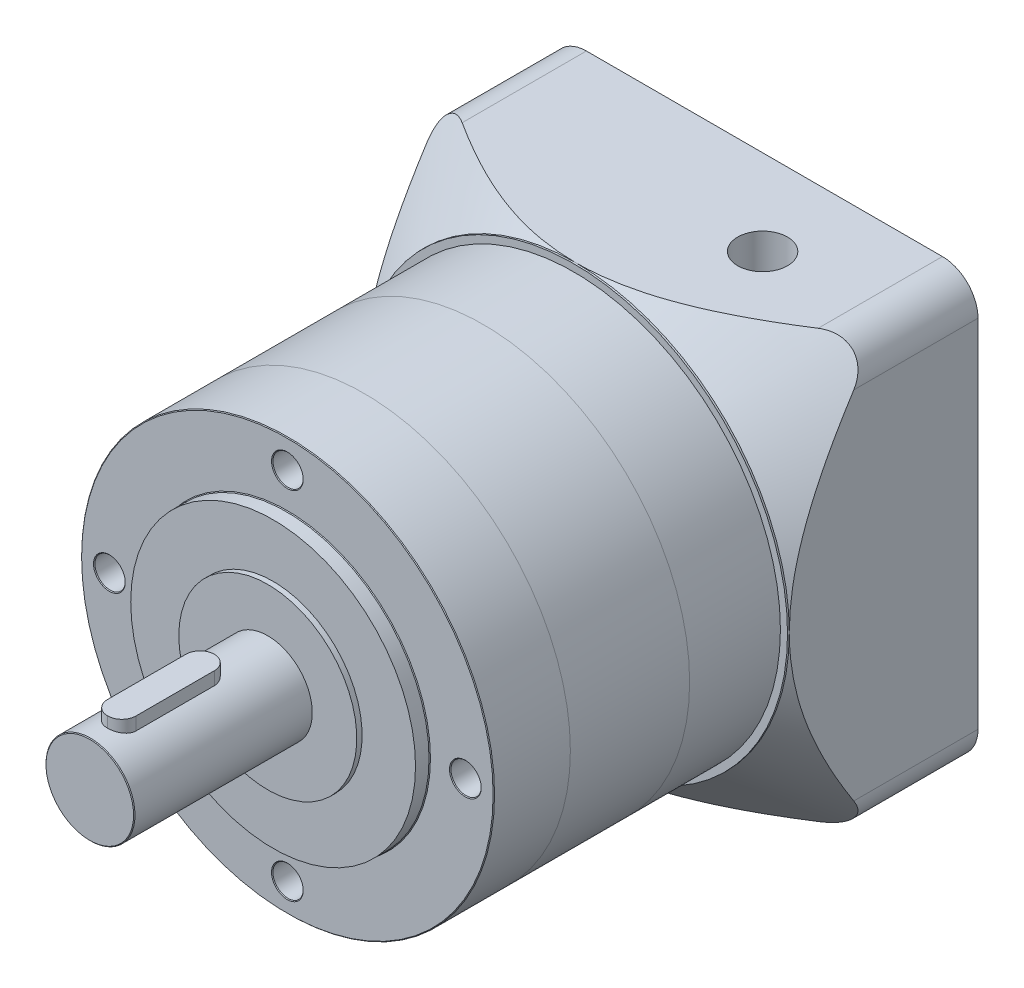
ISO-10303-21;
HEADER;
FILE_DESCRIPTION(('STEP AP214'),'2;1');
FILE_NAME('part.step','',(''),(''),'','','');
FILE_SCHEMA(('AUTOMOTIVE_DESIGN { 1 0 10303 214 1 1 1 1 }'));
ENDSEC;
DATA;
#1=APPLICATION_CONTEXT('core data for automotive mechanical design processes');
#2=APPLICATION_PROTOCOL_DEFINITION('international standard','automotive_design',2000,#1);
#3=PRODUCT_CONTEXT('',#1,'mechanical');
#4=PRODUCT('Part','Part','',(#3));
#5=PRODUCT_RELATED_PRODUCT_CATEGORY('part','',(#4));
#6=PRODUCT_DEFINITION_FORMATION('','',#4);
#7=PRODUCT_DEFINITION_CONTEXT('part definition',#1,'design');
#8=PRODUCT_DEFINITION('design','',#6,#7);
#9=PRODUCT_DEFINITION_SHAPE('','',#8);
#10=(LENGTH_UNIT() NAMED_UNIT(*) SI_UNIT(.MILLI.,.METRE.));
#11=(NAMED_UNIT(*) PLANE_ANGLE_UNIT() SI_UNIT($,.RADIAN.));
#12=(NAMED_UNIT(*) SI_UNIT($,.STERADIAN.) SOLID_ANGLE_UNIT());
#13=UNCERTAINTY_MEASURE_WITH_UNIT(LENGTH_MEASURE(1.E-05),#10,'distance_accuracy_value','');
#14=(GEOMETRIC_REPRESENTATION_CONTEXT(3) GLOBAL_UNCERTAINTY_ASSIGNED_CONTEXT((#13)) GLOBAL_UNIT_ASSIGNED_CONTEXT((#10,
#11,#12)) REPRESENTATION_CONTEXT('',''));
#15=CARTESIAN_POINT('',(0.,0.,0.));
#16=DIRECTION('',(0.,0.,1.));
#17=DIRECTION('',(1.,0.,0.));
#18=AXIS2_PLACEMENT_3D('',#15,#16,#17);
#19=CARTESIAN_POINT('',(40.1259505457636,-22.1506662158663,170.370553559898));
#20=DIRECTION('',(0.,0.,-1.));
#21=DIRECTION('',(-1.,0.,0.));
#22=AXIS2_PLACEMENT_3D('',#19,#20,#21);
#23=CYLINDRICAL_SURFACE('',#22,12.5);
#24=CARTESIAN_POINT('',(40.1259505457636,-22.1506662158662,309.870553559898));
#25=DIRECTION('',(0.,0.,-1.));
#26=DIRECTION('',(-1.,0.,0.));
#27=AXIS2_PLACEMENT_3D('',#24,#25,#26);
#28=CIRCLE('',#27,12.5);
#29=CARTESIAN_POINT('',(27.6259505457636,-22.1506662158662,309.870553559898));
#30=VERTEX_POINT('',#29);
#31=EDGE_CURVE('E154',#30,#30,#28,.T.);
#32=ORIENTED_EDGE('',*,*,#31,.F.);
#33=EDGE_LOOP('',(#32));
#34=FACE_BOUND('',#33,.T.);
#35=CARTESIAN_POINT('',(40.1259505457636,-22.1506662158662,359.670553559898));
#36=DIRECTION('',(0.,0.,1.));
#37=DIRECTION('',(1.,0.,0.));
#38=AXIS2_PLACEMENT_3D('',#35,#36,#37);
#39=CIRCLE('',#38,12.5);
#40=CARTESIAN_POINT('',(52.6259505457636,-22.1506662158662,359.670553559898));
#41=VERTEX_POINT('',#40);
#42=EDGE_CURVE('E196',#41,#41,#39,.F.);
#43=ORIENTED_EDGE('',*,*,#42,.T.);
#44=EDGE_LOOP('',(#43));
#45=FACE_BOUND('',#44,.T.);
#46=CARTESIAN_POINT('',(36.1259505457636,-10.3079469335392,328.870553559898));
#47=CARTESIAN_POINT('',(36.1259364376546,-10.3079634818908,328.761149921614));
#48=CARTESIAN_POINT('',(36.1304386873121,-10.3064313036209,328.651755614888));
#49=CARTESIAN_POINT('',(36.1483660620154,-10.300392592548,328.43380994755));
#50=CARTESIAN_POINT('',(36.161788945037,-10.2958868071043,328.325258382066));
#51=CARTESIAN_POINT('',(36.1973970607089,-10.2840407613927,328.110073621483));
#52=CARTESIAN_POINT('',(36.2195572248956,-10.2767086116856,328.00343584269));
#53=CARTESIAN_POINT('',(36.2724169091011,-10.2594490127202,327.792540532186));
#54=CARTESIAN_POINT('',(36.3031167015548,-10.2495214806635,327.688283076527));
#55=CARTESIAN_POINT('',(36.4076316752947,-10.2162825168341,327.380252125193));
#56=CARTESIAN_POINT('',(36.493912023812,-10.1894971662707,327.180923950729));
#57=CARTESIAN_POINT('',(36.6969963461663,-10.1297089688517,326.799547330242));
#58=CARTESIAN_POINT('',(36.8138182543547,-10.0967024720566,326.617509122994));
#59=CARTESIAN_POINT('',(37.0791635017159,-10.0268682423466,326.269301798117));
#60=CARTESIAN_POINT('',(37.2285926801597,-9.98995125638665,326.103839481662));
#61=CARTESIAN_POINT('',(37.5529827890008,-9.91721102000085,325.799842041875));
#62=CARTESIAN_POINT('',(37.7279487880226,-9.88138798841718,325.661312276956));
#63=CARTESIAN_POINT('',(38.1036359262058,-9.81383093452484,325.411899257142));
#64=CARTESIAN_POINT('',(38.3048769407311,-9.7822165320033,325.301764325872));
#65=CARTESIAN_POINT('',(38.7241322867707,-9.72772690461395,325.117255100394));
#66=CARTESIAN_POINT('',(38.9421311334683,-9.70484372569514,325.042848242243));
#67=CARTESIAN_POINT('',(39.3219647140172,-9.6755542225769,324.948854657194));
#68=CARTESIAN_POINT('',(39.4812233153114,-9.6662717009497,324.919545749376));
#69=CARTESIAN_POINT('',(39.7219935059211,-9.65693653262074,324.890181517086));
#70=CARTESIAN_POINT('',(39.8025722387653,-9.65458957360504,324.882826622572));
#71=CARTESIAN_POINT('',(39.9640786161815,-9.65145265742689,324.873010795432));
#72=CARTESIAN_POINT('',(40.0450063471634,-9.65066311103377,324.870551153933));
#73=CARTESIAN_POINT('',(40.1259505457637,-9.65066621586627,324.870553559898));
#74=B_SPLINE_CURVE_WITH_KNOTS('',3,(#46,#47,#48,#49,#50,#51,#52,#53,#54,#55,#56,#57,#58,#59,#60,
#61,#62,#63,#64,#65,#66,#67,#68,#69,#70,#71,#72,#73),.UNSPECIFIED.,.F.,.F.,(4,2,2,2,2,2,2,2,2,2,
2,2,2,4),(0.,0.3280917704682,0.656101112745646,0.983176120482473,1.31026156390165,
1.96354160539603,2.61720612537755,3.2920858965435,3.9670998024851,4.6584126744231,
5.34909425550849,5.83438547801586,6.0770804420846,6.31983940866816),.UNSPECIFIED.);
#75=CARTESIAN_POINT('',(36.1259505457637,-10.3079469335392,328.870553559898));
#76=VERTEX_POINT('',#75);
#77=CARTESIAN_POINT('',(40.1259505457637,-9.65066621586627,324.870553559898));
#78=VERTEX_POINT('',#77);
#79=EDGE_CURVE('E78',#76,#78,#74,.T.);
#80=ORIENTED_EDGE('',*,*,#79,.T.);
#81=CARTESIAN_POINT('',(40.1259505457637,-9.65066621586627,324.870553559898));
#82=CARTESIAN_POINT('',(40.2354993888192,-9.65065269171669,324.870539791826));
#83=CARTESIAN_POINT('',(40.3450397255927,-9.65210601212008,324.875053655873));
#84=CARTESIAN_POINT('',(40.5632858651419,-9.65784576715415,324.893029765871));
#85=CARTESIAN_POINT('',(40.6719918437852,-9.66213158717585,324.906490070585));
#86=CARTESIAN_POINT('',(40.8875148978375,-9.67342091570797,324.942205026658));
#87=CARTESIAN_POINT('',(40.9943362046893,-9.68041721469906,324.964436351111));
#88=CARTESIAN_POINT('',(41.2056013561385,-9.69692769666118,325.017472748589));
#89=CARTESIAN_POINT('',(41.3100451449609,-9.70644193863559,325.04827802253));
#90=CARTESIAN_POINT('',(41.6186630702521,-9.73839844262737,325.153175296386));
#91=CARTESIAN_POINT('',(41.8183865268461,-9.76426914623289,325.239792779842));
#92=CARTESIAN_POINT('',(42.2004238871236,-9.82248470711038,325.443666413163));
#93=CARTESIAN_POINT('',(42.3827292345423,-9.85483272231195,325.560937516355));
#94=CARTESIAN_POINT('',(42.7306702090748,-9.92373765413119,325.826755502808));
#95=CARTESIAN_POINT('',(42.8956737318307,-9.96038902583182,325.976106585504));
#96=CARTESIAN_POINT('',(43.1987767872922,-10.0332364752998,326.300147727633));
#97=CARTESIAN_POINT('',(43.3368686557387,-10.0694324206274,326.474844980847));
#98=CARTESIAN_POINT('',(43.5857804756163,-10.1383088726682,326.850250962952));
#99=CARTESIAN_POINT('',(43.6957823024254,-10.1708710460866,327.05152556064));
#100=CARTESIAN_POINT('',(43.8800304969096,-10.2273168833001,327.470836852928));
#101=CARTESIAN_POINT('',(43.9543129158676,-10.2512092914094,327.688856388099));
#102=CARTESIAN_POINT('',(44.0479989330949,-10.2818358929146,328.068358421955));
#103=CARTESIAN_POINT('',(44.0771727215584,-10.2915650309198,328.22723773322));
#104=CARTESIAN_POINT('',(44.1064063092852,-10.3013594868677,328.467457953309));
#105=CARTESIAN_POINT('',(44.1137296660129,-10.3038244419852,328.547863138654));
#106=CARTESIAN_POINT('',(44.1235036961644,-10.3071203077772,328.709024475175));
#107=CARTESIAN_POINT('',(44.1259530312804,-10.3079507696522,328.789780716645));
#108=CARTESIAN_POINT('',(44.1259505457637,-10.3079469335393,328.870553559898));
#109=B_SPLINE_CURVE_WITH_KNOTS('',3,(#81,#82,#83,#84,#85,#86,#87,#88,#89,#90,#91,#92,#93,#94,
#95,#96,#97,#98,#99,#100,#101,#102,#103,#104,#105,#106,#107,#108),.UNSPECIFIED.,.F.,.F.,(4,2,2,
2,2,2,2,2,2,2,2,2,2,4),(0.,0.328529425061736,0.656987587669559,0.98457802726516,
1.31217614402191,1.96658196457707,2.62130761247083,3.29490875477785,3.96870145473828,
4.66031934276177,5.35123771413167,5.83541629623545,6.0775943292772,6.31983885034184),.UNSPECIFIED.);
#110=CARTESIAN_POINT('',(44.1259505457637,-10.3079469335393,328.870553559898));
#111=VERTEX_POINT('',#110);
#112=EDGE_CURVE('E232',#78,#111,#109,.T.);
#113=ORIENTED_EDGE('',*,*,#112,.T.);
#114=DIRECTION('',(0.,0.,-1.));
#115=VECTOR('',#114,1.);
#116=CARTESIAN_POINT('',(44.1259505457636,-10.3079469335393,170.370553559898));
#117=LINE('',#116,#115);
#118=CARTESIAN_POINT('',(44.1259505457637,-10.3079469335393,350.870553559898));
#119=VERTEX_POINT('',#118);
#120=EDGE_CURVE('E202',#119,#111,#117,.T.);
#121=ORIENTED_EDGE('',*,*,#120,.F.);
#122=CARTESIAN_POINT('',(44.1259505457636,-10.3079469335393,350.870553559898));
#123=CARTESIAN_POINT('',(44.1259646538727,-10.3079634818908,350.979957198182));
#124=CARTESIAN_POINT('',(44.1214624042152,-10.3064313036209,351.089351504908));
#125=CARTESIAN_POINT('',(44.1035350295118,-10.300392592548,351.307297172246));
#126=CARTESIAN_POINT('',(44.0901121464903,-10.2958868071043,351.41584873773));
#127=CARTESIAN_POINT('',(44.0545040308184,-10.2840407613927,351.631033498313));
#128=CARTESIAN_POINT('',(44.0323438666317,-10.2767086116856,351.737671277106));
#129=CARTESIAN_POINT('',(43.9794841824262,-10.2594490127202,351.94856658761));
#130=CARTESIAN_POINT('',(43.9487843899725,-10.2495214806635,352.052824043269));
#131=CARTESIAN_POINT('',(43.8442694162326,-10.2162825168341,352.360854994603));
#132=CARTESIAN_POINT('',(43.7579890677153,-10.1894971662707,352.560183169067));
#133=CARTESIAN_POINT('',(43.554904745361,-10.1297089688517,352.941559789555));
#134=CARTESIAN_POINT('',(43.4380828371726,-10.0967024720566,353.123597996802));
#135=CARTESIAN_POINT('',(43.1727375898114,-10.0268682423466,353.471805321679));
#136=CARTESIAN_POINT('',(43.0233084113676,-9.98995125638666,353.637267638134));
#137=CARTESIAN_POINT('',(42.6989183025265,-9.91721102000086,353.941265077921));
#138=CARTESIAN_POINT('',(42.5239523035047,-9.88138798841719,354.07979484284));
#139=CARTESIAN_POINT('',(42.1482651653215,-9.81383093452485,354.329207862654));
#140=CARTESIAN_POINT('',(41.9470241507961,-9.7822165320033,354.439342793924));
#141=CARTESIAN_POINT('',(41.5277688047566,-9.72772690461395,354.623852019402));
#142=CARTESIAN_POINT('',(41.309769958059,-9.70484372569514,354.698258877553));
#143=CARTESIAN_POINT('',(40.9299363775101,-9.6755542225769,354.792252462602));
#144=CARTESIAN_POINT('',(40.7706777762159,-9.6662717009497,354.82156137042));
#145=CARTESIAN_POINT('',(40.5299075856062,-9.65693653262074,354.85092560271));
#146=CARTESIAN_POINT('',(40.4493288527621,-9.65458957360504,354.858280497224));
#147=CARTESIAN_POINT('',(40.2878224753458,-9.65145265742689,354.868096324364));
#148=CARTESIAN_POINT('',(40.2068947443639,-9.65066311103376,354.870555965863));
#149=CARTESIAN_POINT('',(40.1259505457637,-9.65066621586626,354.870553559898));
#150=B_SPLINE_CURVE_WITH_KNOTS('',3,(#122,#123,#124,#125,#126,#127,#128,#129,#130,#131,#132,
#133,#134,#135,#136,#137,#138,#139,#140,#141,#142,#143,#144,#145,#146,#147,#148,#149),
.UNSPECIFIED.,.F.,.F.,(4,2,2,2,2,2,2,2,2,2,2,2,2,4),(0.,0.328091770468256,0.656101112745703,
0.983176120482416,1.31026156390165,1.9635416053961,2.61720612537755,3.2920858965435,
3.9670998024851,4.65841267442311,5.34909425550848,5.83438547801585,6.0770804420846,
6.31983940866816),.UNSPECIFIED.);
#151=CARTESIAN_POINT('',(40.1259505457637,-9.65066621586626,354.870553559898));
#152=VERTEX_POINT('',#151);
#153=EDGE_CURVE('E13',#119,#152,#150,.T.);
#154=ORIENTED_EDGE('',*,*,#153,.T.);
#155=CARTESIAN_POINT('',(40.1259505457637,-9.65066621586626,354.870553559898));
#156=CARTESIAN_POINT('',(40.0164017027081,-9.65065269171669,354.87056732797));
#157=CARTESIAN_POINT('',(39.9068613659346,-9.65210601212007,354.866053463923));
#158=CARTESIAN_POINT('',(39.6886152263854,-9.65784576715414,354.848077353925));
#159=CARTESIAN_POINT('',(39.5799092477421,-9.66213158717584,354.834617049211));
#160=CARTESIAN_POINT('',(39.3643861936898,-9.67342091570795,354.798902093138));
#161=CARTESIAN_POINT('',(39.257564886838,-9.68041721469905,354.776670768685));
#162=CARTESIAN_POINT('',(39.0462997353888,-9.69692769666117,354.723634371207));
#163=CARTESIAN_POINT('',(38.9418559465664,-9.70644193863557,354.692829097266));
#164=CARTESIAN_POINT('',(38.6332380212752,-9.73839844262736,354.58793182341));
#165=CARTESIAN_POINT('',(38.4335145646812,-9.76426914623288,354.501314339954));
#166=CARTESIAN_POINT('',(38.0514772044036,-9.82248470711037,354.297440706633));
#167=CARTESIAN_POINT('',(37.869171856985,-9.85483272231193,354.180169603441));
#168=CARTESIAN_POINT('',(37.5212308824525,-9.92373765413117,353.914351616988));
#169=CARTESIAN_POINT('',(37.3562273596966,-9.9603890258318,353.765000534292));
#170=CARTESIAN_POINT('',(37.0531243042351,-10.0332364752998,353.440959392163));
#171=CARTESIAN_POINT('',(36.9150324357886,-10.0694324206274,353.266262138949));
#172=CARTESIAN_POINT('',(36.666120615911,-10.1383088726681,352.890856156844));
#173=CARTESIAN_POINT('',(36.5561187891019,-10.1708710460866,352.689581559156));
#174=CARTESIAN_POINT('',(36.3718705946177,-10.2273168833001,352.270270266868));
#175=CARTESIAN_POINT('',(36.2975881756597,-10.2512092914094,352.052250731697));
#176=CARTESIAN_POINT('',(36.2039021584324,-10.2818358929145,351.672748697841));
#177=CARTESIAN_POINT('',(36.1747283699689,-10.2915650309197,351.513869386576));
#178=CARTESIAN_POINT('',(36.1454947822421,-10.3013594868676,351.273649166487));
#179=CARTESIAN_POINT('',(36.1381714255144,-10.3038244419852,351.193243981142));
#180=CARTESIAN_POINT('',(36.1283973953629,-10.3071203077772,351.032082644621));
#181=CARTESIAN_POINT('',(36.1259480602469,-10.3079507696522,350.951326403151));
#182=CARTESIAN_POINT('',(36.1259505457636,-10.3079469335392,350.870553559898));
#183=B_SPLINE_CURVE_WITH_KNOTS('',3,(#155,#156,#157,#158,#159,#160,#161,#162,#163,#164,#165,
#166,#167,#168,#169,#170,#171,#172,#173,#174,#175,#176,#177,#178,#179,#180,#181,#182),
.UNSPECIFIED.,.F.,.F.,(4,2,2,2,2,2,2,2,2,2,2,2,2,4),(0.,0.328529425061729,0.656987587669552,
0.98457802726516,1.31217614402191,1.96658196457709,2.62130761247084,3.2949087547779,
3.96870145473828,4.66031934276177,5.35123771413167,5.83541629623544,6.0775943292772,
6.31983885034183),.UNSPECIFIED.);
#184=CARTESIAN_POINT('',(36.1259505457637,-10.3079469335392,350.870553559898));
#185=VERTEX_POINT('',#184);
#186=EDGE_CURVE('E65',#152,#185,#183,.T.);
#187=ORIENTED_EDGE('',*,*,#186,.T.);
#188=DIRECTION('',(0.,0.,-1.));
#189=VECTOR('',#188,1.);
#190=CARTESIAN_POINT('',(36.1259505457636,-10.3079469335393,170.370553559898));
#191=LINE('',#190,#189);
#192=EDGE_CURVE('E205',#76,#185,#191,.F.);
#193=ORIENTED_EDGE('',*,*,#192,.F.);
#194=EDGE_LOOP('',(#80,#113,#121,#154,#187,#193));
#195=FACE_BOUND('',#194,.T.);
#196=ADVANCED_FACE('F55',(#34,#45,#195),#23,.T.);
#197=CARTESIAN_POINT('',(31.1383083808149,-31.1383083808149,304.370553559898));
#198=DIRECTION('',(0.,0.,1.));
#199=DIRECTION('',(1.,0.,0.));
#200=AXIS2_PLACEMENT_3D('',#197,#198,#199);
#201=PLANE('',#200);
#202=CARTESIAN_POINT('',(40.1259505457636,-22.1506662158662,304.370553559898));
#203=DIRECTION('',(0.,0.,1.));
#204=DIRECTION('',(1.,0.,0.));
#205=AXIS2_PLACEMENT_3D('',#202,#203,#204);
#206=CIRCLE('',#205,57.8000000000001);
#207=CARTESIAN_POINT('',(97.9259505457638,-22.1506662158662,304.370553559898));
#208=VERTEX_POINT('',#207);
#209=EDGE_CURVE('E178',#208,#208,#206,.T.);
#210=ORIENTED_EDGE('',*,*,#209,.T.);
#211=EDGE_LOOP('',(#210));
#212=FACE_BOUND('',#211,.T.);
#213=CARTESIAN_POINT('',(40.1259505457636,-22.1506662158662,304.370553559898));
#214=DIRECTION('',(0.,0.,1.));
#215=DIRECTION('',(1.,0.,0.));
#216=AXIS2_PLACEMENT_3D('',#213,#214,#215);
#217=CIRCLE('',#216,40.2);
#218=CARTESIAN_POINT('',(80.3259505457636,-22.1506662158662,304.370553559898));
#219=VERTEX_POINT('',#218);
#220=EDGE_CURVE('E175',#219,#219,#217,.F.);
#221=ORIENTED_EDGE('',*,*,#220,.T.);
#222=EDGE_LOOP('',(#221));
#223=FACE_BOUND('',#222,.T.);
#224=CARTESIAN_POINT('',(40.1259505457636,27.8493337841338,304.370553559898));
#225=DIRECTION('',(0.,0.,1.));
#226=DIRECTION('',(1.,0.,0.));
#227=AXIS2_PLACEMENT_3D('',#224,#225,#226);
#228=CIRCLE('',#227,4.44999999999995);
#229=CARTESIAN_POINT('',(44.5759505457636,27.8493337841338,304.370553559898));
#230=VERTEX_POINT('',#229);
#231=EDGE_CURVE('E172',#230,#230,#228,.F.);
#232=ORIENTED_EDGE('',*,*,#231,.T.);
#233=EDGE_LOOP('',(#232));
#234=FACE_BOUND('',#233,.T.);
#235=CARTESIAN_POINT('',(90.1259505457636,-22.1506662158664,304.370553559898));
#236=DIRECTION('',(0.,0.,1.));
#237=DIRECTION('',(1.,0.,0.));
#238=AXIS2_PLACEMENT_3D('',#235,#236,#237);
#239=CIRCLE('',#238,4.44999999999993);
#240=CARTESIAN_POINT('',(94.5759505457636,-22.1506662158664,304.370553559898));
#241=VERTEX_POINT('',#240);
#242=EDGE_CURVE('E169',#241,#241,#239,.F.);
#243=ORIENTED_EDGE('',*,*,#242,.T.);
#244=EDGE_LOOP('',(#243));
#245=FACE_BOUND('',#244,.T.);
#246=CARTESIAN_POINT('',(40.1259505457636,-72.1506662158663,304.370553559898));
#247=DIRECTION('',(0.,0.,1.));
#248=DIRECTION('',(1.,0.,0.));
#249=AXIS2_PLACEMENT_3D('',#246,#247,#248);
#250=CIRCLE('',#249,4.44999999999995);
#251=CARTESIAN_POINT('',(44.5759505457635,-72.1506662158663,304.370553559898));
#252=VERTEX_POINT('',#251);
#253=EDGE_CURVE('E166',#252,#252,#250,.F.);
#254=ORIENTED_EDGE('',*,*,#253,.T.);
#255=EDGE_LOOP('',(#254));
#256=FACE_BOUND('',#255,.T.);
#257=CARTESIAN_POINT('',(-9.87404945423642,-22.1506662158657,304.370553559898));
#258=DIRECTION('',(0.,0.,1.));
#259=DIRECTION('',(1.,0.,0.));
#260=AXIS2_PLACEMENT_3D('',#257,#258,#259);
#261=CIRCLE('',#260,4.44999999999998);
#262=CARTESIAN_POINT('',(-5.42404945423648,-22.1506662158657,304.370553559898));
#263=VERTEX_POINT('',#262);
#264=EDGE_CURVE('E163',#263,#263,#261,.F.);
#265=ORIENTED_EDGE('',*,*,#264,.T.);
#266=EDGE_LOOP('',(#265));
#267=FACE_BOUND('',#266,.T.);
#268=ADVANCED_FACE('F245',(#212,#223,#234,#245,#256,#267),#201,.T.);
#269=CARTESIAN_POINT('',(40.1259505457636,-22.1506662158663,170.370553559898));
#270=DIRECTION('',(0.,0.,-1.));
#271=DIRECTION('',(-1.,0.,0.));
#272=AXIS2_PLACEMENT_3D('',#269,#270,#271);
#273=CYLINDRICAL_SURFACE('',#272,58.);
#274=CARTESIAN_POINT('',(40.1259505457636,-22.1506662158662,304.170553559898));
#275=DIRECTION('',(0.,0.,1.));
#276=DIRECTION('',(1.,0.,0.));
#277=AXIS2_PLACEMENT_3D('',#274,#275,#276);
#278=CIRCLE('',#277,58.);
#279=CARTESIAN_POINT('',(98.1259505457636,-22.1506662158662,304.170553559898));
#280=VERTEX_POINT('',#279);
#281=EDGE_CURVE('E160',#280,#280,#278,.F.);
#282=ORIENTED_EDGE('',*,*,#281,.T.);
#283=EDGE_LOOP('',(#282));
#284=FACE_BOUND('',#283,.T.);
#285=CARTESIAN_POINT('',(40.1259505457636,-22.1506662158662,282.870553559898));
#286=DIRECTION('',(0.,0.,-1.));
#287=DIRECTION('',(-1.,0.,0.));
#288=AXIS2_PLACEMENT_3D('',#285,#286,#287);
#289=CIRCLE('',#288,58.);
#290=CARTESIAN_POINT('',(-17.8740494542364,-22.1506662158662,282.870553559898));
#291=VERTEX_POINT('',#290);
#292=EDGE_CURVE('E157',#291,#291,#289,.T.);
#293=ORIENTED_EDGE('',*,*,#292,.F.);
#294=EDGE_LOOP('',(#293));
#295=FACE_BOUND('',#294,.T.);
#296=ADVANCED_FACE('F521',(#284,#295),#273,.T.);
#297=CARTESIAN_POINT('',(31.1383083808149,-31.1383083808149,282.870553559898));
#298=DIRECTION('',(0.,0.,-1.));
#299=DIRECTION('',(-1.,0.,0.));
#300=AXIS2_PLACEMENT_3D('',#297,#298,#299);
#301=PLANE('',#300);
#302=ORIENTED_EDGE('',*,*,#292,.T.);
#303=EDGE_LOOP('',(#302));
#304=FACE_BOUND('',#303,.T.);
#305=ADVANCED_FACE('F513',(#304),#301,.T.);
#306=CARTESIAN_POINT('',(31.1383083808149,-31.1383083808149,359.870553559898));
#307=DIRECTION('',(0.,0.,1.));
#308=DIRECTION('',(1.,0.,0.));
#309=AXIS2_PLACEMENT_3D('',#306,#307,#308);
#310=PLANE('',#309);
#311=CARTESIAN_POINT('',(40.1259505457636,-22.1506662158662,359.870553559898));
#312=DIRECTION('',(0.,0.,1.));
#313=DIRECTION('',(1.,0.,0.));
#314=AXIS2_PLACEMENT_3D('',#311,#312,#313);
#315=CIRCLE('',#314,12.2999999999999);
#316=CARTESIAN_POINT('',(52.4259505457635,-22.1506662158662,359.870553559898));
#317=VERTEX_POINT('',#316);
#318=EDGE_CURVE('E199',#317,#317,#315,.T.);
#319=ORIENTED_EDGE('',*,*,#318,.T.);
#320=EDGE_LOOP('',(#319));
#321=FACE_BOUND('',#320,.T.);
#322=ADVANCED_FACE('F249',(#321),#310,.T.);
#323=CARTESIAN_POINT('',(31.1383083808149,-31.1383083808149,309.870553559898));
#324=DIRECTION('',(0.,0.,1.));
#325=DIRECTION('',(1.,0.,0.));
#326=AXIS2_PLACEMENT_3D('',#323,#324,#325);
#327=PLANE('',#326);
#328=ORIENTED_EDGE('',*,*,#31,.T.);
#329=EDGE_LOOP('',(#328));
#330=FACE_BOUND('',#329,.T.);
#331=CARTESIAN_POINT('',(40.1259505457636,-22.1506662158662,309.870553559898));
#332=DIRECTION('',(0.,0.,-1.));
#333=DIRECTION('',(-1.,0.,0.));
#334=AXIS2_PLACEMENT_3D('',#331,#332,#333);
#335=CIRCLE('',#334,25.);
#336=CARTESIAN_POINT('',(15.1259505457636,-22.1506662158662,309.870553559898));
#337=VERTEX_POINT('',#336);
#338=EDGE_CURVE('E151',#337,#337,#335,.T.);
#339=ORIENTED_EDGE('',*,*,#338,.F.);
#340=EDGE_LOOP('',(#339));
#341=FACE_BOUND('',#340,.T.);
#342=ADVANCED_FACE('F247',(#330,#341),#327,.T.);
#343=CARTESIAN_POINT('',(40.1259505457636,-22.1506662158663,170.370553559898));
#344=DIRECTION('',(0.,0.,-1.));
#345=DIRECTION('',(-1.,0.,0.));
#346=AXIS2_PLACEMENT_3D('',#343,#344,#345);
#347=CYLINDRICAL_SURFACE('',#346,25.);
#348=ORIENTED_EDGE('',*,*,#338,.T.);
#349=EDGE_LOOP('',(#348));
#350=FACE_BOUND('',#349,.T.);
#351=CARTESIAN_POINT('',(40.1259505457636,-22.1506662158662,308.370553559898));
#352=DIRECTION('',(0.,0.,-1.));
#353=DIRECTION('',(-1.,0.,0.));
#354=AXIS2_PLACEMENT_3D('',#351,#352,#353);
#355=CIRCLE('',#354,25.);
#356=CARTESIAN_POINT('',(15.1259505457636,-22.1506662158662,308.370553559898));
#357=VERTEX_POINT('',#356);
#358=EDGE_CURVE('E148',#357,#357,#355,.T.);
#359=ORIENTED_EDGE('',*,*,#358,.F.);
#360=EDGE_LOOP('',(#359));
#361=FACE_BOUND('',#360,.T.);
#362=ADVANCED_FACE('F490',(#350,#361),#347,.T.);
#363=CARTESIAN_POINT('',(31.1383083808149,-31.1383083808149,308.370553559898));
#364=DIRECTION('',(0.,0.,1.));
#365=DIRECTION('',(1.,0.,0.));
#366=AXIS2_PLACEMENT_3D('',#363,#364,#365);
#367=PLANE('',#366);
#368=ORIENTED_EDGE('',*,*,#358,.T.);
#369=EDGE_LOOP('',(#368));
#370=FACE_BOUND('',#369,.T.);
#371=CARTESIAN_POINT('',(40.1259505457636,-22.1506662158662,308.370553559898));
#372=DIRECTION('',(0.,0.,-1.));
#373=DIRECTION('',(-1.,0.,0.));
#374=AXIS2_PLACEMENT_3D('',#371,#372,#373);
#375=CIRCLE('',#374,40.);
#376=CARTESIAN_POINT('',(0.125950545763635,-22.1506662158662,308.370553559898));
#377=VERTEX_POINT('',#376);
#378=EDGE_CURVE('E145',#377,#377,#375,.T.);
#379=ORIENTED_EDGE('',*,*,#378,.F.);
#380=EDGE_LOOP('',(#379));
#381=FACE_BOUND('',#380,.T.);
#382=ADVANCED_FACE('F481',(#370,#381),#367,.T.);
#383=CARTESIAN_POINT('',(40.1259505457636,-22.1506662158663,170.370553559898));
#384=DIRECTION('',(0.,0.,-1.));
#385=DIRECTION('',(-1.,0.,0.));
#386=AXIS2_PLACEMENT_3D('',#383,#384,#385);
#387=CYLINDRICAL_SURFACE('',#386,40.);
#388=CARTESIAN_POINT('',(40.1259505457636,-22.1506662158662,304.570553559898));
#389=DIRECTION('',(0.,0.,1.));
#390=DIRECTION('',(1.,0.,0.));
#391=AXIS2_PLACEMENT_3D('',#388,#389,#390);
#392=CIRCLE('',#391,40.);
#393=CARTESIAN_POINT('',(80.1259505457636,-22.1506662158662,304.570553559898));
#394=VERTEX_POINT('',#393);
#395=EDGE_CURVE('E181',#394,#394,#392,.T.);
#396=ORIENTED_EDGE('',*,*,#395,.T.);
#397=EDGE_LOOP('',(#396));
#398=FACE_BOUND('',#397,.T.);
#399=ORIENTED_EDGE('',*,*,#378,.T.);
#400=EDGE_LOOP('',(#399));
#401=FACE_BOUND('',#400,.T.);
#402=ADVANCED_FACE('F472',(#398,#401),#387,.T.);
#403=CARTESIAN_POINT('',(40.1259505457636,27.8493337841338,289.870553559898));
#404=DIRECTION('',(0.,0.,1.));
#405=DIRECTION('',(1.,0.,0.));
#406=AXIS2_PLACEMENT_3D('',#403,#404,#405);
#407=CONICAL_SURFACE('',#406,4.25,1.02974425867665);
#408=CARTESIAN_POINT('',(40.1259505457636,27.8493337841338,287.316895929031));
#409=VERTEX_POINT('',#408);
#410=VERTEX_LOOP('',#409);
#411=FACE_BOUND('',#410,.T.);
#412=CARTESIAN_POINT('',(40.1259505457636,27.8493337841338,289.870553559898));
#413=DIRECTION('',(0.,0.,1.));
#414=DIRECTION('',(1.,0.,0.));
#415=AXIS2_PLACEMENT_3D('',#412,#413,#414);
#416=CIRCLE('',#415,4.25);
#417=CARTESIAN_POINT('',(44.3759505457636,27.8493337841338,289.870553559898));
#418=VERTEX_POINT('',#417);
#419=EDGE_CURVE('E142',#418,#418,#416,.T.);
#420=ORIENTED_EDGE('',*,*,#419,.T.);
#421=EDGE_LOOP('',(#420));
#422=FACE_BOUND('',#421,.T.);
#423=ADVANCED_FACE('F462',(#411,#422),#407,.F.);
#424=CARTESIAN_POINT('',(40.1259505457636,27.8493337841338,304.370553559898));
#425=DIRECTION('',(0.,0.,1.));
#426=DIRECTION('',(1.,0.,0.));
#427=AXIS2_PLACEMENT_3D('',#424,#425,#426);
#428=CYLINDRICAL_SURFACE('',#427,4.24999999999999);
#429=CARTESIAN_POINT('',(40.1259505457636,27.8493337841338,304.170553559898));
#430=DIRECTION('',(0.,0.,1.));
#431=DIRECTION('',(1.,0.,0.));
#432=AXIS2_PLACEMENT_3D('',#429,#430,#431);
#433=CIRCLE('',#432,4.24999999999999);
#434=CARTESIAN_POINT('',(44.3759505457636,27.8493337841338,304.170553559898));
#435=VERTEX_POINT('',#434);
#436=EDGE_CURVE('E184',#435,#435,#433,.T.);
#437=ORIENTED_EDGE('',*,*,#436,.T.);
#438=EDGE_LOOP('',(#437));
#439=FACE_BOUND('',#438,.T.);
#440=ORIENTED_EDGE('',*,*,#419,.F.);
#441=EDGE_LOOP('',(#440));
#442=FACE_BOUND('',#441,.T.);
#443=ADVANCED_FACE('F453',(#439,#442),#428,.F.);
#444=CARTESIAN_POINT('',(90.1259505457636,-22.1506662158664,289.870553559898));
#445=DIRECTION('',(0.,0.,1.));
#446=DIRECTION('',(0.,-1.,0.));
#447=AXIS2_PLACEMENT_3D('',#444,#445,#446);
#448=CONICAL_SURFACE('',#447,4.24999999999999,1.02974425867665);
#449=CARTESIAN_POINT('',(90.1259505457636,-22.1506662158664,287.316895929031));
#450=VERTEX_POINT('',#449);
#451=VERTEX_LOOP('',#450);
#452=FACE_BOUND('',#451,.T.);
#453=CARTESIAN_POINT('',(90.1259505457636,-22.1506662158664,289.870553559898));
#454=DIRECTION('',(0.,0.,1.));
#455=DIRECTION('',(0.,-1.,0.));
#456=AXIS2_PLACEMENT_3D('',#453,#454,#455);
#457=CIRCLE('',#456,4.24999999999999);
#458=CARTESIAN_POINT('',(90.1259505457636,-26.4006662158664,289.870553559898));
#459=VERTEX_POINT('',#458);
#460=EDGE_CURVE('E133',#459,#459,#457,.T.);
#461=ORIENTED_EDGE('',*,*,#460,.T.);
#462=EDGE_LOOP('',(#461));
#463=FACE_BOUND('',#462,.T.);
#464=ADVANCED_FACE('F444',(#452,#463),#448,.F.);
#465=CARTESIAN_POINT('',(90.1259505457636,-22.1506662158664,304.370553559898));
#466=DIRECTION('',(0.,0.,1.));
#467=DIRECTION('',(0.,-1.,0.));
#468=AXIS2_PLACEMENT_3D('',#465,#466,#467);
#469=CYLINDRICAL_SURFACE('',#468,4.24999999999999);
#470=CARTESIAN_POINT('',(90.1259505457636,-22.1506662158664,304.170553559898));
#471=DIRECTION('',(0.,0.,1.));
#472=DIRECTION('',(1.,0.,0.));
#473=AXIS2_PLACEMENT_3D('',#470,#471,#472);
#474=CIRCLE('',#473,4.24999999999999);
#475=CARTESIAN_POINT('',(94.3759505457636,-22.1506662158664,304.170553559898));
#476=VERTEX_POINT('',#475);
#477=EDGE_CURVE('E187',#476,#476,#474,.T.);
#478=ORIENTED_EDGE('',*,*,#477,.T.);
#479=EDGE_LOOP('',(#478));
#480=FACE_BOUND('',#479,.T.);
#481=ORIENTED_EDGE('',*,*,#460,.F.);
#482=EDGE_LOOP('',(#481));
#483=FACE_BOUND('',#482,.T.);
#484=ADVANCED_FACE('F435',(#480,#483),#469,.F.);
#485=CARTESIAN_POINT('',(40.1259505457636,-72.1506662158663,289.870553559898));
#486=DIRECTION('',(0.,0.,1.));
#487=DIRECTION('',(0.,-1.,0.));
#488=AXIS2_PLACEMENT_3D('',#485,#486,#487);
#489=CONICAL_SURFACE('',#488,4.25,1.02974425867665);
#490=CARTESIAN_POINT('',(40.1259505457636,-72.1506662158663,287.316895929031));
#491=VERTEX_POINT('',#490);
#492=VERTEX_LOOP('',#491);
#493=FACE_BOUND('',#492,.T.);
#494=CARTESIAN_POINT('',(40.1259505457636,-72.1506662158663,289.870553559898));
#495=DIRECTION('',(0.,0.,1.));
#496=DIRECTION('',(0.,-1.,0.));
#497=AXIS2_PLACEMENT_3D('',#494,#495,#496);
#498=CIRCLE('',#497,4.25);
#499=CARTESIAN_POINT('',(40.1259505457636,-76.4006662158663,289.870553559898));
#500=VERTEX_POINT('',#499);
#501=EDGE_CURVE('E129',#500,#500,#498,.T.);
#502=ORIENTED_EDGE('',*,*,#501,.T.);
#503=EDGE_LOOP('',(#502));
#504=FACE_BOUND('',#503,.T.);
#505=ADVANCED_FACE('F426',(#493,#504),#489,.F.);
#506=CARTESIAN_POINT('',(40.1259505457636,-72.1506662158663,304.370553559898));
#507=DIRECTION('',(0.,0.,1.));
#508=DIRECTION('',(0.,-1.,0.));
#509=AXIS2_PLACEMENT_3D('',#506,#507,#508);
#510=CYLINDRICAL_SURFACE('',#509,4.24999999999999);
#511=CARTESIAN_POINT('',(40.1259505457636,-72.1506662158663,304.170553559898));
#512=DIRECTION('',(0.,0.,1.));
#513=DIRECTION('',(1.,0.,0.));
#514=AXIS2_PLACEMENT_3D('',#511,#512,#513);
#515=CIRCLE('',#514,4.24999999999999);
#516=CARTESIAN_POINT('',(44.3759505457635,-72.1506662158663,304.170553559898));
#517=VERTEX_POINT('',#516);
#518=EDGE_CURVE('E190',#517,#517,#515,.T.);
#519=ORIENTED_EDGE('',*,*,#518,.T.);
#520=EDGE_LOOP('',(#519));
#521=FACE_BOUND('',#520,.T.);
#522=ORIENTED_EDGE('',*,*,#501,.F.);
#523=EDGE_LOOP('',(#522));
#524=FACE_BOUND('',#523,.T.);
#525=ADVANCED_FACE('F123',(#521,#524),#510,.F.);
#526=CARTESIAN_POINT('',(-9.87404945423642,-22.1506662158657,289.870553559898));
#527=DIRECTION('',(0.,0.,1.));
#528=DIRECTION('',(0.,-1.,0.));
#529=AXIS2_PLACEMENT_3D('',#526,#527,#528);
#530=CONICAL_SURFACE('',#529,4.25,1.02974425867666);
#531=CARTESIAN_POINT('',(-9.87404945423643,-22.1506662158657,287.316895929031));
#532=VERTEX_POINT('',#531);
#533=VERTEX_LOOP('',#532);
#534=FACE_BOUND('',#533,.T.);
#535=CARTESIAN_POINT('',(-9.87404945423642,-22.1506662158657,289.870553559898));
#536=DIRECTION('',(0.,0.,1.));
#537=DIRECTION('',(0.,-1.,0.));
#538=AXIS2_PLACEMENT_3D('',#535,#536,#537);
#539=CIRCLE('',#538,4.25);
#540=CARTESIAN_POINT('',(-9.87404945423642,-26.4006662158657,289.870553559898));
#541=VERTEX_POINT('',#540);
#542=EDGE_CURVE('E127',#541,#541,#539,.T.);
#543=ORIENTED_EDGE('',*,*,#542,.T.);
#544=EDGE_LOOP('',(#543));
#545=FACE_BOUND('',#544,.T.);
#546=ADVANCED_FACE('F119',(#534,#545),#530,.F.);
#547=CARTESIAN_POINT('',(-9.87404945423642,-22.1506662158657,304.370553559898));
#548=DIRECTION('',(0.,0.,1.));
#549=DIRECTION('',(0.,-1.,0.));
#550=AXIS2_PLACEMENT_3D('',#547,#548,#549);
#551=CYLINDRICAL_SURFACE('',#550,4.24999999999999);
#552=CARTESIAN_POINT('',(-9.87404945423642,-22.1506662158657,304.170553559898));
#553=DIRECTION('',(0.,0.,1.));
#554=DIRECTION('',(1.,0.,0.));
#555=AXIS2_PLACEMENT_3D('',#552,#553,#554);
#556=CIRCLE('',#555,4.24999999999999);
#557=CARTESIAN_POINT('',(-5.62404945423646,-22.1506662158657,304.170553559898));
#558=VERTEX_POINT('',#557);
#559=EDGE_CURVE('E193',#558,#558,#556,.T.);
#560=ORIENTED_EDGE('',*,*,#559,.T.);
#561=EDGE_LOOP('',(#560));
#562=FACE_BOUND('',#561,.T.);
#563=ORIENTED_EDGE('',*,*,#542,.F.);
#564=EDGE_LOOP('',(#563));
#565=FACE_BOUND('',#564,.T.);
#566=ADVANCED_FACE('F122',(#562,#565),#551,.F.);
#567=CARTESIAN_POINT('',(40.1259505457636,-22.1506662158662,304.170553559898));
#568=DIRECTION('',(0.,0.,-1.));
#569=DIRECTION('',(-1.,0.,0.));
#570=AXIS2_PLACEMENT_3D('',#567,#568,#569);
#571=CONICAL_SURFACE('',#570,58.,0.785398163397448);
#572=ORIENTED_EDGE('',*,*,#209,.F.);
#573=EDGE_LOOP('',(#572));
#574=FACE_BOUND('',#573,.T.);
#575=ORIENTED_EDGE('',*,*,#281,.F.);
#576=EDGE_LOOP('',(#575));
#577=FACE_BOUND('',#576,.T.);
#578=ADVANCED_FACE('F394',(#574,#577),#571,.T.);
#579=CARTESIAN_POINT('',(40.1259505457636,-22.1506662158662,304.370553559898));
#580=DIRECTION('',(0.,0.,-1.));
#581=DIRECTION('',(-1.,0.,0.));
#582=AXIS2_PLACEMENT_3D('',#579,#580,#581);
#583=CONICAL_SURFACE('',#582,40.2,0.785398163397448);
#584=ORIENTED_EDGE('',*,*,#395,.F.);
#585=EDGE_LOOP('',(#584));
#586=FACE_BOUND('',#585,.T.);
#587=ORIENTED_EDGE('',*,*,#220,.F.);
#588=EDGE_LOOP('',(#587));
#589=FACE_BOUND('',#588,.T.);
#590=ADVANCED_FACE('F385',(#586,#589),#583,.T.);
#591=CARTESIAN_POINT('',(40.1259505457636,27.8493337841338,304.170553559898));
#592=DIRECTION('',(0.,0.,1.));
#593=DIRECTION('',(1.,0.,0.));
#594=AXIS2_PLACEMENT_3D('',#591,#592,#593);
#595=CONICAL_SURFACE('',#594,4.24999999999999,0.785398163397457);
#596=CARTESIAN_POINT('',(44.5759505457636,27.8493337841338,304.370553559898));
#597=CARTESIAN_POINT('',(44.5738672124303,27.8493337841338,304.368470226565));
#598=CARTESIAN_POINT('',(44.5717838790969,27.8493337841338,304.366386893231));
#599=CARTESIAN_POINT('',(44.5676172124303,27.8493337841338,304.362220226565));
#600=CARTESIAN_POINT('',(44.5655338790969,27.8493337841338,304.360136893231));
#601=CARTESIAN_POINT('',(44.5613672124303,27.8493337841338,304.355970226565));
#602=CARTESIAN_POINT('',(44.5592838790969,27.8493337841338,304.353886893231));
#603=CARTESIAN_POINT('',(44.5551172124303,27.8493337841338,304.349720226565));
#604=CARTESIAN_POINT('',(44.5530338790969,27.8493337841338,304.347636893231));
#605=CARTESIAN_POINT('',(44.5488672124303,27.8493337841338,304.343470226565));
#606=CARTESIAN_POINT('',(44.5467838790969,27.8493337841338,304.341386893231));
#607=CARTESIAN_POINT('',(44.5426172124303,27.8493337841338,304.337220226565));
#608=CARTESIAN_POINT('',(44.5405338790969,27.8493337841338,304.335136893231));
#609=CARTESIAN_POINT('',(44.5363672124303,27.8493337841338,304.330970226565));
#610=CARTESIAN_POINT('',(44.5342838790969,27.8493337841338,304.328886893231));
#611=CARTESIAN_POINT('',(44.5301172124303,27.8493337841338,304.324720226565));
#612=CARTESIAN_POINT('',(44.5280338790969,27.8493337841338,304.322636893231));
#613=CARTESIAN_POINT('',(44.5238672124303,27.8493337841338,304.318470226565));
#614=CARTESIAN_POINT('',(44.5217838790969,27.8493337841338,304.316386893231));
#615=CARTESIAN_POINT('',(44.5176172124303,27.8493337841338,304.312220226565));
#616=CARTESIAN_POINT('',(44.5155338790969,27.8493337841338,304.310136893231));
#617=CARTESIAN_POINT('',(44.5113672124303,27.8493337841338,304.305970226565));
#618=CARTESIAN_POINT('',(44.5092838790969,27.8493337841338,304.303886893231));
#619=CARTESIAN_POINT('',(44.5051172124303,27.8493337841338,304.299720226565));
#620=CARTESIAN_POINT('',(44.5030338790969,27.8493337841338,304.297636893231));
#621=CARTESIAN_POINT('',(44.4988672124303,27.8493337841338,304.293470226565));
#622=CARTESIAN_POINT('',(44.4967838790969,27.8493337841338,304.291386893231));
#623=CARTESIAN_POINT('',(44.4926172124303,27.8493337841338,304.287220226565));
#624=CARTESIAN_POINT('',(44.4905338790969,27.8493337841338,304.285136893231));
#625=CARTESIAN_POINT('',(44.4863672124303,27.8493337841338,304.280970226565));
#626=CARTESIAN_POINT('',(44.4842838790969,27.8493337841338,304.278886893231));
#627=CARTESIAN_POINT('',(44.4801172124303,27.8493337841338,304.274720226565));
#628=CARTESIAN_POINT('',(44.4780338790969,27.8493337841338,304.272636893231));
#629=CARTESIAN_POINT('',(44.4738672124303,27.8493337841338,304.268470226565));
#630=CARTESIAN_POINT('',(44.4717838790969,27.8493337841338,304.266386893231));
#631=CARTESIAN_POINT('',(44.4676172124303,27.8493337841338,304.262220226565));
#632=CARTESIAN_POINT('',(44.4655338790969,27.8493337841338,304.260136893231));
#633=CARTESIAN_POINT('',(44.4613672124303,27.8493337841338,304.255970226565));
#634=CARTESIAN_POINT('',(44.4592838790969,27.8493337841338,304.253886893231));
#635=CARTESIAN_POINT('',(44.4551172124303,27.8493337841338,304.249720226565));
#636=CARTESIAN_POINT('',(44.4530338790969,27.8493337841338,304.247636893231));
#637=CARTESIAN_POINT('',(44.4488672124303,27.8493337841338,304.243470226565));
#638=CARTESIAN_POINT('',(44.4467838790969,27.8493337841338,304.241386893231));
#639=CARTESIAN_POINT('',(44.4426172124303,27.8493337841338,304.237220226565));
#640=CARTESIAN_POINT('',(44.4405338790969,27.8493337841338,304.235136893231));
#641=CARTESIAN_POINT('',(44.4363672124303,27.8493337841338,304.230970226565));
#642=CARTESIAN_POINT('',(44.4342838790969,27.8493337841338,304.228886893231));
#643=CARTESIAN_POINT('',(44.4301172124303,27.8493337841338,304.224720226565));
#644=CARTESIAN_POINT('',(44.4280338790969,27.8493337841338,304.222636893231));
#645=CARTESIAN_POINT('',(44.4238672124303,27.8493337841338,304.218470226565));
#646=CARTESIAN_POINT('',(44.4217838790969,27.8493337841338,304.216386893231));
#647=CARTESIAN_POINT('',(44.4176172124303,27.8493337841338,304.212220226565));
#648=CARTESIAN_POINT('',(44.4155338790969,27.8493337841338,304.210136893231));
#649=CARTESIAN_POINT('',(44.4113672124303,27.8493337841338,304.205970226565));
#650=CARTESIAN_POINT('',(44.4092838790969,27.8493337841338,304.203886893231));
#651=CARTESIAN_POINT('',(44.4051172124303,27.8493337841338,304.199720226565));
#652=CARTESIAN_POINT('',(44.4030338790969,27.8493337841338,304.197636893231));
#653=CARTESIAN_POINT('',(44.3988672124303,27.8493337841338,304.193470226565));
#654=CARTESIAN_POINT('',(44.3967838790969,27.8493337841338,304.191386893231));
#655=CARTESIAN_POINT('',(44.3926172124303,27.8493337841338,304.187220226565));
#656=CARTESIAN_POINT('',(44.3905338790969,27.8493337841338,304.185136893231));
#657=CARTESIAN_POINT('',(44.3863672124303,27.8493337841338,304.180970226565));
#658=CARTESIAN_POINT('',(44.3842838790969,27.8493337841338,304.178886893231));
#659=CARTESIAN_POINT('',(44.3801172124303,27.8493337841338,304.174720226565));
#660=CARTESIAN_POINT('',(44.3780338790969,27.8493337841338,304.172636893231));
#661=CARTESIAN_POINT('',(44.3759505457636,27.8493337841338,304.170553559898));
#662=B_SPLINE_CURVE_WITH_KNOTS('',3,(#596,#597,#598,#599,#600,#601,#602,#603,#604,#605,#606,
#607,#608,#609,#610,#611,#612,#613,#614,#615,#616,#617,#618,#619,#620,#621,#622,#623,#624,#625,
#626,#627,#628,#629,#630,#631,#632,#633,#634,#635,#636,#637,#638,#639,#640,#641,#642,#643,#644,
#645,#646,#647,#648,#649,#650,#651,#652,#653,#654,#655,#656,#657,#658,#659,#660,#661),
.UNSPECIFIED.,.F.,.F.,(4,2,2,2,2,2,2,2,2,2,2,2,2,2,2,2,2,2,2,2,2,2,2,2,2,2,2,2,2,2,2,2,4),(0.,
0.00883883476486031,0.0176776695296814,0.0265165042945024,0.0353553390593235,0.0441941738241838,
0.0530330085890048,0.0618718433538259,0.070710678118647,0.0795495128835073,0.0883883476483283,
0.0972271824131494,0.10606601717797,0.114904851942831,0.123743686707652,0.132582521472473,
0.141421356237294,0.150260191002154,0.159099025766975,0.167937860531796,0.176776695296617,
0.185615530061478,0.194454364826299,0.20329319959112,0.21213203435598,0.220970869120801,
0.229809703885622,0.238648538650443,0.247487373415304,0.256326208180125,0.265165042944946,
0.274003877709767,0.282842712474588),.UNSPECIFIED.);
#663=EDGE_CURVE('BSEAM376',#230,#435,#662,.T.);
#664=ORIENTED_EDGE('',*,*,#231,.F.);
#665=ORIENTED_EDGE('',*,*,#436,.F.);
#666=ORIENTED_EDGE('',*,*,#663,.T.);
#667=ORIENTED_EDGE('',*,*,#663,.F.);
#668=EDGE_LOOP('',(#664,#666,#665,#667));
#669=FACE_BOUND('',#668,.T.);
#670=ADVANCED_FACE('F376',(#669),#595,.F.);
#671=CARTESIAN_POINT('',(90.1259505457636,-22.1506662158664,304.170553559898));
#672=DIRECTION('',(0.,0.,1.));
#673=DIRECTION('',(1.,0.,0.));
#674=AXIS2_PLACEMENT_3D('',#671,#672,#673);
#675=CONICAL_SURFACE('',#674,4.24999999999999,0.785398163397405);
#676=CARTESIAN_POINT('',(94.5759505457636,-22.1506662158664,304.370553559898));
#677=CARTESIAN_POINT('',(94.5738672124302,-22.1506662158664,304.368470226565));
#678=CARTESIAN_POINT('',(94.5717838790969,-22.1506662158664,304.366386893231));
#679=CARTESIAN_POINT('',(94.5676172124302,-22.1506662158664,304.362220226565));
#680=CARTESIAN_POINT('',(94.5655338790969,-22.1506662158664,304.360136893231));
#681=CARTESIAN_POINT('',(94.5613672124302,-22.1506662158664,304.355970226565));
#682=CARTESIAN_POINT('',(94.5592838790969,-22.1506662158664,304.353886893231));
#683=CARTESIAN_POINT('',(94.5551172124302,-22.1506662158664,304.349720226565));
#684=CARTESIAN_POINT('',(94.5530338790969,-22.1506662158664,304.347636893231));
#685=CARTESIAN_POINT('',(94.5488672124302,-22.1506662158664,304.343470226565));
#686=CARTESIAN_POINT('',(94.5467838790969,-22.1506662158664,304.341386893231));
#687=CARTESIAN_POINT('',(94.5426172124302,-22.1506662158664,304.337220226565));
#688=CARTESIAN_POINT('',(94.5405338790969,-22.1506662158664,304.335136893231));
#689=CARTESIAN_POINT('',(94.5363672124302,-22.1506662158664,304.330970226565));
#690=CARTESIAN_POINT('',(94.5342838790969,-22.1506662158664,304.328886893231));
#691=CARTESIAN_POINT('',(94.5301172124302,-22.1506662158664,304.324720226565));
#692=CARTESIAN_POINT('',(94.5280338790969,-22.1506662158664,304.322636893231));
#693=CARTESIAN_POINT('',(94.5238672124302,-22.1506662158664,304.318470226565));
#694=CARTESIAN_POINT('',(94.5217838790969,-22.1506662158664,304.316386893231));
#695=CARTESIAN_POINT('',(94.5176172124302,-22.1506662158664,304.312220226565));
#696=CARTESIAN_POINT('',(94.5155338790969,-22.1506662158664,304.310136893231));
#697=CARTESIAN_POINT('',(94.5113672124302,-22.1506662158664,304.305970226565));
#698=CARTESIAN_POINT('',(94.5092838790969,-22.1506662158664,304.303886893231));
#699=CARTESIAN_POINT('',(94.5051172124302,-22.1506662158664,304.299720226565));
#700=CARTESIAN_POINT('',(94.5030338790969,-22.1506662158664,304.297636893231));
#701=CARTESIAN_POINT('',(94.4988672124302,-22.1506662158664,304.293470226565));
#702=CARTESIAN_POINT('',(94.4967838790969,-22.1506662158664,304.291386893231));
#703=CARTESIAN_POINT('',(94.4926172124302,-22.1506662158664,304.287220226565));
#704=CARTESIAN_POINT('',(94.4905338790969,-22.1506662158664,304.285136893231));
#705=CARTESIAN_POINT('',(94.4863672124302,-22.1506662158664,304.280970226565));
#706=CARTESIAN_POINT('',(94.4842838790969,-22.1506662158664,304.278886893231));
#707=CARTESIAN_POINT('',(94.4801172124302,-22.1506662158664,304.274720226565));
#708=CARTESIAN_POINT('',(94.4780338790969,-22.1506662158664,304.272636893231));
#709=CARTESIAN_POINT('',(94.4738672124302,-22.1506662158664,304.268470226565));
#710=CARTESIAN_POINT('',(94.4717838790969,-22.1506662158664,304.266386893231));
#711=CARTESIAN_POINT('',(94.4676172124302,-22.1506662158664,304.262220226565));
#712=CARTESIAN_POINT('',(94.4655338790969,-22.1506662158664,304.260136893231));
#713=CARTESIAN_POINT('',(94.4613672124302,-22.1506662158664,304.255970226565));
#714=CARTESIAN_POINT('',(94.4592838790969,-22.1506662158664,304.253886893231));
#715=CARTESIAN_POINT('',(94.4551172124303,-22.1506662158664,304.249720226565));
#716=CARTESIAN_POINT('',(94.4530338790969,-22.1506662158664,304.247636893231));
#717=CARTESIAN_POINT('',(94.4488672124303,-22.1506662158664,304.243470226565));
#718=CARTESIAN_POINT('',(94.4467838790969,-22.1506662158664,304.241386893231));
#719=CARTESIAN_POINT('',(94.4426172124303,-22.1506662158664,304.237220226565));
#720=CARTESIAN_POINT('',(94.4405338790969,-22.1506662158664,304.235136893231));
#721=CARTESIAN_POINT('',(94.4363672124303,-22.1506662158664,304.230970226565));
#722=CARTESIAN_POINT('',(94.4342838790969,-22.1506662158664,304.228886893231));
#723=CARTESIAN_POINT('',(94.4301172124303,-22.1506662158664,304.224720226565));
#724=CARTESIAN_POINT('',(94.4280338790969,-22.1506662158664,304.222636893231));
#725=CARTESIAN_POINT('',(94.4238672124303,-22.1506662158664,304.218470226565));
#726=CARTESIAN_POINT('',(94.4217838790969,-22.1506662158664,304.216386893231));
#727=CARTESIAN_POINT('',(94.4176172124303,-22.1506662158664,304.212220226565));
#728=CARTESIAN_POINT('',(94.4155338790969,-22.1506662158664,304.210136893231));
#729=CARTESIAN_POINT('',(94.4113672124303,-22.1506662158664,304.205970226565));
#730=CARTESIAN_POINT('',(94.4092838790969,-22.1506662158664,304.203886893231));
#731=CARTESIAN_POINT('',(94.4051172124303,-22.1506662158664,304.199720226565));
#732=CARTESIAN_POINT('',(94.4030338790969,-22.1506662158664,304.197636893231));
#733=CARTESIAN_POINT('',(94.3988672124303,-22.1506662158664,304.193470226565));
#734=CARTESIAN_POINT('',(94.3967838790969,-22.1506662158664,304.191386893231));
#735=CARTESIAN_POINT('',(94.3926172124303,-22.1506662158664,304.187220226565));
#736=CARTESIAN_POINT('',(94.3905338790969,-22.1506662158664,304.185136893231));
#737=CARTESIAN_POINT('',(94.3863672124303,-22.1506662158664,304.180970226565));
#738=CARTESIAN_POINT('',(94.3842838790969,-22.1506662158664,304.178886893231));
#739=CARTESIAN_POINT('',(94.3801172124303,-22.1506662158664,304.174720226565));
#740=CARTESIAN_POINT('',(94.3780338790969,-22.1506662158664,304.172636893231));
#741=CARTESIAN_POINT('',(94.3759505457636,-22.1506662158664,304.170553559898));
#742=B_SPLINE_CURVE_WITH_KNOTS('',3,(#676,#677,#678,#679,#680,#681,#682,#683,#684,#685,#686,
#687,#688,#689,#690,#691,#692,#693,#694,#695,#696,#697,#698,#699,#700,#701,#702,#703,#704,#705,
#706,#707,#708,#709,#710,#711,#712,#713,#714,#715,#716,#717,#718,#719,#720,#721,#722,#723,#724,
#725,#726,#727,#728,#729,#730,#731,#732,#733,#734,#735,#736,#737,#738,#739,#740,#741),
.UNSPECIFIED.,.F.,.F.,(4,2,2,2,2,2,2,2,2,2,2,2,2,2,2,2,2,2,2,2,2,2,2,2,2,2,2,2,2,2,2,2,4),(0.,
0.00883883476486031,0.0176776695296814,0.0265165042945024,0.0353553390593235,0.0441941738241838,
0.0530330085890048,0.0618718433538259,0.070710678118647,0.0795495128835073,0.0883883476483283,
0.0972271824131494,0.10606601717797,0.114904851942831,0.123743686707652,0.132582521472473,
0.141421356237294,0.150260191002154,0.159099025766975,0.167937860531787,0.176776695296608,
0.185615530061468,0.194454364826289,0.20329319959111,0.21213203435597,0.220970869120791,
0.229809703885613,0.238648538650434,0.247487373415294,0.256326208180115,0.265165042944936,
0.274003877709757,0.282842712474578),.UNSPECIFIED.);
#743=EDGE_CURVE('BSEAM367',#241,#476,#742,.T.);
#744=ORIENTED_EDGE('',*,*,#242,.F.);
#745=ORIENTED_EDGE('',*,*,#477,.F.);
#746=ORIENTED_EDGE('',*,*,#743,.T.);
#747=ORIENTED_EDGE('',*,*,#743,.F.);
#748=EDGE_LOOP('',(#744,#746,#745,#747));
#749=FACE_BOUND('',#748,.T.);
#750=ADVANCED_FACE('F367',(#749),#675,.F.);
#751=CARTESIAN_POINT('',(40.1259505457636,-72.1506662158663,304.170553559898));
#752=DIRECTION('',(0.,0.,1.));
#753=DIRECTION('',(1.,0.,0.));
#754=AXIS2_PLACEMENT_3D('',#751,#752,#753);
#755=CONICAL_SURFACE('',#754,4.24999999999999,0.78539816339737);
#756=CARTESIAN_POINT('',(44.5759505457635,-72.1506662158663,304.370553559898));
#757=CARTESIAN_POINT('',(44.5738672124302,-72.1506662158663,304.368470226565));
#758=CARTESIAN_POINT('',(44.5717838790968,-72.1506662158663,304.366386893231));
#759=CARTESIAN_POINT('',(44.5676172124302,-72.1506662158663,304.362220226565));
#760=CARTESIAN_POINT('',(44.5655338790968,-72.1506662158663,304.360136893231));
#761=CARTESIAN_POINT('',(44.5613672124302,-72.1506662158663,304.355970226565));
#762=CARTESIAN_POINT('',(44.5592838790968,-72.1506662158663,304.353886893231));
#763=CARTESIAN_POINT('',(44.5551172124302,-72.1506662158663,304.349720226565));
#764=CARTESIAN_POINT('',(44.5530338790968,-72.1506662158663,304.347636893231));
#765=CARTESIAN_POINT('',(44.5488672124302,-72.1506662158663,304.343470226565));
#766=CARTESIAN_POINT('',(44.5467838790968,-72.1506662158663,304.341386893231));
#767=CARTESIAN_POINT('',(44.5426172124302,-72.1506662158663,304.337220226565));
#768=CARTESIAN_POINT('',(44.5405338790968,-72.1506662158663,304.335136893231));
#769=CARTESIAN_POINT('',(44.5363672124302,-72.1506662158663,304.330970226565));
#770=CARTESIAN_POINT('',(44.5342838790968,-72.1506662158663,304.328886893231));
#771=CARTESIAN_POINT('',(44.5301172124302,-72.1506662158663,304.324720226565));
#772=CARTESIAN_POINT('',(44.5280338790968,-72.1506662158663,304.322636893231));
#773=CARTESIAN_POINT('',(44.5238672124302,-72.1506662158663,304.318470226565));
#774=CARTESIAN_POINT('',(44.5217838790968,-72.1506662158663,304.316386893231));
#775=CARTESIAN_POINT('',(44.5176172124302,-72.1506662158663,304.312220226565));
#776=CARTESIAN_POINT('',(44.5155338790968,-72.1506662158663,304.310136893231));
#777=CARTESIAN_POINT('',(44.5113672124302,-72.1506662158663,304.305970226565));
#778=CARTESIAN_POINT('',(44.5092838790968,-72.1506662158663,304.303886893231));
#779=CARTESIAN_POINT('',(44.5051172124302,-72.1506662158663,304.299720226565));
#780=CARTESIAN_POINT('',(44.5030338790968,-72.1506662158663,304.297636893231));
#781=CARTESIAN_POINT('',(44.4988672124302,-72.1506662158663,304.293470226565));
#782=CARTESIAN_POINT('',(44.4967838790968,-72.1506662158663,304.291386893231));
#783=CARTESIAN_POINT('',(44.4926172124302,-72.1506662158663,304.287220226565));
#784=CARTESIAN_POINT('',(44.4905338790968,-72.1506662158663,304.285136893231));
#785=CARTESIAN_POINT('',(44.4863672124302,-72.1506662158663,304.280970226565));
#786=CARTESIAN_POINT('',(44.4842838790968,-72.1506662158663,304.278886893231));
#787=CARTESIAN_POINT('',(44.4801172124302,-72.1506662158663,304.274720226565));
#788=CARTESIAN_POINT('',(44.4780338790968,-72.1506662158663,304.272636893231));
#789=CARTESIAN_POINT('',(44.4738672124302,-72.1506662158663,304.268470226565));
#790=CARTESIAN_POINT('',(44.4717838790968,-72.1506662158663,304.266386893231));
#791=CARTESIAN_POINT('',(44.4676172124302,-72.1506662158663,304.262220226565));
#792=CARTESIAN_POINT('',(44.4655338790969,-72.1506662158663,304.260136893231));
#793=CARTESIAN_POINT('',(44.4613672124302,-72.1506662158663,304.255970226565));
#794=CARTESIAN_POINT('',(44.4592838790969,-72.1506662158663,304.253886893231));
#795=CARTESIAN_POINT('',(44.4551172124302,-72.1506662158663,304.249720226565));
#796=CARTESIAN_POINT('',(44.4530338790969,-72.1506662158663,304.247636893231));
#797=CARTESIAN_POINT('',(44.4488672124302,-72.1506662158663,304.243470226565));
#798=CARTESIAN_POINT('',(44.4467838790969,-72.1506662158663,304.241386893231));
#799=CARTESIAN_POINT('',(44.4426172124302,-72.1506662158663,304.237220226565));
#800=CARTESIAN_POINT('',(44.4405338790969,-72.1506662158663,304.235136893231));
#801=CARTESIAN_POINT('',(44.4363672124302,-72.1506662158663,304.230970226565));
#802=CARTESIAN_POINT('',(44.4342838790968,-72.1506662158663,304.228886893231));
#803=CARTESIAN_POINT('',(44.4301172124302,-72.1506662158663,304.224720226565));
#804=CARTESIAN_POINT('',(44.4280338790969,-72.1506662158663,304.222636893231));
#805=CARTESIAN_POINT('',(44.4238672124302,-72.1506662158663,304.218470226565));
#806=CARTESIAN_POINT('',(44.4217838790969,-72.1506662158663,304.216386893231));
#807=CARTESIAN_POINT('',(44.4176172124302,-72.1506662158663,304.212220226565));
#808=CARTESIAN_POINT('',(44.4155338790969,-72.1506662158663,304.210136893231));
#809=CARTESIAN_POINT('',(44.4113672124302,-72.1506662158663,304.205970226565));
#810=CARTESIAN_POINT('',(44.4092838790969,-72.1506662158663,304.203886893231));
#811=CARTESIAN_POINT('',(44.4051172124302,-72.1506662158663,304.199720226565));
#812=CARTESIAN_POINT('',(44.4030338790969,-72.1506662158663,304.197636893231));
#813=CARTESIAN_POINT('',(44.3988672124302,-72.1506662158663,304.193470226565));
#814=CARTESIAN_POINT('',(44.3967838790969,-72.1506662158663,304.191386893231));
#815=CARTESIAN_POINT('',(44.3926172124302,-72.1506662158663,304.187220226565));
#816=CARTESIAN_POINT('',(44.3905338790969,-72.1506662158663,304.185136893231));
#817=CARTESIAN_POINT('',(44.3863672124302,-72.1506662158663,304.180970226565));
#818=CARTESIAN_POINT('',(44.3842838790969,-72.1506662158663,304.178886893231));
#819=CARTESIAN_POINT('',(44.3801172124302,-72.1506662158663,304.174720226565));
#820=CARTESIAN_POINT('',(44.3780338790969,-72.1506662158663,304.172636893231));
#821=CARTESIAN_POINT('',(44.3759505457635,-72.1506662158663,304.170553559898));
#822=B_SPLINE_CURVE_WITH_KNOTS('',3,(#756,#757,#758,#759,#760,#761,#762,#763,#764,#765,#766,
#767,#768,#769,#770,#771,#772,#773,#774,#775,#776,#777,#778,#779,#780,#781,#782,#783,#784,#785,
#786,#787,#788,#789,#790,#791,#792,#793,#794,#795,#796,#797,#798,#799,#800,#801,#802,#803,#804,
#805,#806,#807,#808,#809,#810,#811,#812,#813,#814,#815,#816,#817,#818,#819,#820,#821),
.UNSPECIFIED.,.F.,.F.,(4,2,2,2,2,2,2,2,2,2,2,2,2,2,2,2,2,2,2,2,2,2,2,2,2,2,2,2,2,2,2,2,4),(0.,
0.00883883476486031,0.0176776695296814,0.0265165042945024,0.0353553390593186,0.0441941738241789,
0.0530330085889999,0.061871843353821,0.070710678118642,0.0795495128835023,0.0883883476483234,
0.0972271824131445,0.106066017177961,0.114904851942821,0.123743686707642,0.132582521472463,
0.141421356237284,0.150260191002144,0.159099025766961,0.167937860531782,0.176776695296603,
0.185615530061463,0.194454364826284,0.203293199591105,0.212132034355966,0.220970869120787,
0.229809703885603,0.238648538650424,0.247487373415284,0.256326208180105,0.265165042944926,
0.274003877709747,0.282842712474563),.UNSPECIFIED.);
#823=EDGE_CURVE('BSEAM358',#252,#517,#822,.T.);
#824=ORIENTED_EDGE('',*,*,#253,.F.);
#825=ORIENTED_EDGE('',*,*,#518,.F.);
#826=ORIENTED_EDGE('',*,*,#823,.T.);
#827=ORIENTED_EDGE('',*,*,#823,.F.);
#828=EDGE_LOOP('',(#824,#826,#825,#827));
#829=FACE_BOUND('',#828,.T.);
#830=ADVANCED_FACE('F358',(#829),#755,.F.);
#831=CARTESIAN_POINT('',(-9.87404945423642,-22.1506662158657,304.170553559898));
#832=DIRECTION('',(0.,0.,1.));
#833=DIRECTION('',(1.,0.,0.));
#834=AXIS2_PLACEMENT_3D('',#831,#832,#833);
#835=CONICAL_SURFACE('',#834,4.24999999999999,0.785398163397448);
#836=CARTESIAN_POINT('',(-5.42404945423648,-22.1506662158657,304.370553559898));
#837=CARTESIAN_POINT('',(-5.4261327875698,-22.1506662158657,304.368470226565));
#838=CARTESIAN_POINT('',(-5.42821612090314,-22.1506662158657,304.366386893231));
#839=CARTESIAN_POINT('',(-5.43238278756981,-22.1506662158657,304.362220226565));
#840=CARTESIAN_POINT('',(-5.43446612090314,-22.1506662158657,304.360136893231));
#841=CARTESIAN_POINT('',(-5.43863278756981,-22.1506662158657,304.355970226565));
#842=CARTESIAN_POINT('',(-5.44071612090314,-22.1506662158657,304.353886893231));
#843=CARTESIAN_POINT('',(-5.44488278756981,-22.1506662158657,304.349720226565));
#844=CARTESIAN_POINT('',(-5.44696612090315,-22.1506662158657,304.347636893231));
#845=CARTESIAN_POINT('',(-5.45113278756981,-22.1506662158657,304.343470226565));
#846=CARTESIAN_POINT('',(-5.45321612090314,-22.1506662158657,304.341386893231));
#847=CARTESIAN_POINT('',(-5.4573827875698,-22.1506662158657,304.337220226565));
#848=CARTESIAN_POINT('',(-5.45946612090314,-22.1506662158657,304.335136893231));
#849=CARTESIAN_POINT('',(-5.46363278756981,-22.1506662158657,304.330970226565));
#850=CARTESIAN_POINT('',(-5.46571612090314,-22.1506662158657,304.328886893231));
#851=CARTESIAN_POINT('',(-5.46988278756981,-22.1506662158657,304.324720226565));
#852=CARTESIAN_POINT('',(-5.47196612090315,-22.1506662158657,304.322636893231));
#853=CARTESIAN_POINT('',(-5.47613278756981,-22.1506662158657,304.318470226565));
#854=CARTESIAN_POINT('',(-5.47821612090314,-22.1506662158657,304.316386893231));
#855=CARTESIAN_POINT('',(-5.4823827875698,-22.1506662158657,304.312220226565));
#856=CARTESIAN_POINT('',(-5.48446612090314,-22.1506662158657,304.310136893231));
#857=CARTESIAN_POINT('',(-5.48863278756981,-22.1506662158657,304.305970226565));
#858=CARTESIAN_POINT('',(-5.49071612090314,-22.1506662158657,304.303886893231));
#859=CARTESIAN_POINT('',(-5.4948827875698,-22.1506662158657,304.299720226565));
#860=CARTESIAN_POINT('',(-5.49696612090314,-22.1506662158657,304.297636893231));
#861=CARTESIAN_POINT('',(-5.50113278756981,-22.1506662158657,304.293470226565));
#862=CARTESIAN_POINT('',(-5.50321612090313,-22.1506662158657,304.291386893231));
#863=CARTESIAN_POINT('',(-5.5073827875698,-22.1506662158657,304.287220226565));
#864=CARTESIAN_POINT('',(-5.50946612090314,-22.1506662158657,304.285136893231));
#865=CARTESIAN_POINT('',(-5.5136327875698,-22.1506662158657,304.280970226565));
#866=CARTESIAN_POINT('',(-5.51571612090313,-22.1506662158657,304.278886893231));
#867=CARTESIAN_POINT('',(-5.5198827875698,-22.1506662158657,304.274720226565));
#868=CARTESIAN_POINT('',(-5.52196612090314,-22.1506662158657,304.272636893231));
#869=CARTESIAN_POINT('',(-5.5261327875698,-22.1506662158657,304.268470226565));
#870=CARTESIAN_POINT('',(-5.52821612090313,-22.1506662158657,304.266386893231));
#871=CARTESIAN_POINT('',(-5.53238278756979,-22.1506662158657,304.262220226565));
#872=CARTESIAN_POINT('',(-5.53446612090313,-22.1506662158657,304.260136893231));
#873=CARTESIAN_POINT('',(-5.5386327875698,-22.1506662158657,304.255970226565));
#874=CARTESIAN_POINT('',(-5.54071612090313,-22.1506662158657,304.253886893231));
#875=CARTESIAN_POINT('',(-5.5448827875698,-22.1506662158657,304.249720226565));
#876=CARTESIAN_POINT('',(-5.54696612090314,-22.1506662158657,304.247636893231));
#877=CARTESIAN_POINT('',(-5.5511327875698,-22.1506662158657,304.243470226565));
#878=CARTESIAN_POINT('',(-5.55321612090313,-22.1506662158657,304.241386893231));
#879=CARTESIAN_POINT('',(-5.55738278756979,-22.1506662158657,304.237220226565));
#880=CARTESIAN_POINT('',(-5.55946612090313,-22.1506662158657,304.235136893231));
#881=CARTESIAN_POINT('',(-5.5636327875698,-22.1506662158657,304.230970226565));
#882=CARTESIAN_POINT('',(-5.56571612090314,-22.1506662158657,304.228886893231));
#883=CARTESIAN_POINT('',(-5.5698827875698,-22.1506662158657,304.224720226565));
#884=CARTESIAN_POINT('',(-5.57196612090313,-22.1506662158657,304.222636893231));
#885=CARTESIAN_POINT('',(-5.57613278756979,-22.1506662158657,304.218470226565));
#886=CARTESIAN_POINT('',(-5.57821612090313,-22.1506662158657,304.216386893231));
#887=CARTESIAN_POINT('',(-5.5823827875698,-22.1506662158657,304.212220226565));
#888=CARTESIAN_POINT('',(-5.58446612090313,-22.1506662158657,304.210136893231));
#889=CARTESIAN_POINT('',(-5.58863278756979,-22.1506662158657,304.205970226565));
#890=CARTESIAN_POINT('',(-5.59071612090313,-22.1506662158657,304.203886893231));
#891=CARTESIAN_POINT('',(-5.5948827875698,-22.1506662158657,304.199720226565));
#892=CARTESIAN_POINT('',(-5.59696612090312,-22.1506662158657,304.197636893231));
#893=CARTESIAN_POINT('',(-5.60113278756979,-22.1506662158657,304.193470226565));
#894=CARTESIAN_POINT('',(-5.60321612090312,-22.1506662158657,304.191386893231));
#895=CARTESIAN_POINT('',(-5.60738278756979,-22.1506662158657,304.187220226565));
#896=CARTESIAN_POINT('',(-5.60946612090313,-22.1506662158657,304.185136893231));
#897=CARTESIAN_POINT('',(-5.61363278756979,-22.1506662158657,304.180970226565));
#898=CARTESIAN_POINT('',(-5.61571612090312,-22.1506662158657,304.178886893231));
#899=CARTESIAN_POINT('',(-5.61988278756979,-22.1506662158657,304.174720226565));
#900=CARTESIAN_POINT('',(-5.62196612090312,-22.1506662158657,304.172636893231));
#901=CARTESIAN_POINT('',(-5.62404945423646,-22.1506662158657,304.170553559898));
#902=B_SPLINE_CURVE_WITH_KNOTS('',3,(#836,#837,#838,#839,#840,#841,#842,#843,#844,#845,#846,
#847,#848,#849,#850,#851,#852,#853,#854,#855,#856,#857,#858,#859,#860,#861,#862,#863,#864,#865,
#866,#867,#868,#869,#870,#871,#872,#873,#874,#875,#876,#877,#878,#879,#880,#881,#882,#883,#884,
#885,#886,#887,#888,#889,#890,#891,#892,#893,#894,#895,#896,#897,#898,#899,#900,#901),
.UNSPECIFIED.,.F.,.F.,(4,2,2,2,2,2,2,2,2,2,2,2,2,2,2,2,2,2,2,2,2,2,2,2,2,2,2,2,2,2,2,2,4),(0.,
0.00883883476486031,0.0176776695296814,0.0265165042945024,0.0353553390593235,0.0441941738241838,
0.0530330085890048,0.0618718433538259,0.070710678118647,0.0795495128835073,0.0883883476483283,
0.0972271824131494,0.10606601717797,0.114904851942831,0.123743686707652,0.132582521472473,
0.141421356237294,0.150260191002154,0.159099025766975,0.167937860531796,0.176776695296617,
0.185615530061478,0.194454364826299,0.20329319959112,0.21213203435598,0.220970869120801,
0.229809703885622,0.238648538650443,0.247487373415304,0.256326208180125,0.265165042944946,
0.274003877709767,0.282842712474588),.UNSPECIFIED.);
#903=EDGE_CURVE('BSEAM350',#263,#558,#902,.T.);
#904=ORIENTED_EDGE('',*,*,#264,.F.);
#905=ORIENTED_EDGE('',*,*,#559,.F.);
#906=ORIENTED_EDGE('',*,*,#903,.T.);
#907=ORIENTED_EDGE('',*,*,#903,.F.);
#908=EDGE_LOOP('',(#904,#906,#905,#907));
#909=FACE_BOUND('',#908,.T.);
#910=ADVANCED_FACE('F350',(#909),#835,.F.);
#911=CARTESIAN_POINT('',(40.1259505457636,-22.1506662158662,359.670553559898));
#912=DIRECTION('',(0.,0.,-1.));
#913=DIRECTION('',(-1.,0.,0.));
#914=AXIS2_PLACEMENT_3D('',#911,#912,#913);
#915=CONICAL_SURFACE('',#914,12.5,0.78539816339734);
#916=ORIENTED_EDGE('',*,*,#318,.F.);
#917=EDGE_LOOP('',(#916));
#918=FACE_BOUND('',#917,.T.);
#919=ORIENTED_EDGE('',*,*,#42,.F.);
#920=EDGE_LOOP('',(#919));
#921=FACE_BOUND('',#920,.T.);
#922=ADVANCED_FACE('F337',(#918,#921),#915,.T.);
#923=CARTESIAN_POINT('',(36.1259505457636,-6.65066621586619,324.870553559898));
#924=DIRECTION('',(-1.,0.,0.));
#925=DIRECTION('',(0.,0.,1.));
#926=AXIS2_PLACEMENT_3D('',#923,#924,#925);
#927=PLANE('',#926);
#928=DIRECTION('',(0.,0.,1.));
#929=VECTOR('',#928,1.);
#930=CARTESIAN_POINT('',(36.1259505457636,-6.65066621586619,324.870553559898));
#931=LINE('',#930,#929);
#932=CARTESIAN_POINT('',(36.1259505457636,-6.65066621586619,328.870553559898));
#933=VERTEX_POINT('',#932);
#934=CARTESIAN_POINT('',(36.1259505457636,-6.65066621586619,350.870553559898));
#935=VERTEX_POINT('',#934);
#936=EDGE_CURVE('E130',#933,#935,#931,.T.);
#937=ORIENTED_EDGE('',*,*,#936,.F.);
#938=DIRECTION('',(0.,-1.,0.));
#939=VECTOR('',#938,1.);
#940=CARTESIAN_POINT('',(36.1259505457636,-10.3079469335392,328.870553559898));
#941=LINE('',#940,#939);
#942=EDGE_CURVE('E211',#933,#76,#941,.T.);
#943=ORIENTED_EDGE('',*,*,#942,.T.);
#944=ORIENTED_EDGE('',*,*,#192,.T.);
#945=DIRECTION('',(0.,-1.,0.));
#946=VECTOR('',#945,1.);
#947=CARTESIAN_POINT('',(36.1259505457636,-6.65066621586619,350.870553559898));
#948=LINE('',#947,#946);
#949=EDGE_CURVE('E208',#185,#935,#948,.F.);
#950=ORIENTED_EDGE('',*,*,#949,.T.);
#951=EDGE_LOOP('',(#937,#943,#944,#950));
#952=FACE_BOUND('',#951,.T.);
#953=ADVANCED_FACE('F288',(#952),#927,.T.);
#954=CARTESIAN_POINT('',(36.1259505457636,-6.65066621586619,324.870553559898));
#955=DIRECTION('',(0.,1.,0.));
#956=DIRECTION('',(-1.,0.,0.));
#957=AXIS2_PLACEMENT_3D('',#954,#955,#956);
#958=PLANE('',#957);
#959=CARTESIAN_POINT('',(40.1259505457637,-6.65066621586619,328.870553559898));
#960=DIRECTION('',(0.,1.,0.));
#961=DIRECTION('',(-1.,0.,0.));
#962=AXIS2_PLACEMENT_3D('',#959,#960,#961);
#963=CIRCLE('',#962,4.);
#964=CARTESIAN_POINT('',(44.1259505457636,-6.65066621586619,328.870553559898));
#965=VERTEX_POINT('',#964);
#966=CARTESIAN_POINT('',(40.1259505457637,-6.65066621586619,324.870553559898));
#967=VERTEX_POINT('',#966);
#968=EDGE_CURVE('E218',#965,#967,#963,.T.);
#969=ORIENTED_EDGE('',*,*,#968,.T.);
#970=CARTESIAN_POINT('',(40.1259505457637,-6.65066621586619,328.870553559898));
#971=DIRECTION('',(0.,1.,0.));
#972=DIRECTION('',(-1.,0.,0.));
#973=AXIS2_PLACEMENT_3D('',#970,#971,#972);
#974=CIRCLE('',#973,4.);
#975=EDGE_CURVE('E220',#967,#933,#974,.T.);
#976=ORIENTED_EDGE('',*,*,#975,.T.);
#977=ORIENTED_EDGE('',*,*,#936,.T.);
#978=CARTESIAN_POINT('',(40.1259505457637,-6.65066621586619,350.870553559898));
#979=DIRECTION('',(0.,1.,0.));
#980=DIRECTION('',(-1.,0.,0.));
#981=AXIS2_PLACEMENT_3D('',#978,#979,#980);
#982=CIRCLE('',#981,4.);
#983=CARTESIAN_POINT('',(40.1259505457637,-6.65066621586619,354.870553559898));
#984=VERTEX_POINT('',#983);
#985=EDGE_CURVE('E216',#935,#984,#982,.T.);
#986=ORIENTED_EDGE('',*,*,#985,.T.);
#987=CARTESIAN_POINT('',(40.1259505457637,-6.65066621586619,350.870553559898));
#988=DIRECTION('',(0.,1.,0.));
#989=DIRECTION('',(-1.,0.,0.));
#990=AXIS2_PLACEMENT_3D('',#987,#988,#989);
#991=CIRCLE('',#990,4.);
#992=CARTESIAN_POINT('',(44.1259505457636,-6.65066621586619,350.870553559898));
#993=VERTEX_POINT('',#992);
#994=EDGE_CURVE('E214',#984,#993,#991,.T.);
#995=ORIENTED_EDGE('',*,*,#994,.T.);
#996=DIRECTION('',(0.,0.,1.));
#997=VECTOR('',#996,1.);
#998=CARTESIAN_POINT('',(44.1259505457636,-6.65066621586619,324.870553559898));
#999=LINE('',#998,#997);
#1000=EDGE_CURVE('E136',#965,#993,#999,.T.);
#1001=ORIENTED_EDGE('',*,*,#1000,.F.);
#1002=EDGE_LOOP('',(#969,#976,#977,#986,#995,#1001));
#1003=FACE_BOUND('',#1002,.T.);
#1004=ADVANCED_FACE('F274',(#1003),#958,.T.);
#1005=CARTESIAN_POINT('',(44.1259505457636,-6.65066621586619,324.870553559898));
#1006=DIRECTION('',(1.,0.,0.));
#1007=DIRECTION('',(0.,0.,-1.));
#1008=AXIS2_PLACEMENT_3D('',#1005,#1006,#1007);
#1009=PLANE('',#1008);
#1010=ORIENTED_EDGE('',*,*,#120,.T.);
#1011=DIRECTION('',(0.,1.,0.));
#1012=VECTOR('',#1011,1.);
#1013=CARTESIAN_POINT('',(44.1259505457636,-6.65066621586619,328.870553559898));
#1014=LINE('',#1013,#1012);
#1015=EDGE_CURVE('E224',#111,#965,#1014,.T.);
#1016=ORIENTED_EDGE('',*,*,#1015,.T.);
#1017=ORIENTED_EDGE('',*,*,#1000,.T.);
#1018=DIRECTION('',(0.,1.,0.));
#1019=VECTOR('',#1018,1.);
#1020=CARTESIAN_POINT('',(44.1259505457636,-6.65066621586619,350.870553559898));
#1021=LINE('',#1020,#1019);
#1022=EDGE_CURVE('E222',#993,#119,#1021,.F.);
#1023=ORIENTED_EDGE('',*,*,#1022,.T.);
#1024=EDGE_LOOP('',(#1010,#1016,#1017,#1023));
#1025=FACE_BOUND('',#1024,.T.);
#1026=ADVANCED_FACE('F267',(#1025),#1009,.T.);
#1027=CARTESIAN_POINT('',(40.1259505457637,-6.65066621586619,328.870553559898));
#1028=DIRECTION('',(0.,-1.,0.));
#1029=DIRECTION('',(0.,0.,-1.));
#1030=AXIS2_PLACEMENT_3D('',#1027,#1028,#1029);
#1031=CYLINDRICAL_SURFACE('',#1030,4.);
#1032=DIRECTION('',(0.,1.,0.));
#1033=VECTOR('',#1032,1.);
#1034=CARTESIAN_POINT('',(40.1259505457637,-10.3079469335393,324.870553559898));
#1035=LINE('',#1034,#1033);
#1036=EDGE_CURVE('E280',#967,#78,#1035,.F.);
#1037=ORIENTED_EDGE('',*,*,#1036,.F.);
#1038=ORIENTED_EDGE('',*,*,#968,.F.);
#1039=ORIENTED_EDGE('',*,*,#1015,.F.);
#1040=ORIENTED_EDGE('',*,*,#112,.F.);
#1041=EDGE_LOOP('',(#1037,#1038,#1039,#1040));
#1042=FACE_BOUND('',#1041,.T.);
#1043=ADVANCED_FACE('F264',(#1042),#1031,.T.);
#1044=CARTESIAN_POINT('',(40.1259505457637,-6.65066621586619,328.870553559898));
#1045=DIRECTION('',(0.,1.,0.));
#1046=DIRECTION('',(0.,0.,1.));
#1047=AXIS2_PLACEMENT_3D('',#1044,#1045,#1046);
#1048=CYLINDRICAL_SURFACE('',#1047,4.);
#1049=ORIENTED_EDGE('',*,*,#975,.F.);
#1050=ORIENTED_EDGE('',*,*,#1036,.T.);
#1051=ORIENTED_EDGE('',*,*,#79,.F.);
#1052=ORIENTED_EDGE('',*,*,#942,.F.);
#1053=EDGE_LOOP('',(#1049,#1050,#1051,#1052));
#1054=FACE_BOUND('',#1053,.T.);
#1055=ADVANCED_FACE('F238',(#1054),#1048,.T.);
#1056=CARTESIAN_POINT('',(40.1259505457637,0.,350.870553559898));
#1057=DIRECTION('',(0.,1.,0.));
#1058=DIRECTION('',(0.,0.,1.));
#1059=AXIS2_PLACEMENT_3D('',#1056,#1057,#1058);
#1060=CYLINDRICAL_SURFACE('',#1059,4.);
#1061=ORIENTED_EDGE('',*,*,#1022,.F.);
#1062=ORIENTED_EDGE('',*,*,#994,.F.);
#1063=DIRECTION('',(0.,1.,0.));
#1064=VECTOR('',#1063,1.);
#1065=CARTESIAN_POINT('',(40.1259505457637,0.,354.870553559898));
#1066=LINE('',#1065,#1064);
#1067=EDGE_CURVE('E60',#152,#984,#1066,.T.);
#1068=ORIENTED_EDGE('',*,*,#1067,.F.);
#1069=ORIENTED_EDGE('',*,*,#153,.F.);
#1070=EDGE_LOOP('',(#1061,#1062,#1068,#1069));
#1071=FACE_BOUND('',#1070,.T.);
#1072=ADVANCED_FACE('F57',(#1071),#1060,.T.);
#1073=CARTESIAN_POINT('',(40.1259505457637,0.,350.870553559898));
#1074=DIRECTION('',(0.,-1.,0.));
#1075=DIRECTION('',(0.,0.,-1.));
#1076=AXIS2_PLACEMENT_3D('',#1073,#1074,#1075);
#1077=CYLINDRICAL_SURFACE('',#1076,4.);
#1078=ORIENTED_EDGE('',*,*,#985,.F.);
#1079=ORIENTED_EDGE('',*,*,#949,.F.);
#1080=ORIENTED_EDGE('',*,*,#186,.F.);
#1081=ORIENTED_EDGE('',*,*,#1067,.T.);
#1082=EDGE_LOOP('',(#1078,#1079,#1080,#1081));
#1083=FACE_BOUND('',#1082,.T.);
#1084=ADVANCED_FACE('F260',(#1083),#1077,.T.);
#1085=CLOSED_SHELL('',(#196,#268,#296,#305,#322,#342,#362,#382,#402,#423,#443,#464,#484,#505,
#525,#546,#566,#578,#590,#670,#750,#830,#910,#922,#953,#1004,#1026,#1043,#1055,#1072,#1084));
#1086=MANIFOLD_SOLID_BREP('B2',#1085);
#1087=CARTESIAN_POINT('',(40.1259505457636,-22.1506662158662,240.370553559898));
#1088=DIRECTION('',(0.,0.,-1.));
#1089=DIRECTION('',(-1.,0.,0.));
#1090=AXIS2_PLACEMENT_3D('',#1087,#1088,#1089);
#1091=CYLINDRICAL_SURFACE('',#1090,60.);
#1092=CARTESIAN_POINT('',(40.1259505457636,-22.1506662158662,223.370553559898));
#1093=DIRECTION('',(0.,0.,-1.));
#1094=DIRECTION('',(-1.,0.,0.));
#1095=AXIS2_PLACEMENT_3D('',#1092,#1093,#1094);
#1096=CIRCLE('',#1095,60.);
#1097=CARTESIAN_POINT('',(40.1259505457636,-82.1506662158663,223.370553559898));
#1098=VERTEX_POINT('',#1097);
#1099=CARTESIAN_POINT('',(100.125950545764,-22.1506662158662,223.370553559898));
#1100=VERTEX_POINT('',#1099);
#1101=EDGE_CURVE('E917',#1098,#1100,#1096,.F.);
#1102=ORIENTED_EDGE('',*,*,#1101,.T.);
#1103=CARTESIAN_POINT('',(40.1259505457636,-22.1506662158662,223.370553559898));
#1104=DIRECTION('',(0.,0.,-1.));
#1105=DIRECTION('',(-1.,0.,0.));
#1106=AXIS2_PLACEMENT_3D('',#1103,#1104,#1105);
#1107=CIRCLE('',#1106,60.);
#1108=CARTESIAN_POINT('',(40.1259505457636,37.8493337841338,223.370553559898));
#1109=VERTEX_POINT('',#1108);
#1110=EDGE_CURVE('E632',#1100,#1109,#1107,.F.);
#1111=ORIENTED_EDGE('',*,*,#1110,.T.);
#1112=CARTESIAN_POINT('',(40.1259505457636,-22.1506662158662,223.370553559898));
#1113=DIRECTION('',(0.,0.,-1.));
#1114=DIRECTION('',(-1.,0.,0.));
#1115=AXIS2_PLACEMENT_3D('',#1112,#1113,#1114);
#1116=CIRCLE('',#1115,60.);
#1117=CARTESIAN_POINT('',(-19.8740494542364,-22.1506662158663,223.370553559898));
#1118=VERTEX_POINT('',#1117);
#1119=EDGE_CURVE('E53',#1109,#1118,#1116,.F.);
#1120=ORIENTED_EDGE('',*,*,#1119,.T.);
#1121=CARTESIAN_POINT('',(40.1259505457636,-22.1506662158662,223.370553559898));
#1122=DIRECTION('',(0.,0.,-1.));
#1123=DIRECTION('',(-1.,0.,0.));
#1124=AXIS2_PLACEMENT_3D('',#1121,#1122,#1123);
#1125=CIRCLE('',#1124,60.);
#1126=EDGE_CURVE('E724',#1118,#1098,#1125,.F.);
#1127=ORIENTED_EDGE('',*,*,#1126,.T.);
#1128=EDGE_LOOP('',(#1102,#1111,#1120,#1127));
#1129=FACE_BOUND('',#1128,.T.);
#1130=CARTESIAN_POINT('',(40.1259505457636,-22.1506662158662,223.870553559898));
#1131=DIRECTION('',(0.,0.,1.));
#1132=DIRECTION('',(1.,0.,0.));
#1133=AXIS2_PLACEMENT_3D('',#1130,#1131,#1132);
#1134=CIRCLE('',#1133,60.);
#1135=CARTESIAN_POINT('',(100.125950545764,-22.1506662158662,223.870553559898));
#1136=VERTEX_POINT('',#1135);
#1137=EDGE_CURVE('E626',#1136,#1136,#1134,.F.);
#1138=ORIENTED_EDGE('',*,*,#1137,.T.);
#1139=EDGE_LOOP('',(#1138));
#1140=FACE_BOUND('',#1139,.T.);
#1141=ADVANCED_FACE('F622',(#1129,#1140),#1091,.T.);
#1142=CARTESIAN_POINT('',(40.1259505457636,-22.1506662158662,230.870553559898));
#1143=DIRECTION('',(0.,0.,-1.));
#1144=DIRECTION('',(-1.,0.,0.));
#1145=AXIS2_PLACEMENT_3D('',#1142,#1143,#1144);
#1146=PLANE('',#1145);
#1147=CARTESIAN_POINT('',(40.1259505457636,-22.1506662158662,230.870553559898));
#1148=DIRECTION('',(0.,0.,-1.));
#1149=DIRECTION('',(-1.,0.,0.));
#1150=AXIS2_PLACEMENT_3D('',#1147,#1148,#1149);
#1151=CIRCLE('',#1150,12.);
#1152=CARTESIAN_POINT('',(28.1259505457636,-22.1506662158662,230.870553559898));
#1153=VERTEX_POINT('',#1152);
#1154=EDGE_CURVE('E922',#1153,#1153,#1151,.T.);
#1155=ORIENTED_EDGE('',*,*,#1154,.T.);
#1156=EDGE_LOOP('',(#1155));
#1157=FACE_BOUND('',#1156,.T.);
#1158=ADVANCED_FACE('F624',(#1157),#1146,.T.);
#1159=CARTESIAN_POINT('',(40.1259505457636,-22.1506662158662,230.870553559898));
#1160=DIRECTION('',(0.,0.,-1.));
#1161=DIRECTION('',(-1.,0.,0.));
#1162=AXIS2_PLACEMENT_3D('',#1159,#1160,#1161);
#1163=CYLINDRICAL_SURFACE('',#1162,12.);
#1164=CARTESIAN_POINT('',(40.1259505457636,-22.1506662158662,181.370553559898));
#1165=DIRECTION('',(0.,0.,-1.));
#1166=DIRECTION('',(-1.,0.,0.));
#1167=AXIS2_PLACEMENT_3D('',#1164,#1165,#1166);
#1168=CIRCLE('',#1167,12.);
#1169=CARTESIAN_POINT('',(28.1259505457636,-22.1506662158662,181.370553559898));
#1170=VERTEX_POINT('',#1169);
#1171=EDGE_CURVE('E925',#1170,#1170,#1168,.F.);
#1172=ORIENTED_EDGE('',*,*,#1171,.F.);
#1173=EDGE_LOOP('',(#1172));
#1174=FACE_BOUND('',#1173,.T.);
#1175=ORIENTED_EDGE('',*,*,#1154,.F.);
#1176=EDGE_LOOP('',(#1175));
#1177=FACE_BOUND('',#1176,.T.);
#1178=ADVANCED_FACE('F910',(#1174,#1177),#1163,.F.);
#1179=CARTESIAN_POINT('',(40.1259505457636,-22.1506662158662,181.370553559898));
#1180=DIRECTION('',(0.,0.,-1.));
#1181=DIRECTION('',(-1.,0.,0.));
#1182=AXIS2_PLACEMENT_3D('',#1179,#1180,#1181);
#1183=PLANE('',#1182);
#1184=CARTESIAN_POINT('',(40.1259505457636,-22.1506662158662,181.370553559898));
#1185=DIRECTION('',(0.,0.,1.));
#1186=DIRECTION('',(1.,0.,0.));
#1187=AXIS2_PLACEMENT_3D('',#1184,#1185,#1186);
#1188=CIRCLE('',#1187,20.);
#1189=CARTESIAN_POINT('',(60.1259505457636,-22.1506662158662,181.370553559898));
#1190=VERTEX_POINT('',#1189);
#1191=EDGE_CURVE('E936',#1190,#1190,#1188,.T.);
#1192=ORIENTED_EDGE('',*,*,#1191,.F.);
#1193=EDGE_LOOP('',(#1192));
#1194=FACE_BOUND('',#1193,.T.);
#1195=ORIENTED_EDGE('',*,*,#1171,.T.);
#1196=EDGE_LOOP('',(#1195));
#1197=FACE_BOUND('',#1196,.T.);
#1198=ADVANCED_FACE('F1058',(#1194,#1197),#1183,.T.);
#1199=CARTESIAN_POINT('',(40.1259505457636,-22.1506662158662,181.370553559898));
#1200=DIRECTION('',(0.,0.,1.));
#1201=DIRECTION('',(1.,0.,0.));
#1202=AXIS2_PLACEMENT_3D('',#1199,#1200,#1201);
#1203=CYLINDRICAL_SURFACE('',#1202,20.);
#1204=CARTESIAN_POINT('',(40.1259505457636,-22.1506662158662,234.370553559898));
#1205=DIRECTION('',(0.,0.,1.));
#1206=DIRECTION('',(1.,0.,0.));
#1207=AXIS2_PLACEMENT_3D('',#1204,#1205,#1206);
#1208=CIRCLE('',#1207,20.);
#1209=CARTESIAN_POINT('',(60.1259505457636,-22.1506662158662,234.370553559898));
#1210=VERTEX_POINT('',#1209);
#1211=EDGE_CURVE('E939',#1210,#1210,#1208,.T.);
#1212=ORIENTED_EDGE('',*,*,#1211,.F.);
#1213=EDGE_LOOP('',(#1212));
#1214=FACE_BOUND('',#1213,.T.);
#1215=ORIENTED_EDGE('',*,*,#1191,.T.);
#1216=EDGE_LOOP('',(#1215));
#1217=FACE_BOUND('',#1216,.T.);
#1218=ADVANCED_FACE('F1049',(#1214,#1217),#1203,.T.);
#1219=CARTESIAN_POINT('',(40.1259505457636,-22.1506662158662,234.370553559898));
#1220=DIRECTION('',(0.,0.,-1.));
#1221=DIRECTION('',(-1.,0.,0.));
#1222=AXIS2_PLACEMENT_3D('',#1219,#1220,#1221);
#1223=PLANE('',#1222);
#1224=ORIENTED_EDGE('',*,*,#1211,.T.);
#1225=EDGE_LOOP('',(#1224));
#1226=FACE_BOUND('',#1225,.T.);
#1227=CARTESIAN_POINT('',(40.1259505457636,-22.1506662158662,234.370553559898));
#1228=DIRECTION('',(0.,0.,-1.));
#1229=DIRECTION('',(-1.,0.,0.));
#1230=AXIS2_PLACEMENT_3D('',#1227,#1228,#1229);
#1231=CIRCLE('',#1230,40.);
#1232=CARTESIAN_POINT('',(0.125950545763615,-22.1506662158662,234.370553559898));
#1233=VERTEX_POINT('',#1232);
#1234=EDGE_CURVE('E945',#1233,#1233,#1231,.T.);
#1235=ORIENTED_EDGE('',*,*,#1234,.T.);
#1236=EDGE_LOOP('',(#1235));
#1237=FACE_BOUND('',#1236,.T.);
#1238=ADVANCED_FACE('F1040',(#1226,#1237),#1223,.T.);
#1239=CARTESIAN_POINT('',(86.0878913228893,23.8112745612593,190.370553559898));
#1240=DIRECTION('',(0.,0.,-1.));
#1241=DIRECTION('',(-1.,0.,0.));
#1242=AXIS2_PLACEMENT_3D('',#1239,#1240,#1241);
#1243=PLANE('',#1242);
#1244=CARTESIAN_POINT('',(86.0878913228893,23.8112745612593,190.370553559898));
#1245=DIRECTION('',(0.,0.,-1.));
#1246=DIRECTION('',(-1.,0.,0.));
#1247=AXIS2_PLACEMENT_3D('',#1244,#1245,#1246);
#1248=CIRCLE('',#1247,4.);
#1249=CARTESIAN_POINT('',(82.0878913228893,23.8112745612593,190.370553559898));
#1250=VERTEX_POINT('',#1249);
#1251=EDGE_CURVE('E948',#1250,#1250,#1248,.T.);
#1252=ORIENTED_EDGE('',*,*,#1251,.T.);
#1253=EDGE_LOOP('',(#1252));
#1254=FACE_BOUND('',#1253,.T.);
#1255=ADVANCED_FACE('F1031',(#1254),#1243,.T.);
#1256=CARTESIAN_POINT('',(86.0878913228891,-68.1126069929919,190.370553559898));
#1257=DIRECTION('',(0.,0.,-1.));
#1258=DIRECTION('',(-1.,0.,0.));
#1259=AXIS2_PLACEMENT_3D('',#1256,#1257,#1258);
#1260=PLANE('',#1259);
#1261=CARTESIAN_POINT('',(86.0878913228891,-68.1126069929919,190.370553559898));
#1262=DIRECTION('',(0.,0.,-1.));
#1263=DIRECTION('',(-1.,0.,0.));
#1264=AXIS2_PLACEMENT_3D('',#1261,#1262,#1263);
#1265=CIRCLE('',#1264,4.);
#1266=CARTESIAN_POINT('',(82.0878913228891,-68.1126069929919,190.370553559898));
#1267=VERTEX_POINT('',#1266);
#1268=EDGE_CURVE('E951',#1267,#1267,#1265,.T.);
#1269=ORIENTED_EDGE('',*,*,#1268,.T.);
#1270=EDGE_LOOP('',(#1269));
#1271=FACE_BOUND('',#1270,.T.);
#1272=ADVANCED_FACE('F1022',(#1271),#1260,.T.);
#1273=CARTESIAN_POINT('',(-5.83599023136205,-68.1126069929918,190.370553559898));
#1274=DIRECTION('',(0.,0.,-1.));
#1275=DIRECTION('',(-1.,0.,0.));
#1276=AXIS2_PLACEMENT_3D('',#1273,#1274,#1275);
#1277=PLANE('',#1276);
#1278=CARTESIAN_POINT('',(-5.83599023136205,-68.1126069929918,190.370553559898));
#1279=DIRECTION('',(0.,0.,-1.));
#1280=DIRECTION('',(-1.,0.,0.));
#1281=AXIS2_PLACEMENT_3D('',#1278,#1279,#1280);
#1282=CIRCLE('',#1281,4.);
#1283=CARTESIAN_POINT('',(-9.83599023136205,-68.1126069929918,190.370553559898));
#1284=VERTEX_POINT('',#1283);
#1285=EDGE_CURVE('E954',#1284,#1284,#1282,.T.);
#1286=ORIENTED_EDGE('',*,*,#1285,.T.);
#1287=EDGE_LOOP('',(#1286));
#1288=FACE_BOUND('',#1287,.T.);
#1289=ADVANCED_FACE('F1014',(#1288),#1277,.T.);
#1290=CARTESIAN_POINT('',(-5.8359902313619,23.8112745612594,190.370553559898));
#1291=DIRECTION('',(0.,0.,-1.));
#1292=DIRECTION('',(-1.,0.,0.));
#1293=AXIS2_PLACEMENT_3D('',#1290,#1291,#1292);
#1294=PLANE('',#1293);
#1295=CARTESIAN_POINT('',(-5.8359902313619,23.8112745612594,190.370553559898));
#1296=DIRECTION('',(0.,0.,-1.));
#1297=DIRECTION('',(-1.,0.,0.));
#1298=AXIS2_PLACEMENT_3D('',#1295,#1296,#1297);
#1299=CIRCLE('',#1298,3.99999999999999);
#1300=CARTESIAN_POINT('',(-9.83599023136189,23.8112745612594,190.370553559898));
#1301=VERTEX_POINT('',#1300);
#1302=EDGE_CURVE('E956',#1301,#1301,#1299,.T.);
#1303=ORIENTED_EDGE('',*,*,#1302,.T.);
#1304=EDGE_LOOP('',(#1303));
#1305=FACE_BOUND('',#1304,.T.);
#1306=ADVANCED_FACE('F1007',(#1305),#1294,.T.);
#1307=CARTESIAN_POINT('',(40.1259505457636,-22.1506662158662,177.370553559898));
#1308=DIRECTION('',(0.,0.,-1.));
#1309=DIRECTION('',(-1.,0.,0.));
#1310=AXIS2_PLACEMENT_3D('',#1307,#1308,#1309);
#1311=PLANE('',#1310);
#1312=CARTESIAN_POINT('',(40.1259505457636,-22.1506662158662,177.370553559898));
#1313=DIRECTION('',(0.,0.,-1.));
#1314=DIRECTION('',(-1.,0.,0.));
#1315=AXIS2_PLACEMENT_3D('',#1312,#1313,#1314);
#1316=CIRCLE('',#1315,55.);
#1317=CARTESIAN_POINT('',(-14.8740494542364,-22.1506662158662,177.370553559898));
#1318=VERTEX_POINT('',#1317);
#1319=EDGE_CURVE('E866',#1318,#1318,#1316,.T.);
#1320=ORIENTED_EDGE('',*,*,#1319,.T.);
#1321=EDGE_LOOP('',(#1320));
#1322=FACE_BOUND('',#1321,.T.);
#1323=CARTESIAN_POINT('',(40.1259505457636,-22.1506662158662,177.370553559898));
#1324=DIRECTION('',(0.,0.,-1.));
#1325=DIRECTION('',(-1.,0.,0.));
#1326=AXIS2_PLACEMENT_3D('',#1323,#1324,#1325);
#1327=CIRCLE('',#1326,40.);
#1328=CARTESIAN_POINT('',(0.125950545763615,-22.1506662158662,177.370553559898));
#1329=VERTEX_POINT('',#1328);
#1330=EDGE_CURVE('E942',#1329,#1329,#1327,.F.);
#1331=ORIENTED_EDGE('',*,*,#1330,.T.);
#1332=EDGE_LOOP('',(#1331));
#1333=FACE_BOUND('',#1332,.T.);
#1334=ADVANCED_FACE('F899',(#1322,#1333),#1311,.T.);
#1335=CARTESIAN_POINT('',(40.1259505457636,-22.1506662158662,234.370553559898));
#1336=DIRECTION('',(0.,0.,-1.));
#1337=DIRECTION('',(-1.,0.,0.));
#1338=AXIS2_PLACEMENT_3D('',#1335,#1336,#1337);
#1339=CYLINDRICAL_SURFACE('',#1338,40.);
#1340=ORIENTED_EDGE('',*,*,#1234,.F.);
#1341=EDGE_LOOP('',(#1340));
#1342=FACE_BOUND('',#1341,.T.);
#1343=CARTESIAN_POINT('',(63.6259505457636,10.2183004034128,201.370553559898));
#1344=CARTESIAN_POINT('',(63.8657775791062,10.0441848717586,201.370555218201));
#1345=CARTESIAN_POINT('',(64.1036770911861,9.86738908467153,201.358231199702));
#1346=CARTESIAN_POINT('',(64.5740723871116,9.50966734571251,201.310077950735));
#1347=CARTESIAN_POINT('',(64.8065652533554,9.32873926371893,201.274236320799));
#1348=CARTESIAN_POINT('',(65.265383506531,8.96356097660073,201.179905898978));
#1349=CARTESIAN_POINT('',(65.4916883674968,8.77930245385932,201.121349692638));
#1350=CARTESIAN_POINT('',(65.9362103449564,8.40934208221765,200.982430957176));
#1351=CARTESIAN_POINT('',(66.1544285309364,8.22364042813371,200.902071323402));
#1352=CARTESIAN_POINT('',(66.5911924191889,7.84397221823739,200.716114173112));
#1353=CARTESIAN_POINT('',(66.8093285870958,7.65000215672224,200.609560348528));
#1354=CARTESIAN_POINT('',(67.2345606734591,7.2637142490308,200.373642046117));
#1355=CARTESIAN_POINT('',(67.4416542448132,7.07139676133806,200.244272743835));
#1356=CARTESIAN_POINT('',(67.8431838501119,6.69082086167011,199.962955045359));
#1357=CARTESIAN_POINT('',(68.0376384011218,6.50255679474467,199.811040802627));
#1358=CARTESIAN_POINT('',(68.4126629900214,6.13238922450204,199.484185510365));
#1359=CARTESIAN_POINT('',(68.5932396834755,5.95048269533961,199.30925560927));
#1360=CARTESIAN_POINT('',(68.8793316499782,5.65705770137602,198.999795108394));
#1361=CARTESIAN_POINT('',(68.9893426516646,5.54280357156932,198.871997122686));
#1362=CARTESIAN_POINT('',(69.2018394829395,5.31961760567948,198.60593609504));
#1363=CARTESIAN_POINT('',(69.3043242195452,5.21068654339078,198.467671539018));
#1364=CARTESIAN_POINT('',(69.5989433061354,4.89420592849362,198.037182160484));
#1365=CARTESIAN_POINT('',(69.7787717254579,4.69642181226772,197.728699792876));
#1366=CARTESIAN_POINT('',(70.0568559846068,4.38560132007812,197.149014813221));
#1367=CARTESIAN_POINT('',(70.1643087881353,4.26366268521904,196.887090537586));
#1368=CARTESIAN_POINT('',(70.3029165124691,4.10491720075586,196.477429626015));
#1369=CARTESIAN_POINT('',(70.345350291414,4.0560372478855,196.338112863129));
#1370=CARTESIAN_POINT('',(70.4220002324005,3.96738908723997,196.054381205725));
#1371=CARTESIAN_POINT('',(70.4562176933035,3.92761943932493,195.909967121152));
#1372=CARTESIAN_POINT('',(70.5113020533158,3.86340550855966,195.638682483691));
#1373=CARTESIAN_POINT('',(70.5333968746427,3.83756248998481,195.512390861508));
#1374=CARTESIAN_POINT('',(70.5707332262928,3.79381369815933,195.257447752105));
#1375=CARTESIAN_POINT('',(70.585975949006,3.77590654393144,195.128796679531));
#1376=CARTESIAN_POINT('',(70.6093168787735,3.74845931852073,194.870017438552));
#1377=CARTESIAN_POINT('',(70.6174184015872,3.73891536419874,194.739889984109));
#1378=CARTESIAN_POINT('',(70.6263264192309,3.72842032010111,194.479034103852));
#1379=CARTESIAN_POINT('',(70.6271327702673,3.72746939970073,194.348305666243));
#1380=CARTESIAN_POINT('',(70.6214325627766,3.73418640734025,194.087203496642));
#1381=CARTESIAN_POINT('',(70.6149244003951,3.74185622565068,193.956829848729));
#1382=CARTESIAN_POINT('',(70.5947254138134,3.76562208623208,193.697423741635));
#1383=CARTESIAN_POINT('',(70.581034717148,3.78171797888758,193.56839125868));
#1384=CARTESIAN_POINT('',(70.5467240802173,3.82195848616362,193.312454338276));
#1385=CARTESIAN_POINT('',(70.5261002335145,3.84610763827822,193.185551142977));
#1386=CARTESIAN_POINT('',(70.4782877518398,3.90191474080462,192.934658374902));
#1387=CARTESIAN_POINT('',(70.4510976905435,3.9335743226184,192.810669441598));
#1388=CARTESIAN_POINT('',(70.3824455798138,4.01320117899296,192.5333606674));
#1389=CARTESIAN_POINT('',(70.3391116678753,4.06326471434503,192.381101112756));
#1390=CARTESIAN_POINT('',(70.2434960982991,4.17306393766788,192.083060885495));
#1391=CARTESIAN_POINT('',(70.1912122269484,4.23280201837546,191.93728182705));
#1392=CARTESIAN_POINT('',(70.0221239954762,4.42465504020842,191.509994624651));
#1393=CARTESIAN_POINT('',(69.8931467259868,4.56933383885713,191.238784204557));
#1394=CARTESIAN_POINT('',(69.6503854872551,4.83693166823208,190.799871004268));
#1395=CARTESIAN_POINT('',(69.5429558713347,4.9540837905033,190.624882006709));
#1396=CARTESIAN_POINT('',(69.3166202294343,5.19768681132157,190.289228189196));
#1397=CARTESIAN_POINT('',(69.1977095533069,5.32414147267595,190.128569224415));
#1398=CARTESIAN_POINT('',(68.949636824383,5.58428442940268,189.821106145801));
#1399=CARTESIAN_POINT('',(68.8204572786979,5.71798493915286,189.674326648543));
#1400=CARTESIAN_POINT('',(68.5531065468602,5.99064287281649,189.394555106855));
#1401=CARTESIAN_POINT('',(68.4149355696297,6.12960017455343,189.261562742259));
#1402=CARTESIAN_POINT('',(68.0847726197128,6.45657294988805,188.968512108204));
#1403=CARTESIAN_POINT('',(67.8897383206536,6.64602132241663,188.81346422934));
#1404=CARTESIAN_POINT('',(67.4869940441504,7.02896017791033,188.526453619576));
#1405=CARTESIAN_POINT('',(67.2792797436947,7.22245202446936,188.394498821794));
#1406=CARTESIAN_POINT('',(66.8527231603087,7.6111005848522,188.153815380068));
#1407=CARTESIAN_POINT('',(66.6338923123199,7.80625542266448,188.045063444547));
#1408=CARTESIAN_POINT('',(66.1862058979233,8.19651359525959,187.850998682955));
#1409=CARTESIAN_POINT('',(65.9573533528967,8.39161692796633,187.765678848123));
#1410=CARTESIAN_POINT('',(65.3899663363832,8.86413946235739,187.587422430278));
#1411=CARTESIAN_POINT('',(65.0467095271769,9.1407562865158,187.507081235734));
#1412=CARTESIAN_POINT('',(64.3457373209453,9.68640534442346,187.398634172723));
#1413=CARTESIAN_POINT('',(63.9880148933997,9.95543377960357,187.370554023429));
#1414=CARTESIAN_POINT('',(63.3842189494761,10.3938028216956,187.370553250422));
#1415=CARTESIAN_POINT('',(63.1405519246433,10.5665585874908,187.383069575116));
#1416=CARTESIAN_POINT('',(62.6511661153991,10.9053943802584,187.434393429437));
#1417=CARTESIAN_POINT('',(62.4054468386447,11.0714727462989,187.473207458));
#1418=CARTESIAN_POINT('',(61.9147090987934,11.3953677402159,187.57830980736));
#1419=CARTESIAN_POINT('',(61.6696902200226,11.5531912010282,187.644574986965));
#1420=CARTESIAN_POINT('',(61.1831324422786,11.8592968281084,187.805628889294));
#1421=CARTESIAN_POINT('',(60.9415920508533,12.0075831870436,187.900404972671));
#1422=CARTESIAN_POINT('',(60.5317858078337,12.2534337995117,188.088683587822));
#1423=CARTESIAN_POINT('',(60.3618509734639,12.3536208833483,188.175186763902));
#1424=CARTESIAN_POINT('',(60.0270272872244,12.547814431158,188.363505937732));
#1425=CARTESIAN_POINT('',(59.8621373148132,12.6418222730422,188.465318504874));
#1426=CARTESIAN_POINT('',(59.5390218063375,12.8231379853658,188.684160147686));
#1427=CARTESIAN_POINT('',(59.3807931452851,12.9104490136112,188.801181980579));
#1428=CARTESIAN_POINT('',(59.0725595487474,13.077969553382,189.050226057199));
#1429=CARTESIAN_POINT('',(58.9225549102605,13.1581788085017,189.182248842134));
#1430=CARTESIAN_POINT('',(58.6316656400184,13.3115065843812,189.46158174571));
#1431=CARTESIAN_POINT('',(58.4908370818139,13.3845826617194,189.608973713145));
#1432=CARTESIAN_POINT('',(58.220971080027,13.5227583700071,189.9176642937));
#1433=CARTESIAN_POINT('',(58.0919338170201,13.5878578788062,190.07896311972));
#1434=CARTESIAN_POINT('',(57.8473783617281,13.7097530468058,190.414396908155));
#1435=CARTESIAN_POINT('',(57.7318575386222,13.7665503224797,190.58852936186));
#1436=CARTESIAN_POINT('',(57.5159156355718,13.871598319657,190.948348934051));
#1437=CARTESIAN_POINT('',(57.4154929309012,13.9198499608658,191.134034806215));
#1438=CARTESIAN_POINT('',(57.2403746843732,14.0032400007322,191.496394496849));
#1439=CARTESIAN_POINT('',(57.1641127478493,14.0392059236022,191.672123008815));
#1440=CARTESIAN_POINT('',(57.0259087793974,14.1039506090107,192.030402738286));
#1441=CARTESIAN_POINT('',(56.963965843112,14.1327298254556,192.212953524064));
#1442=CARTESIAN_POINT('',(56.8551780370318,14.1830170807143,192.583405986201));
#1443=CARTESIAN_POINT('',(56.8083278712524,14.2045276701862,192.771305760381));
#1444=CARTESIAN_POINT('',(56.7302796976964,14.2402406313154,193.151010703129));
#1445=CARTESIAN_POINT('',(56.6990811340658,14.2544432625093,193.342815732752));
#1446=CARTESIAN_POINT('',(56.6541773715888,14.2748506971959,193.716660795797));
#1447=CARTESIAN_POINT('',(56.6394993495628,14.2815005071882,193.898560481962));
#1448=CARTESIAN_POINT('',(56.6243995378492,14.288341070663,194.263068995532));
#1449=CARTESIAN_POINT('',(56.6239772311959,14.2885320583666,194.445677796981));
#1450=CARTESIAN_POINT('',(56.637392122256,14.2824553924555,194.810231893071));
#1451=CARTESIAN_POINT('',(56.6512270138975,14.2761887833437,194.99217729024));
#1452=CARTESIAN_POINT('',(56.6929991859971,14.2572096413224,195.354102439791));
#1453=CARTESIAN_POINT('',(56.7209364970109,14.2444970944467,195.534082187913));
#1454=CARTESIAN_POINT('',(56.7900346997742,14.2129105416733,195.887855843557));
#1455=CARTESIAN_POINT('',(56.8309721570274,14.1941405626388,196.061702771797));
#1456=CARTESIAN_POINT('',(56.9257747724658,14.1504168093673,196.405100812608));
#1457=CARTESIAN_POINT('',(56.9796442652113,14.1254609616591,196.574650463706));
#1458=CARTESIAN_POINT('',(57.0997272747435,14.0694288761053,196.908235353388));
#1459=CARTESIAN_POINT('',(57.1659383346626,14.0383538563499,197.072271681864));
#1460=CARTESIAN_POINT('',(57.3100330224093,13.970154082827,197.393834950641));
#1461=CARTESIAN_POINT('',(57.3879172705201,13.933029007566,197.551361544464));
#1462=CARTESIAN_POINT('',(57.5562831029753,13.8520060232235,197.862115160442));
#1463=CARTESIAN_POINT('',(57.6469902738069,13.8079848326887,198.015187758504));
#1464=CARTESIAN_POINT('',(57.8388220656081,13.7138788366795,198.312694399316));
#1465=CARTESIAN_POINT('',(57.9399469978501,13.663793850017,198.457128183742));
#1466=CARTESIAN_POINT('',(58.1516086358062,13.5577313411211,198.736593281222));
#1467=CARTESIAN_POINT('',(58.2621442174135,13.5017545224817,198.87162571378));
#1468=CARTESIAN_POINT('',(58.4916395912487,13.3840787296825,199.131745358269));
#1469=CARTESIAN_POINT('',(58.6106023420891,13.322377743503,199.256829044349));
#1470=CARTESIAN_POINT('',(58.8631921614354,13.1896410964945,199.503696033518));
#1471=CARTESIAN_POINT('',(58.9972707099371,13.118268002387,199.624835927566));
#1472=CARTESIAN_POINT('',(59.272455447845,12.9696386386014,199.855011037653));
#1473=CARTESIAN_POINT('',(59.4135642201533,12.8923802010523,199.964041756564));
#1474=CARTESIAN_POINT('',(59.7015603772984,12.7323187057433,200.169732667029));
#1475=CARTESIAN_POINT('',(59.8484485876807,12.6495148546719,200.266391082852));
#1476=CARTESIAN_POINT('',(60.1468556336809,12.478699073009,200.447259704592));
#1477=CARTESIAN_POINT('',(60.2983761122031,12.3906852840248,200.53146543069));
#1478=CARTESIAN_POINT('',(60.6213819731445,12.2001136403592,200.695806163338));
#1479=CARTESIAN_POINT('',(60.7932635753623,12.0970090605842,200.774532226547));
#1480=CARTESIAN_POINT('',(61.1399428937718,11.8853958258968,200.91692189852));
#1481=CARTESIAN_POINT('',(61.3147418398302,11.7768848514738,200.980578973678));
#1482=CARTESIAN_POINT('',(61.8413077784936,11.4441950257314,201.149242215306));
#1483=CARTESIAN_POINT('',(62.1957447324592,11.2125652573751,201.232190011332));
#1484=CARTESIAN_POINT('',(62.7295669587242,10.8512208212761,201.315338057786));
#1485=CARTESIAN_POINT('',(62.9098863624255,10.7269938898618,201.336166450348));
#1486=CARTESIAN_POINT('',(63.2691404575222,10.4751020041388,201.363770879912));
#1487=CARTESIAN_POINT('',(63.4480756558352,10.347438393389,201.370552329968));
#1488=CARTESIAN_POINT('',(63.6259505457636,10.2183004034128,201.370553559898));
#1489=B_SPLINE_CURVE_WITH_KNOTS('',3,(#1343,#1344,#1345,#1346,#1347,#1348,#1349,#1350,#1351,
#1352,#1353,#1354,#1355,#1356,#1357,#1358,#1359,#1360,#1361,#1362,#1363,#1364,#1365,#1366,#1367,
#1368,#1369,#1370,#1371,#1372,#1373,#1374,#1375,#1376,#1377,#1378,#1379,#1380,#1381,#1382,#1383,
#1384,#1385,#1386,#1387,#1388,#1389,#1390,#1391,#1392,#1393,#1394,#1395,#1396,#1397,#1398,#1399,
#1400,#1401,#1402,#1403,#1404,#1405,#1406,#1407,#1408,#1409,#1410,#1411,#1412,#1413,#1414,#1415,
#1416,#1417,#1418,#1419,#1420,#1421,#1422,#1423,#1424,#1425,#1426,#1427,#1428,#1429,#1430,#1431,
#1432,#1433,#1434,#1435,#1436,#1437,#1438,#1439,#1440,#1441,#1442,#1443,#1444,#1445,#1446,#1447,
#1448,#1449,#1450,#1451,#1452,#1453,#1454,#1455,#1456,#1457,#1458,#1459,#1460,#1461,#1462,#1463,
#1464,#1465,#1466,#1467,#1468,#1469,#1470,#1471,#1472,#1473,#1474,#1475,#1476,#1477,#1478,#1479,
#1480,#1481,#1482,#1483,#1484,#1485,#1486,#1487,#1488),.UNSPECIFIED.,.T.,.F.,(4,2,2,2,2,2,2,2,2,
2,2,2,2,2,2,2,2,2,2,2,2,2,2,2,2,2,2,2,2,2,2,2,2,2,2,2,2,2,2,2,2,2,2,2,2,2,2,2,2,2,2,2,2,2,2,2,2,
2,2,2,2,2,2,2,2,2,2,2,2,2,2,2,4),(0.,0.888878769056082,1.77822656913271,2.67023430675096,
3.56212364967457,4.49332574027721,5.42472497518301,6.35472736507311,7.28428092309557,
7.89488966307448,8.5055869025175,9.7241674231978,10.6453197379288,11.1056925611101,
11.5659925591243,11.9579472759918,12.3498337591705,12.7415381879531,13.1332503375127,
13.5250483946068,13.9168394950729,14.3088517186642,14.7009491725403,15.1982931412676,
15.6957603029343,16.6914843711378,17.3998991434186,18.1086020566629,18.8185392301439,
19.5284599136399,20.4662027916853,21.4042671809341,22.3413854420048,23.2782230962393,
24.6192511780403,25.9609390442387,26.8567144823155,27.7527113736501,28.6479544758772,
29.5428012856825,30.1883812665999,30.8338167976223,31.478946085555,32.124098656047,
32.7728818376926,33.4216749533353,34.0703415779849,34.7189383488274,35.3029146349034,
35.8868540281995,36.4705882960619,37.0543018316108,37.6014749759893,38.1486282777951,
38.6956930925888,39.2427590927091,39.7808898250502,40.3192011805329,40.8574054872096,
41.3956384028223,41.9449092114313,42.4941964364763,43.0434181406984,43.592833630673,
44.1750662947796,44.757514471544,45.3400461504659,45.9227868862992,46.568125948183,
47.2137443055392,48.5031023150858,49.1626200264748,49.8218835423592),.UNSPECIFIED.);
#1490=CARTESIAN_POINT('',(63.6259505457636,10.2183004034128,201.370553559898));
#1491=VERTEX_POINT('',#1490);
#1492=EDGE_CURVE('E860',#1491,#1491,#1489,.T.);
#1493=ORIENTED_EDGE('',*,*,#1492,.T.);
#1494=EDGE_LOOP('',(#1493));
#1495=FACE_BOUND('',#1494,.T.);
#1496=ORIENTED_EDGE('',*,*,#1330,.F.);
#1497=EDGE_LOOP('',(#1496));
#1498=FACE_BOUND('',#1497,.T.);
#1499=ADVANCED_FACE('F868',(#1342,#1495,#1498),#1339,.F.);
#1500=CARTESIAN_POINT('',(86.0878913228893,23.8112745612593,190.370553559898));
#1501=DIRECTION('',(0.,0.,-1.));
#1502=DIRECTION('',(-1.,0.,0.));
#1503=AXIS2_PLACEMENT_3D('',#1500,#1501,#1502);
#1504=CYLINDRICAL_SURFACE('',#1503,4.);
#1505=ORIENTED_EDGE('',*,*,#1251,.F.);
#1506=EDGE_LOOP('',(#1505));
#1507=FACE_BOUND('',#1506,.T.);
#1508=CARTESIAN_POINT('',(86.0878913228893,23.8112745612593,170.370553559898));
#1509=DIRECTION('',(0.,0.,-1.));
#1510=DIRECTION('',(-1.,0.,0.));
#1511=AXIS2_PLACEMENT_3D('',#1508,#1509,#1510);
#1512=CIRCLE('',#1511,4.);
#1513=CARTESIAN_POINT('',(82.0878913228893,23.8112745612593,170.370553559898));
#1514=VERTEX_POINT('',#1513);
#1515=EDGE_CURVE('E857',#1514,#1514,#1512,.T.);
#1516=ORIENTED_EDGE('',*,*,#1515,.T.);
#1517=EDGE_LOOP('',(#1516));
#1518=FACE_BOUND('',#1517,.T.);
#1519=ADVANCED_FACE('F891',(#1507,#1518),#1504,.F.);
#1520=CARTESIAN_POINT('',(86.0878913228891,-68.1126069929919,190.370553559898));
#1521=DIRECTION('',(0.,0.,-1.));
#1522=DIRECTION('',(-1.,0.,0.));
#1523=AXIS2_PLACEMENT_3D('',#1520,#1521,#1522);
#1524=CYLINDRICAL_SURFACE('',#1523,4.);
#1525=ORIENTED_EDGE('',*,*,#1268,.F.);
#1526=EDGE_LOOP('',(#1525));
#1527=FACE_BOUND('',#1526,.T.);
#1528=CARTESIAN_POINT('',(86.0878913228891,-68.1126069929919,170.370553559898));
#1529=DIRECTION('',(0.,0.,-1.));
#1530=DIRECTION('',(-1.,0.,0.));
#1531=AXIS2_PLACEMENT_3D('',#1528,#1529,#1530);
#1532=CIRCLE('',#1531,4.);
#1533=CARTESIAN_POINT('',(82.0878913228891,-68.1126069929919,170.370553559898));
#1534=VERTEX_POINT('',#1533);
#1535=EDGE_CURVE('E854',#1534,#1534,#1532,.T.);
#1536=ORIENTED_EDGE('',*,*,#1535,.T.);
#1537=EDGE_LOOP('',(#1536));
#1538=FACE_BOUND('',#1537,.T.);
#1539=ADVANCED_FACE('F888',(#1527,#1538),#1524,.F.);
#1540=CARTESIAN_POINT('',(-5.83599023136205,-68.1126069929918,190.370553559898));
#1541=DIRECTION('',(0.,0.,-1.));
#1542=DIRECTION('',(-1.,0.,0.));
#1543=AXIS2_PLACEMENT_3D('',#1540,#1541,#1542);
#1544=CYLINDRICAL_SURFACE('',#1543,4.);
#1545=ORIENTED_EDGE('',*,*,#1285,.F.);
#1546=EDGE_LOOP('',(#1545));
#1547=FACE_BOUND('',#1546,.T.);
#1548=CARTESIAN_POINT('',(-5.83599023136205,-68.1126069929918,170.370553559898));
#1549=DIRECTION('',(0.,0.,-1.));
#1550=DIRECTION('',(-1.,0.,0.));
#1551=AXIS2_PLACEMENT_3D('',#1548,#1549,#1550);
#1552=CIRCLE('',#1551,4.);
#1553=CARTESIAN_POINT('',(-9.83599023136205,-68.1126069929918,170.370553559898));
#1554=VERTEX_POINT('',#1553);
#1555=EDGE_CURVE('E851',#1554,#1554,#1552,.T.);
#1556=ORIENTED_EDGE('',*,*,#1555,.T.);
#1557=EDGE_LOOP('',(#1556));
#1558=FACE_BOUND('',#1557,.T.);
#1559=ADVANCED_FACE('F884',(#1547,#1558),#1544,.F.);
#1560=CARTESIAN_POINT('',(-5.8359902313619,23.8112745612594,190.370553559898));
#1561=DIRECTION('',(0.,0.,-1.));
#1562=DIRECTION('',(-1.,0.,0.));
#1563=AXIS2_PLACEMENT_3D('',#1560,#1561,#1562);
#1564=CYLINDRICAL_SURFACE('',#1563,3.99999999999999);
#1565=ORIENTED_EDGE('',*,*,#1302,.F.);
#1566=EDGE_LOOP('',(#1565));
#1567=FACE_BOUND('',#1566,.T.);
#1568=CARTESIAN_POINT('',(-5.8359902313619,23.8112745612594,170.370553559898));
#1569=DIRECTION('',(0.,0.,-1.));
#1570=DIRECTION('',(-1.,0.,0.));
#1571=AXIS2_PLACEMENT_3D('',#1568,#1569,#1570);
#1572=CIRCLE('',#1571,3.99999999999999);
#1573=CARTESIAN_POINT('',(-9.83599023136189,23.8112745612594,170.370553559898));
#1574=VERTEX_POINT('',#1573);
#1575=EDGE_CURVE('E848',#1574,#1574,#1572,.T.);
#1576=ORIENTED_EDGE('',*,*,#1575,.T.);
#1577=EDGE_LOOP('',(#1576));
#1578=FACE_BOUND('',#1577,.T.);
#1579=ADVANCED_FACE('F880',(#1567,#1578),#1564,.F.);
#1580=CARTESIAN_POINT('',(40.1259505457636,-22.1506662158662,177.370553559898));
#1581=DIRECTION('',(0.,0.,-1.));
#1582=DIRECTION('',(-1.,0.,0.));
#1583=AXIS2_PLACEMENT_3D('',#1580,#1581,#1582);
#1584=CYLINDRICAL_SURFACE('',#1583,55.);
#1585=ORIENTED_EDGE('',*,*,#1319,.F.);
#1586=EDGE_LOOP('',(#1585));
#1587=FACE_BOUND('',#1586,.T.);
#1588=CARTESIAN_POINT('',(40.1259505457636,-22.1506662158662,170.370553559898));
#1589=DIRECTION('',(0.,0.,-1.));
#1590=DIRECTION('',(-1.,0.,0.));
#1591=AXIS2_PLACEMENT_3D('',#1588,#1589,#1590);
#1592=CIRCLE('',#1591,55.);
#1593=CARTESIAN_POINT('',(-14.8740494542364,-22.1506662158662,170.370553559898));
#1594=VERTEX_POINT('',#1593);
#1595=EDGE_CURVE('E689',#1594,#1594,#1592,.T.);
#1596=ORIENTED_EDGE('',*,*,#1595,.T.);
#1597=EDGE_LOOP('',(#1596));
#1598=FACE_BOUND('',#1597,.T.);
#1599=ADVANCED_FACE('F876',(#1587,#1598),#1584,.F.);
#1600=CARTESIAN_POINT('',(63.6259505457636,-82.1516662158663,194.370553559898));
#1601=DIRECTION('',(0.,1.,0.));
#1602=DIRECTION('',(0.,0.,1.));
#1603=AXIS2_PLACEMENT_3D('',#1600,#1601,#1602);
#1604=CYLINDRICAL_SURFACE('',#1603,7.);
#1605=ORIENTED_EDGE('',*,*,#1492,.F.);
#1606=EDGE_LOOP('',(#1605));
#1607=FACE_BOUND('',#1606,.T.);
#1608=CARTESIAN_POINT('',(63.6259505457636,37.8493337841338,194.370553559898));
#1609=DIRECTION('',(0.,1.,0.));
#1610=DIRECTION('',(0.,0.,1.));
#1611=AXIS2_PLACEMENT_3D('',#1608,#1609,#1610);
#1612=CIRCLE('',#1611,7.);
#1613=CARTESIAN_POINT('',(63.6259505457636,37.8493337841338,201.370553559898));
#1614=VERTEX_POINT('',#1613);
#1615=EDGE_CURVE('E838',#1614,#1614,#1612,.T.);
#1616=ORIENTED_EDGE('',*,*,#1615,.T.);
#1617=EDGE_LOOP('',(#1616));
#1618=FACE_BOUND('',#1617,.T.);
#1619=ADVANCED_FACE('F872',(#1607,#1618),#1604,.F.);
#1620=CARTESIAN_POINT('',(-19.8740494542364,-82.1506662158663,170.370553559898));
#1621=DIRECTION('',(0.,0.,1.));
#1622=DIRECTION('',(1.,0.,0.));
#1623=AXIS2_PLACEMENT_3D('',#1620,#1621,#1622);
#1624=PLANE('',#1623);
#1625=CARTESIAN_POINT('',(90.1259505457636,-72.1506662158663,170.370553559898));
#1626=DIRECTION('',(0.,0.,-1.));
#1627=DIRECTION('',(-1.,0.,0.));
#1628=AXIS2_PLACEMENT_3D('',#1625,#1626,#1627);
#1629=CIRCLE('',#1628,10.);
#1630=CARTESIAN_POINT('',(90.1259505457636,-82.1506662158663,170.370553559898));
#1631=VERTEX_POINT('',#1630);
#1632=CARTESIAN_POINT('',(100.125950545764,-72.1506662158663,170.370553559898));
#1633=VERTEX_POINT('',#1632);
#1634=EDGE_CURVE('E713',#1631,#1633,#1629,.F.);
#1635=ORIENTED_EDGE('',*,*,#1634,.F.);
#1636=DIRECTION('',(1.,0.,0.));
#1637=VECTOR('',#1636,1.);
#1638=CARTESIAN_POINT('',(-19.8740494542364,-82.1506662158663,170.370553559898));
#1639=LINE('',#1638,#1637);
#1640=CARTESIAN_POINT('',(-9.87404945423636,-82.1506662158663,170.370553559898));
#1641=VERTEX_POINT('',#1640);
#1642=EDGE_CURVE('E684',#1631,#1641,#1639,.F.);
#1643=ORIENTED_EDGE('',*,*,#1642,.T.);
#1644=CARTESIAN_POINT('',(-9.87404945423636,-72.1506662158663,170.370553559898));
#1645=DIRECTION('',(0.,0.,-1.));
#1646=DIRECTION('',(-1.,0.,0.));
#1647=AXIS2_PLACEMENT_3D('',#1644,#1645,#1646);
#1648=CIRCLE('',#1647,10.);
#1649=CARTESIAN_POINT('',(-19.8740494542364,-72.1506662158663,170.370553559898));
#1650=VERTEX_POINT('',#1649);
#1651=EDGE_CURVE('E675',#1650,#1641,#1648,.F.);
#1652=ORIENTED_EDGE('',*,*,#1651,.F.);
#1653=DIRECTION('',(0.,1.,0.));
#1654=VECTOR('',#1653,1.);
#1655=CARTESIAN_POINT('',(-19.8740494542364,37.8493337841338,170.370553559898));
#1656=LINE('',#1655,#1654);
#1657=CARTESIAN_POINT('',(-19.8740494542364,27.8493337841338,170.370553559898));
#1658=VERTEX_POINT('',#1657);
#1659=EDGE_CURVE('E682',#1650,#1658,#1656,.T.);
#1660=ORIENTED_EDGE('',*,*,#1659,.T.);
#1661=CARTESIAN_POINT('',(-9.8740494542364,27.8493337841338,170.370553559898));
#1662=DIRECTION('',(0.,0.,-1.));
#1663=DIRECTION('',(-1.,0.,0.));
#1664=AXIS2_PLACEMENT_3D('',#1661,#1662,#1663);
#1665=CIRCLE('',#1664,10.);
#1666=CARTESIAN_POINT('',(-9.8740494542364,37.8493337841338,170.370553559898));
#1667=VERTEX_POINT('',#1666);
#1668=EDGE_CURVE('E836',#1667,#1658,#1665,.F.);
#1669=ORIENTED_EDGE('',*,*,#1668,.F.);
#1670=DIRECTION('',(1.,0.,0.));
#1671=VECTOR('',#1670,1.);
#1672=CARTESIAN_POINT('',(-19.8740494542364,37.8493337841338,170.370553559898));
#1673=LINE('',#1672,#1671);
#1674=CARTESIAN_POINT('',(90.1259505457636,37.8493337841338,170.370553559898));
#1675=VERTEX_POINT('',#1674);
#1676=EDGE_CURVE('E705',#1667,#1675,#1673,.T.);
#1677=ORIENTED_EDGE('',*,*,#1676,.T.);
#1678=CARTESIAN_POINT('',(90.1259505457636,27.8493337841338,170.370553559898));
#1679=DIRECTION('',(0.,0.,-1.));
#1680=DIRECTION('',(-1.,0.,0.));
#1681=AXIS2_PLACEMENT_3D('',#1678,#1679,#1680);
#1682=CIRCLE('',#1681,10.);
#1683=CARTESIAN_POINT('',(100.125950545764,27.8493337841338,170.370553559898));
#1684=VERTEX_POINT('',#1683);
#1685=EDGE_CURVE('E841',#1684,#1675,#1682,.F.);
#1686=ORIENTED_EDGE('',*,*,#1685,.F.);
#1687=DIRECTION('',(0.,-1.,0.));
#1688=VECTOR('',#1687,1.);
#1689=CARTESIAN_POINT('',(100.125950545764,37.8493337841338,170.370553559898));
#1690=LINE('',#1689,#1688);
#1691=EDGE_CURVE('E710',#1684,#1633,#1690,.T.);
#1692=ORIENTED_EDGE('',*,*,#1691,.T.);
#1693=EDGE_LOOP('',(#1635,#1643,#1652,#1660,#1669,#1677,#1686,#1692));
#1694=FACE_BOUND('',#1693,.T.);
#1695=ORIENTED_EDGE('',*,*,#1595,.F.);
#1696=EDGE_LOOP('',(#1695));
#1697=FACE_BOUND('',#1696,.T.);
#1698=ORIENTED_EDGE('',*,*,#1575,.F.);
#1699=EDGE_LOOP('',(#1698));
#1700=FACE_BOUND('',#1699,.T.);
#1701=ORIENTED_EDGE('',*,*,#1555,.F.);
#1702=EDGE_LOOP('',(#1701));
#1703=FACE_BOUND('',#1702,.T.);
#1704=ORIENTED_EDGE('',*,*,#1535,.F.);
#1705=EDGE_LOOP('',(#1704));
#1706=FACE_BOUND('',#1705,.T.);
#1707=ORIENTED_EDGE('',*,*,#1515,.F.);
#1708=EDGE_LOOP('',(#1707));
#1709=FACE_BOUND('',#1708,.T.);
#1710=ADVANCED_FACE('F678',(#1694,#1697,#1700,#1703,#1706,#1709),#1624,.F.);
#1711=CARTESIAN_POINT('',(-9.87404945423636,-72.1506662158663,223.370553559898));
#1712=DIRECTION('',(0.,0.,-1.));
#1713=DIRECTION('',(-1.,0.,0.));
#1714=AXIS2_PLACEMENT_3D('',#1711,#1712,#1713);
#1715=CYLINDRICAL_SURFACE('',#1714,10.);
#1716=ORIENTED_EDGE('',*,*,#1651,.T.);
#1717=DIRECTION('',(0.,0.,1.));
#1718=VECTOR('',#1717,1.);
#1719=CARTESIAN_POINT('',(-9.87404945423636,-82.1506662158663,223.370553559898));
#1720=LINE('',#1719,#1718);
#1721=CARTESIAN_POINT('',(-9.87404945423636,-82.1506662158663,205.268056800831));
#1722=VERTEX_POINT('',#1721);
#1723=EDGE_CURVE('E688',#1641,#1722,#1720,.T.);
#1724=ORIENTED_EDGE('',*,*,#1723,.T.);
#1725=CARTESIAN_POINT('',(-19.8740494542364,-72.1506660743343,205.268056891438));
#1726=CARTESIAN_POINT('',(-19.8740511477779,-72.3851230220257,205.117956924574));
#1727=CARTESIAN_POINT('',(-19.8658023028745,-72.6222646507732,204.971859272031));
#1728=CARTESIAN_POINT('',(-19.8316803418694,-73.1010694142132,204.688768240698));
#1729=CARTESIAN_POINT('',(-19.8057847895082,-73.3427379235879,204.551786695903));
#1730=CARTESIAN_POINT('',(-19.7350005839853,-73.8308001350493,204.287520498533));
#1731=CARTESIAN_POINT('',(-19.6899839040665,-74.0772147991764,204.160308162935));
#1732=CARTESIAN_POINT('',(-19.5799052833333,-74.5714966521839,203.918157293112));
#1733=CARTESIAN_POINT('',(-19.5148532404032,-74.819363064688,203.803212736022));
#1734=CARTESIAN_POINT('',(-19.3754609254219,-75.2765517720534,203.603780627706));
#1735=CARTESIAN_POINT('',(-19.3040976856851,-75.4859264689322,203.517329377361));
#1736=CARTESIAN_POINT('',(-19.1460102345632,-75.9030613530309,203.355291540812));
#1737=CARTESIAN_POINT('',(-19.0592889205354,-76.1108218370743,203.279702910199));
#1738=CARTESIAN_POINT('',(-18.870520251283,-76.5227019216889,203.140537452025));
#1739=CARTESIAN_POINT('',(-18.7685128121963,-76.7268294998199,203.076930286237));
#1740=CARTESIAN_POINT('',(-18.5490609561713,-77.1303154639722,202.962411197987));
#1741=CARTESIAN_POINT('',(-18.4316167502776,-77.3296739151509,202.911499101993));
#1742=CARTESIAN_POINT('',(-18.1807921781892,-77.7231723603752,202.822885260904));
#1743=CARTESIAN_POINT('',(-18.0473090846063,-77.917267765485,202.785275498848));
#1744=CARTESIAN_POINT('',(-17.7657486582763,-78.2969609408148,202.724410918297));
#1745=CARTESIAN_POINT('',(-17.6176711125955,-78.4825585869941,202.701156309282));
#1746=CARTESIAN_POINT('',(-17.3079190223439,-78.8435103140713,202.669428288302));
#1747=CARTESIAN_POINT('',(-17.1462394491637,-79.0188605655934,202.660960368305));
#1748=CARTESIAN_POINT('',(-16.8107101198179,-79.3575762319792,202.658986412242));
#1749=CARTESIAN_POINT('',(-16.6368613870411,-79.5209426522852,202.665479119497));
#1750=CARTESIAN_POINT('',(-16.2967710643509,-79.818417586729,202.691885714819));
#1751=CARTESIAN_POINT('',(-16.1315404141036,-79.9538138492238,202.710374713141));
#1752=CARTESIAN_POINT('',(-15.7938539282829,-80.2129992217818,202.759051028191));
#1753=CARTESIAN_POINT('',(-15.6213979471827,-80.3367880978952,202.789238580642));
#1754=CARTESIAN_POINT('',(-15.2707062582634,-80.5721072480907,202.860858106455));
#1755=CARTESIAN_POINT('',(-15.0924735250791,-80.6836437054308,202.902284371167));
#1756=CARTESIAN_POINT('',(-14.7314769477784,-80.8941818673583,202.995828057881));
#1757=CARTESIAN_POINT('',(-14.5487129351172,-80.9931831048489,203.04794587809));
#1758=CARTESIAN_POINT('',(-14.1750570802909,-81.1809599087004,203.163736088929));
#1759=CARTESIAN_POINT('',(-13.9840781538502,-81.2693953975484,203.227677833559));
#1760=CARTESIAN_POINT('',(-13.5999281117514,-81.4329847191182,203.365400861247));
#1761=CARTESIAN_POINT('',(-13.406756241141,-81.5081338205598,203.439185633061));
#1762=CARTESIAN_POINT('',(-13.0192157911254,-81.6454136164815,203.595886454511));
#1763=CARTESIAN_POINT('',(-12.8248460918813,-81.7075292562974,203.678812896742));
#1764=CARTESIAN_POINT('',(-12.4361468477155,-81.8189949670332,203.852944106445));
#1765=CARTESIAN_POINT('',(-12.2418173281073,-81.8683415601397,203.944151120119));
#1766=CARTESIAN_POINT('',(-11.678142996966,-81.9938675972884,204.220302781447));
#1767=CARTESIAN_POINT('',(-11.3099011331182,-82.0537976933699,204.415245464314));
#1768=CARTESIAN_POINT('',(-10.7649634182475,-82.1125720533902,204.723922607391));
#1769=CARTESIAN_POINT('',(-10.5849075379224,-82.1269787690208,204.829298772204));
#1770=CARTESIAN_POINT('',(-10.2274461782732,-82.1460176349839,205.045037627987));
#1771=CARTESIAN_POINT('',(-10.0500389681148,-82.1506564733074,205.155396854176));
#1772=CARTESIAN_POINT('',(-9.87404945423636,-82.1506662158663,205.268056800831));
#1773=B_SPLINE_CURVE_WITH_KNOTS('',3,(#1725,#1726,#1727,#1728,#1729,#1730,#1731,#1732,#1733,
#1734,#1735,#1736,#1737,#1738,#1739,#1740,#1741,#1742,#1743,#1744,#1745,#1746,#1747,#1748,#1749,
#1750,#1751,#1752,#1753,#1754,#1755,#1756,#1757,#1758,#1759,#1760,#1761,#1762,#1763,#1764,#1765,
#1766,#1767,#1768,#1769,#1770,#1771,#1772),.UNSPECIFIED.,.F.,.F.,(4,2,2,2,2,2,2,2,2,2,2,2,2,2,2,
2,2,2,2,2,2,2,2,4),(0.,0.835156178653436,1.67137617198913,2.51328564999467,3.35477987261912,
4.06657294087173,4.77823186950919,5.4880638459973,6.19788611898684,6.91252489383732,
7.62717409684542,8.34208867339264,9.05694319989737,9.69944612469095,10.3419619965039,
10.9841521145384,11.626366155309,12.2855811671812,12.945030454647,13.6052373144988,
14.2656238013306,15.5248946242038,16.152028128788,16.7787321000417),.UNSPECIFIED.);
#1774=CARTESIAN_POINT('',(-19.8740494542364,-72.1506661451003,205.268056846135));
#1775=VERTEX_POINT('',#1774);
#1776=EDGE_CURVE('E695',#1775,#1722,#1773,.T.);
#1777=ORIENTED_EDGE('',*,*,#1776,.F.);
#1778=DIRECTION('',(0.,0.,1.));
#1779=VECTOR('',#1778,1.);
#1780=CARTESIAN_POINT('',(-19.8740494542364,-72.1506662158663,223.370553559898));
#1781=LINE('',#1780,#1779);
#1782=EDGE_CURVE('E692',#1775,#1650,#1781,.F.);
#1783=ORIENTED_EDGE('',*,*,#1782,.T.);
#1784=EDGE_LOOP('',(#1716,#1724,#1777,#1783));
#1785=FACE_BOUND('',#1784,.T.);
#1786=ADVANCED_FACE('F693',(#1785),#1715,.T.);
#1787=CARTESIAN_POINT('',(-19.8740494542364,-82.1506662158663,223.370553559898));
#1788=DIRECTION('',(0.,1.,0.));
#1789=DIRECTION('',(0.,0.,1.));
#1790=AXIS2_PLACEMENT_3D('',#1787,#1788,#1789);
#1791=PLANE('',#1790);
#1792=DIRECTION('',(0.,0.,-1.));
#1793=VECTOR('',#1792,1.);
#1794=CARTESIAN_POINT('',(90.1259505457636,-82.1506662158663,223.370553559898));
#1795=LINE('',#1794,#1793);
#1796=CARTESIAN_POINT('',(90.1259504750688,-82.1506662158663,205.268056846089));
#1797=VERTEX_POINT('',#1796);
#1798=EDGE_CURVE('E715',#1797,#1631,#1795,.T.);
#1799=ORIENTED_EDGE('',*,*,#1798,.F.);
#1800=CARTESIAN_POINT('',(40.1259505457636,-82.1506662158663,223.370553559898));
#1801=CARTESIAN_POINT('',(40.5871971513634,-82.1506662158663,223.37055801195));
#1802=CARTESIAN_POINT('',(41.0484268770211,-82.1506662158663,223.365234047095));
#1803=CARTESIAN_POINT('',(41.9706368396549,-82.1506662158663,223.343972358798));
#1804=CARTESIAN_POINT('',(42.4316170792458,-82.1506662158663,223.328034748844));
#1805=CARTESIAN_POINT('',(43.8136686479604,-82.1506662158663,223.264375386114));
#1806=CARTESIAN_POINT('',(44.7340573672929,-82.1506662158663,223.200807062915));
#1807=CARTESIAN_POINT('',(46.569229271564,-82.1506662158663,223.032486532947));
#1808=CARTESIAN_POINT('',(47.4840198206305,-82.1506662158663,222.927813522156));
#1809=CARTESIAN_POINT('',(49.3081947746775,-82.1506662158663,222.678732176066));
#1810=CARTESIAN_POINT('',(50.2175790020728,-82.1506662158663,222.534322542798));
#1811=CARTESIAN_POINT('',(52.0139806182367,-82.1506662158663,222.210452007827));
#1812=CARTESIAN_POINT('',(52.9011143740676,-82.1506662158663,222.031633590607));
#1813=CARTESIAN_POINT('',(54.667692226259,-82.1506662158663,221.639520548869));
#1814=CARTESIAN_POINT('',(55.547136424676,-82.1506662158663,221.426226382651));
#1815=CARTESIAN_POINT('',(57.2978606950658,-82.1506662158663,220.967343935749));
#1816=CARTESIAN_POINT('',(58.1691378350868,-82.1506662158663,220.721744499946));
#1817=CARTESIAN_POINT('',(59.902695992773,-82.1506662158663,220.200654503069));
#1818=CARTESIAN_POINT('',(60.764976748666,-82.1506662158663,219.925163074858));
#1819=CARTESIAN_POINT('',(62.8691609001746,-82.1506662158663,219.215456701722));
#1820=CARTESIAN_POINT('',(64.1059081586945,-82.1506662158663,218.765913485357));
#1821=CARTESIAN_POINT('',(66.5595565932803,-82.1506662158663,217.815570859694));
#1822=CARTESIAN_POINT('',(67.7764557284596,-82.1506662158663,217.314766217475));
#1823=CARTESIAN_POINT('',(70.1919256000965,-82.1506662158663,216.267818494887));
#1824=CARTESIAN_POINT('',(71.3904774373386,-82.1506662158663,215.72163195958));
#1825=CARTESIAN_POINT('',(73.7688319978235,-82.1506662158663,214.590110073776));
#1826=CARTESIAN_POINT('',(74.9486354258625,-82.1506662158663,214.004776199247));
#1827=CARTESIAN_POINT('',(77.3222010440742,-82.1506662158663,212.78374495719));
#1828=CARTESIAN_POINT('',(78.515482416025,-82.1506662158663,212.147115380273));
#1829=CARTESIAN_POINT('',(80.884853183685,-82.1506662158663,210.842558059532));
#1830=CARTESIAN_POINT('',(82.0609415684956,-82.1506662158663,210.174628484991));
#1831=CARTESIAN_POINT('',(84.3936258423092,-82.1506662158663,208.8136455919));
#1832=CARTESIAN_POINT('',(85.5502705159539,-82.1506662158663,208.120675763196));
#1833=CARTESIAN_POINT('',(87.2742246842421,-82.1506662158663,207.063581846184));
#1834=CARTESIAN_POINT('',(87.8469882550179,-82.1506662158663,206.708310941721));
#1835=CARTESIAN_POINT('',(88.9890354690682,-82.1506662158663,205.99224065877));
#1836=CARTESIAN_POINT('',(89.558319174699,-82.1506662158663,205.631441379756));
#1837=CARTESIAN_POINT('',(90.1259504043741,-82.1506662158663,205.268056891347));
#1838=B_SPLINE_CURVE_WITH_KNOTS('',3,(#1800,#1801,#1802,#1803,#1804,#1805,#1806,#1807,#1808,
#1809,#1810,#1811,#1812,#1813,#1814,#1815,#1816,#1817,#1818,#1819,#1820,#1821,#1822,#1823,#1824,
#1825,#1826,#1827,#1828,#1829,#1830,#1831,#1832,#1833,#1834,#1835,#1836,#1837),.UNSPECIFIED.,
.F.,.F.,(4,2,2,2,2,2,2,2,2,2,2,2,2,2,2,2,2,2,4),(0.,1.38367571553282,2.76733663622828,
5.53403945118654,8.2954376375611,11.0569260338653,13.7711321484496,16.4853021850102,
19.2004119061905,21.9156004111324,25.8619676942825,29.8087382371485,33.7593325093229,
37.7097779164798,41.7666967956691,45.8238532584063,49.8685452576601,51.8905181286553,
53.9124546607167),.UNSPECIFIED.);
#1839=EDGE_CURVE('E805',#1098,#1797,#1838,.T.);
#1840=ORIENTED_EDGE('',*,*,#1839,.F.);
#1841=CARTESIAN_POINT('',(-9.87404945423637,-82.1506662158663,205.268056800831));
#1842=CARTESIAN_POINT('',(-9.25484330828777,-82.1506662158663,205.664457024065));
#1843=CARTESIAN_POINT('',(-8.63367152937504,-82.1506662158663,206.057782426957));
#1844=CARTESIAN_POINT('',(-7.38716798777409,-82.1506662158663,206.837815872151));
#1845=CARTESIAN_POINT('',(-6.76183612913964,-82.1506662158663,207.224523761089));
#1846=CARTESIAN_POINT('',(-4.87897384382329,-82.1506662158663,208.374191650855));
#1847=CARTESIAN_POINT('',(-3.6148987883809,-82.1506662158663,209.126489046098));
#1848=CARTESIAN_POINT('',(-1.06165790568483,-82.1506662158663,210.601547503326));
#1849=CARTESIAN_POINT('',(0.227597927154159,-82.1506662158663,211.32415311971));
#1850=CARTESIAN_POINT('',(2.82703806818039,-82.1506662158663,212.730522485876));
#1851=CARTESIAN_POINT('',(4.13722060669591,-82.1506662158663,213.414289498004));
#1852=CARTESIAN_POINT('',(6.7405331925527,-82.1506662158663,214.716676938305));
#1853=CARTESIAN_POINT('',(8.03298728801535,-82.1506662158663,215.336639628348));
#1854=CARTESIAN_POINT('',(10.6404323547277,-82.1506662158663,216.527081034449));
#1855=CARTESIAN_POINT('',(11.9554247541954,-82.1506662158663,217.097556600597));
#1856=CARTESIAN_POINT('',(15.9312966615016,-82.1506662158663,218.72121330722));
#1857=CARTESIAN_POINT('',(18.628477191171,-82.1506662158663,219.689397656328));
#1858=CARTESIAN_POINT('',(22.8784719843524,-82.1506662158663,220.957372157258));
#1859=CARTESIAN_POINT('',(24.4002393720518,-82.1506662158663,221.361908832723));
#1860=CARTESIAN_POINT('',(26.7006046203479,-82.1506662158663,221.891431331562));
#1861=CARTESIAN_POINT('',(27.470362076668,-82.1506662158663,222.055061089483));
#1862=CARTESIAN_POINT('',(29.0151288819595,-82.1506662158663,222.355174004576));
#1863=CARTESIAN_POINT('',(29.7901379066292,-82.1506662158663,222.49165882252));
#1864=CARTESIAN_POINT('',(31.3570639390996,-82.1506662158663,222.738175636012));
#1865=CARTESIAN_POINT('',(32.1490531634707,-82.1506662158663,222.847749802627));
#1866=CARTESIAN_POINT('',(33.7366439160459,-82.1506662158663,223.036467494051));
#1867=CARTESIAN_POINT('',(34.5322453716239,-82.1506662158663,223.115611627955));
#1868=CARTESIAN_POINT('',(36.1268525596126,-82.1506662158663,223.24268163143));
#1869=CARTESIAN_POINT('',(36.9258611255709,-82.1506662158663,223.290572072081));
#1870=CARTESIAN_POINT('',(38.5252246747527,-82.1506662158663,223.354540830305));
#1871=CARTESIAN_POINT('',(39.3255797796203,-82.1506662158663,223.37061610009));
#1872=CARTESIAN_POINT('',(40.1259505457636,-82.1506662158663,223.370553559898));
#1873=B_SPLINE_CURVE_WITH_KNOTS('',3,(#1841,#1842,#1843,#1844,#1845,#1846,#1847,#1848,#1849,
#1850,#1851,#1852,#1853,#1854,#1855,#1856,#1857,#1858,#1859,#1860,#1861,#1862,#1863,#1864,#1865,
#1866,#1867,#1868,#1869,#1870,#1871,#1872),.UNSPECIFIED.,.F.,.F.,(4,2,2,2,2,2,2,2,2,2,2,2,2,2,2,
4),(0.,2.20564505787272,4.41134116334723,8.82388143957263,13.2571614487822,17.6900685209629,
21.9893879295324,26.2889807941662,34.8699856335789,39.5906578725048,41.9510951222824,
44.3113879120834,46.7094180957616,49.1074002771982,51.5080960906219,53.9090218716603),.UNSPECIFIED.);
#1874=EDGE_CURVE('E812',#1722,#1098,#1873,.T.);
#1875=ORIENTED_EDGE('',*,*,#1874,.F.);
#1876=ORIENTED_EDGE('',*,*,#1723,.F.);
#1877=ORIENTED_EDGE('',*,*,#1642,.F.);
#1878=EDGE_LOOP('',(#1799,#1840,#1875,#1876,#1877));
#1879=FACE_BOUND('',#1878,.T.);
#1880=ADVANCED_FACE('F817',(#1879),#1791,.F.);
#1881=CARTESIAN_POINT('',(90.1259505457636,-72.1506662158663,223.370553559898));
#1882=DIRECTION('',(0.,0.,-1.));
#1883=DIRECTION('',(-1.,0.,0.));
#1884=AXIS2_PLACEMENT_3D('',#1881,#1882,#1883);
#1885=CYLINDRICAL_SURFACE('',#1884,10.);
#1886=ORIENTED_EDGE('',*,*,#1634,.T.);
#1887=DIRECTION('',(0.,0.,1.));
#1888=VECTOR('',#1887,1.);
#1889=CARTESIAN_POINT('',(100.125950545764,-72.1506662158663,223.370553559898));
#1890=LINE('',#1889,#1888);
#1891=CARTESIAN_POINT('',(100.125950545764,-72.1506662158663,205.268056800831));
#1892=VERTEX_POINT('',#1891);
#1893=EDGE_CURVE('E712',#1633,#1892,#1890,.T.);
#1894=ORIENTED_EDGE('',*,*,#1893,.T.);
#1895=CARTESIAN_POINT('',(90.1259504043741,-82.1506662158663,205.268056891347));
#1896=CARTESIAN_POINT('',(90.3604073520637,-82.1506679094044,205.117956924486));
#1897=CARTESIAN_POINT('',(90.5975489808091,-82.1424190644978,204.971859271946));
#1898=CARTESIAN_POINT('',(91.0763537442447,-82.1082971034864,204.688768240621));
#1899=CARTESIAN_POINT('',(91.3180222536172,-82.0824015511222,204.551786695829));
#1900=CARTESIAN_POINT('',(91.8060844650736,-82.0116173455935,204.287520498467));
#1901=CARTESIAN_POINT('',(92.052499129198,-81.9666006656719,204.160308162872));
#1902=CARTESIAN_POINT('',(92.5467809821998,-81.8565220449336,203.918157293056));
#1903=CARTESIAN_POINT('',(92.7946473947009,-81.7914700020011,203.803212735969));
#1904=CARTESIAN_POINT('',(93.2518361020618,-81.6520776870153,203.603780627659));
#1905=CARTESIAN_POINT('',(93.4612107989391,-81.5807144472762,203.517329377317));
#1906=CARTESIAN_POINT('',(93.8783456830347,-81.42262699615,203.355291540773));
#1907=CARTESIAN_POINT('',(94.0861061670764,-81.3359056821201,203.279702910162));
#1908=CARTESIAN_POINT('',(94.4979862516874,-81.1471370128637,203.140537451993));
#1909=CARTESIAN_POINT('',(94.7021138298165,-81.0451295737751,203.076930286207));
#1910=CARTESIAN_POINT('',(95.1055997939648,-80.8256777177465,202.962411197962));
#1911=CARTESIAN_POINT('',(95.3049582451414,-80.7082335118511,202.91149910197));
#1912=CARTESIAN_POINT('',(95.6984566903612,-80.4574089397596,202.822885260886));
#1913=CARTESIAN_POINT('',(95.8925520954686,-80.3239258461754,202.785275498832));
#1914=CARTESIAN_POINT('',(96.2722452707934,-80.0423654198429,202.724410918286));
#1915=CARTESIAN_POINT('',(96.4578429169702,-79.8942878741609,202.701156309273));
#1916=CARTESIAN_POINT('',(96.8187946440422,-79.5845357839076,202.669428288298));
#1917=CARTESIAN_POINT('',(96.9941448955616,-79.4228562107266,202.660960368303));
#1918=CARTESIAN_POINT('',(97.332860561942,-79.0873268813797,202.658986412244));
#1919=CARTESIAN_POINT('',(97.4962269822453,-78.9134781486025,202.6654791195));
#1920=CARTESIAN_POINT('',(97.7937019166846,-78.5733878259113,202.691885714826));
#1921=CARTESIAN_POINT('',(97.9290981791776,-78.4081571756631,202.71037471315));
#1922=CARTESIAN_POINT('',(98.1882835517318,-78.0704706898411,202.759051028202));
#1923=CARTESIAN_POINT('',(98.3120724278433,-77.8980147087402,202.789238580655));
#1924=CARTESIAN_POINT('',(98.547391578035,-77.54732301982,202.860858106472));
#1925=CARTESIAN_POINT('',(98.6589280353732,-77.3690902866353,202.902284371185));
#1926=CARTESIAN_POINT('',(98.8694661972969,-77.008093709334,202.995828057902));
#1927=CARTESIAN_POINT('',(98.9684674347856,-76.8253296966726,203.047945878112));
#1928=CARTESIAN_POINT('',(99.1562442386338,-76.4516738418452,203.163736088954));
#1929=CARTESIAN_POINT('',(99.2446797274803,-76.2606949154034,203.227677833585));
#1930=CARTESIAN_POINT('',(99.408269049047,-75.8765448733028,203.365400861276));
#1931=CARTESIAN_POINT('',(99.4834181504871,-75.6833730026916,203.439185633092));
#1932=CARTESIAN_POINT('',(99.6206979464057,-75.2958325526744,203.595886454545));
#1933=CARTESIAN_POINT('',(99.68281358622,-75.1014628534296,203.678812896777));
#1934=CARTESIAN_POINT('',(99.7942792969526,-74.7127636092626,203.852944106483));
#1935=CARTESIAN_POINT('',(99.8436258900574,-74.5184340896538,203.944151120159));
#1936=CARTESIAN_POINT('',(99.9691519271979,-73.9547597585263,204.220302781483));
#1937=CARTESIAN_POINT('',(100.029082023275,-73.5865178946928,204.415245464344));
#1938=CARTESIAN_POINT('',(100.08785638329,-73.0415801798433,204.723922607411));
#1939=CARTESIAN_POINT('',(100.10226309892,-72.8615242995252,204.82929877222));
#1940=CARTESIAN_POINT('',(100.121301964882,-72.5040629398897,205.045037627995));
#1941=CARTESIAN_POINT('',(100.125940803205,-72.326655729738,205.15539685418));
#1942=CARTESIAN_POINT('',(100.125950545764,-72.1506662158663,205.268056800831));
#1943=B_SPLINE_CURVE_WITH_KNOTS('',3,(#1895,#1896,#1897,#1898,#1899,#1900,#1901,#1902,#1903,
#1904,#1905,#1906,#1907,#1908,#1909,#1910,#1911,#1912,#1913,#1914,#1915,#1916,#1917,#1918,#1919,
#1920,#1921,#1922,#1923,#1924,#1925,#1926,#1927,#1928,#1929,#1930,#1931,#1932,#1933,#1934,#1935,
#1936,#1937,#1938,#1939,#1940,#1941,#1942),.UNSPECIFIED.,.F.,.F.,(4,2,2,2,2,2,2,2,2,2,2,2,2,2,2,
2,2,2,2,2,2,2,2,4),(0.,0.835156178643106,1.67137617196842,2.51328564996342,3.35477987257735,
4.06657294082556,4.77823186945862,5.48806384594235,6.19788611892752,6.91252489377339,
7.62717409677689,8.34208867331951,9.05694319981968,9.69944612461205,10.3419619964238,
10.9841521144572,11.6263661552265,12.285581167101,12.945030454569,13.6052373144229,
14.2656238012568,15.5248946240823,16.1520281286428,16.7787320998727),.UNSPECIFIED.);
#1944=EDGE_CURVE('E792',#1797,#1892,#1943,.T.);
#1945=ORIENTED_EDGE('',*,*,#1944,.F.);
#1946=ORIENTED_EDGE('',*,*,#1798,.T.);
#1947=EDGE_LOOP('',(#1886,#1894,#1945,#1946));
#1948=FACE_BOUND('',#1947,.T.);
#1949=ADVANCED_FACE('F821',(#1948),#1885,.T.);
#1950=CARTESIAN_POINT('',(100.125950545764,37.8493337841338,223.370553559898));
#1951=DIRECTION('',(-1.,0.,0.));
#1952=DIRECTION('',(0.,-1.,0.));
#1953=AXIS2_PLACEMENT_3D('',#1950,#1951,#1952);
#1954=PLANE('',#1953);
#1955=ORIENTED_EDGE('',*,*,#1893,.F.);
#1956=ORIENTED_EDGE('',*,*,#1691,.F.);
#1957=DIRECTION('',(0.,0.,-1.));
#1958=VECTOR('',#1957,1.);
#1959=CARTESIAN_POINT('',(100.125950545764,27.8493337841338,223.370553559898));
#1960=LINE('',#1959,#1958);
#1961=CARTESIAN_POINT('',(100.125950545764,27.849333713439,205.268056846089));
#1962=VERTEX_POINT('',#1961);
#1963=EDGE_CURVE('E843',#1962,#1684,#1960,.T.);
#1964=ORIENTED_EDGE('',*,*,#1963,.F.);
#1965=CARTESIAN_POINT('',(100.125950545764,-22.1506662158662,223.370553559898));
#1966=CARTESIAN_POINT('',(100.125950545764,-21.6894196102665,223.37055801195));
#1967=CARTESIAN_POINT('',(100.125950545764,-21.2281898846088,223.365234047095));
#1968=CARTESIAN_POINT('',(100.125950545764,-20.305979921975,223.343972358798));
#1969=CARTESIAN_POINT('',(100.125950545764,-19.8449996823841,223.328034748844));
#1970=CARTESIAN_POINT('',(100.125950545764,-18.4629481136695,223.264375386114));
#1971=CARTESIAN_POINT('',(100.125950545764,-17.542559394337,223.200807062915));
#1972=CARTESIAN_POINT('',(100.125950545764,-15.7073874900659,223.032486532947));
#1973=CARTESIAN_POINT('',(100.125950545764,-14.7925969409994,222.927813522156));
#1974=CARTESIAN_POINT('',(100.125950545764,-12.9684219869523,222.678732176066));
#1975=CARTESIAN_POINT('',(100.125950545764,-12.0590377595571,222.534322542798));
#1976=CARTESIAN_POINT('',(100.125950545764,-10.2626361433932,222.210452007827));
#1977=CARTESIAN_POINT('',(100.125950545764,-9.37550238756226,222.031633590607));
#1978=CARTESIAN_POINT('',(100.125950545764,-7.60892453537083,221.639520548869));
#1979=CARTESIAN_POINT('',(100.125950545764,-6.72948033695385,221.426226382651));
#1980=CARTESIAN_POINT('',(100.125950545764,-4.97875606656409,220.967343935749));
#1981=CARTESIAN_POINT('',(100.125950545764,-4.1074789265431,220.721744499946));
#1982=CARTESIAN_POINT('',(100.125950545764,-2.37392076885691,220.200654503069));
#1983=CARTESIAN_POINT('',(100.125950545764,-1.51164001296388,219.925163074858));
#1984=CARTESIAN_POINT('',(100.125950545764,0.592544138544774,219.215456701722));
#1985=CARTESIAN_POINT('',(100.125950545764,1.82929139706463,218.765913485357));
#1986=CARTESIAN_POINT('',(100.125950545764,4.28293983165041,217.815570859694));
#1987=CARTESIAN_POINT('',(100.125950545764,5.49983896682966,217.314766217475));
#1988=CARTESIAN_POINT('',(100.125950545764,7.91530883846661,216.267818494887));
#1989=CARTESIAN_POINT('',(100.125950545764,9.11386067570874,215.72163195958));
#1990=CARTESIAN_POINT('',(100.125950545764,11.4922152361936,214.590110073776));
#1991=CARTESIAN_POINT('',(100.125950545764,12.6720186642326,214.004776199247));
#1992=CARTESIAN_POINT('',(100.125950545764,15.0455842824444,212.78374495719));
#1993=CARTESIAN_POINT('',(100.125950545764,16.2388656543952,212.147115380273));
#1994=CARTESIAN_POINT('',(100.125950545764,18.6082364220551,210.842558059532));
#1995=CARTESIAN_POINT('',(100.125950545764,19.7843248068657,210.174628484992));
#1996=CARTESIAN_POINT('',(100.125950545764,22.1170090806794,208.8136455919));
#1997=CARTESIAN_POINT('',(100.125950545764,23.273653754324,208.120675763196));
#1998=CARTESIAN_POINT('',(100.125950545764,24.9976079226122,207.063581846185));
#1999=CARTESIAN_POINT('',(100.125950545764,25.5703714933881,206.708310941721));
#2000=CARTESIAN_POINT('',(100.125950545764,26.7124187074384,205.99224065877));
#2001=CARTESIAN_POINT('',(100.125950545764,27.2817024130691,205.631441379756));
#2002=CARTESIAN_POINT('',(100.125950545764,27.8493336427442,205.268056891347));
#2003=B_SPLINE_CURVE_WITH_KNOTS('',3,(#1965,#1966,#1967,#1968,#1969,#1970,#1971,#1972,#1973,
#1974,#1975,#1976,#1977,#1978,#1979,#1980,#1981,#1982,#1983,#1984,#1985,#1986,#1987,#1988,#1989,
#1990,#1991,#1992,#1993,#1994,#1995,#1996,#1997,#1998,#1999,#2000,#2001,#2002),.UNSPECIFIED.,
.F.,.F.,(4,2,2,2,2,2,2,2,2,2,2,2,2,2,2,2,2,2,4),(0.,1.38367571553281,2.76733663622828,
5.53403945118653,8.2954376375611,11.0569260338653,13.7711321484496,16.4853021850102,
19.2004119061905,21.9156004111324,25.8619676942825,29.8087382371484,33.7593325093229,
37.7097779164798,41.7666967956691,45.8238532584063,49.8685452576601,51.8905181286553,
53.9124546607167),.UNSPECIFIED.);
#2004=EDGE_CURVE('E780',#1100,#1962,#2003,.T.);
#2005=ORIENTED_EDGE('',*,*,#2004,.F.);
#2006=CARTESIAN_POINT('',(100.125950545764,-72.1506662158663,205.268056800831));
#2007=CARTESIAN_POINT('',(100.125950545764,-71.5314600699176,205.664457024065));
#2008=CARTESIAN_POINT('',(100.125950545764,-70.9102882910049,206.057782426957));
#2009=CARTESIAN_POINT('',(100.125950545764,-69.663784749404,206.837815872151));
#2010=CARTESIAN_POINT('',(100.125950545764,-69.0384528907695,207.224523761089));
#2011=CARTESIAN_POINT('',(100.125950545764,-67.1555906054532,208.374191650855));
#2012=CARTESIAN_POINT('',(100.125950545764,-65.8915155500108,209.126489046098));
#2013=CARTESIAN_POINT('',(100.125950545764,-63.3382746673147,210.601547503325));
#2014=CARTESIAN_POINT('',(100.125950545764,-62.0490188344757,211.32415311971));
#2015=CARTESIAN_POINT('',(100.125950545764,-59.4495786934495,212.730522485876));
#2016=CARTESIAN_POINT('',(100.125950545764,-58.139396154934,213.414289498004));
#2017=CARTESIAN_POINT('',(100.125950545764,-55.5360835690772,214.716676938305));
#2018=CARTESIAN_POINT('',(100.125950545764,-54.2436294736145,215.336639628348));
#2019=CARTESIAN_POINT('',(100.125950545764,-51.6361844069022,216.527081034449));
#2020=CARTESIAN_POINT('',(100.125950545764,-50.3211920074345,217.097556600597));
#2021=CARTESIAN_POINT('',(100.125950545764,-46.3453201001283,218.72121330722));
#2022=CARTESIAN_POINT('',(100.125950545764,-43.6481395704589,219.689397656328));
#2023=CARTESIAN_POINT('',(100.125950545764,-39.3981447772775,220.957372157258));
#2024=CARTESIAN_POINT('',(100.125950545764,-37.8763773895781,221.361908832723));
#2025=CARTESIAN_POINT('',(100.125950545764,-35.576012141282,221.891431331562));
#2026=CARTESIAN_POINT('',(100.125950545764,-34.8062546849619,222.055061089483));
#2027=CARTESIAN_POINT('',(100.125950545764,-33.2614878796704,222.355174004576));
#2028=CARTESIAN_POINT('',(100.125950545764,-32.4864788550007,222.49165882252));
#2029=CARTESIAN_POINT('',(100.125950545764,-30.9195528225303,222.738175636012));
#2030=CARTESIAN_POINT('',(100.125950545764,-30.1275635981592,222.847749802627));
#2031=CARTESIAN_POINT('',(100.125950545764,-28.5399728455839,223.036467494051));
#2032=CARTESIAN_POINT('',(100.125950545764,-27.744371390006,223.115611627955));
#2033=CARTESIAN_POINT('',(100.125950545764,-26.1497642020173,223.24268163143));
#2034=CARTESIAN_POINT('',(100.125950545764,-25.3507556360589,223.290572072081));
#2035=CARTESIAN_POINT('',(100.125950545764,-23.7513920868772,223.354540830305));
#2036=CARTESIAN_POINT('',(100.125950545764,-22.9510369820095,223.37061610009));
#2037=CARTESIAN_POINT('',(100.125950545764,-22.1506662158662,223.370553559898));
#2038=B_SPLINE_CURVE_WITH_KNOTS('',3,(#2006,#2007,#2008,#2009,#2010,#2011,#2012,#2013,#2014,
#2015,#2016,#2017,#2018,#2019,#2020,#2021,#2022,#2023,#2024,#2025,#2026,#2027,#2028,#2029,#2030,
#2031,#2032,#2033,#2034,#2035,#2036,#2037),.UNSPECIFIED.,.F.,.F.,(4,2,2,2,2,2,2,2,2,2,2,2,2,2,2,
4),(0.,2.20564505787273,4.41134116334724,8.82388143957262,13.2571614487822,17.6900685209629,
21.9893879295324,26.2889807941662,34.869985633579,39.5906578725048,41.9510951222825,
44.3113879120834,46.7094180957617,49.1074002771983,51.5080960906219,53.9090218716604),.UNSPECIFIED.);
#2039=EDGE_CURVE('E786',#1892,#1100,#2038,.T.);
#2040=ORIENTED_EDGE('',*,*,#2039,.F.);
#2041=EDGE_LOOP('',(#1955,#1956,#1964,#2005,#2040));
#2042=FACE_BOUND('',#2041,.T.);
#2043=ADVANCED_FACE('F770',(#2042),#1954,.F.);
#2044=CARTESIAN_POINT('',(90.1259505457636,27.8493337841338,223.370553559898));
#2045=DIRECTION('',(0.,0.,-1.));
#2046=DIRECTION('',(-1.,0.,0.));
#2047=AXIS2_PLACEMENT_3D('',#2044,#2045,#2046);
#2048=CYLINDRICAL_SURFACE('',#2047,10.);
#2049=ORIENTED_EDGE('',*,*,#1685,.T.);
#2050=DIRECTION('',(0.,0.,-1.));
#2051=VECTOR('',#2050,1.);
#2052=CARTESIAN_POINT('',(90.1259505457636,37.8493337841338,223.370553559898));
#2053=LINE('',#2052,#2051);
#2054=CARTESIAN_POINT('',(90.1259505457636,37.8493337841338,205.268056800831));
#2055=VERTEX_POINT('',#2054);
#2056=EDGE_CURVE('E709',#1675,#2055,#2053,.F.);
#2057=ORIENTED_EDGE('',*,*,#2056,.T.);
#2058=CARTESIAN_POINT('',(100.125950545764,27.8493336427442,205.268056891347));
#2059=CARTESIAN_POINT('',(100.125952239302,28.0837905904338,205.117956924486));
#2060=CARTESIAN_POINT('',(100.117703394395,28.3209322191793,204.971859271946));
#2061=CARTESIAN_POINT('',(100.083581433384,28.7997369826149,204.688768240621));
#2062=CARTESIAN_POINT('',(100.057685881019,29.0414054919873,204.551786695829));
#2063=CARTESIAN_POINT('',(99.9869016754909,29.5294677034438,204.287520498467));
#2064=CARTESIAN_POINT('',(99.9418849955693,29.7758823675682,204.160308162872));
#2065=CARTESIAN_POINT('',(99.8318063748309,30.27016422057,203.918157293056));
#2066=CARTESIAN_POINT('',(99.7667543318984,30.5180306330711,203.803212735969));
#2067=CARTESIAN_POINT('',(99.6273620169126,30.975219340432,203.603780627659));
#2068=CARTESIAN_POINT('',(99.5559987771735,31.1845940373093,203.517329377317));
#2069=CARTESIAN_POINT('',(99.3979113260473,31.6017289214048,203.355291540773));
#2070=CARTESIAN_POINT('',(99.3111900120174,31.8094894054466,203.279702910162));
#2071=CARTESIAN_POINT('',(99.1224213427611,32.2213694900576,203.140537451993));
#2072=CARTESIAN_POINT('',(99.0204139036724,32.4254970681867,203.076930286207));
#2073=CARTESIAN_POINT('',(98.8009620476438,32.828983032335,202.962411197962));
#2074=CARTESIAN_POINT('',(98.6835178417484,33.0283414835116,202.91149910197));
#2075=CARTESIAN_POINT('',(98.4326932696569,33.4218399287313,202.822885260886));
#2076=CARTESIAN_POINT('',(98.2992101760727,33.6159353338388,202.785275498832));
#2077=CARTESIAN_POINT('',(98.0176497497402,33.9956285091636,202.724410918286));
#2078=CARTESIAN_POINT('',(97.8695722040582,34.1812261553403,202.701156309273));
#2079=CARTESIAN_POINT('',(97.5598201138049,34.5421778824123,202.669428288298));
#2080=CARTESIAN_POINT('',(97.3981405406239,34.7175281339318,202.660960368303));
#2081=CARTESIAN_POINT('',(97.062611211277,35.0562438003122,202.658986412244));
#2082=CARTESIAN_POINT('',(96.8887624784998,35.2196102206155,202.6654791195));
#2083=CARTESIAN_POINT('',(96.5486721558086,35.5170851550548,202.691885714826));
#2084=CARTESIAN_POINT('',(96.3834415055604,35.6524814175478,202.71037471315));
#2085=CARTESIAN_POINT('',(96.0457550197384,35.911666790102,202.759051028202));
#2086=CARTESIAN_POINT('',(95.8732990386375,36.0354556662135,202.789238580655));
#2087=CARTESIAN_POINT('',(95.5226073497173,36.2707748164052,202.860858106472));
#2088=CARTESIAN_POINT('',(95.3443746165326,36.3823112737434,202.902284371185));
#2089=CARTESIAN_POINT('',(94.9833780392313,36.5928494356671,202.995828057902));
#2090=CARTESIAN_POINT('',(94.8006140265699,36.6918506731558,203.047945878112));
#2091=CARTESIAN_POINT('',(94.4269581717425,36.879627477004,203.163736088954));
#2092=CARTESIAN_POINT('',(94.2359792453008,36.9680629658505,203.227677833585));
#2093=CARTESIAN_POINT('',(93.8518292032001,37.1316522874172,203.365400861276));
#2094=CARTESIAN_POINT('',(93.6586573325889,37.2068013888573,203.439185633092));
#2095=CARTESIAN_POINT('',(93.2711168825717,37.3440811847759,203.595886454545));
#2096=CARTESIAN_POINT('',(93.0767471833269,37.4061968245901,203.678812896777));
#2097=CARTESIAN_POINT('',(92.6880479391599,37.5176625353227,203.852944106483));
#2098=CARTESIAN_POINT('',(92.4937184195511,37.5670091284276,203.944151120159));
#2099=CARTESIAN_POINT('',(91.9300440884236,37.692535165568,204.220302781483));
#2100=CARTESIAN_POINT('',(91.5618022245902,37.7524652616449,204.415245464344));
#2101=CARTESIAN_POINT('',(91.0168645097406,37.8112396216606,204.723922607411));
#2102=CARTESIAN_POINT('',(90.8368086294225,37.8256463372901,204.82929877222));
#2103=CARTESIAN_POINT('',(90.479347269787,37.8446852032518,205.045037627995));
#2104=CARTESIAN_POINT('',(90.3019400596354,37.8493240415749,205.15539685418));
#2105=CARTESIAN_POINT('',(90.1259505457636,37.8493337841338,205.268056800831));
#2106=B_SPLINE_CURVE_WITH_KNOTS('',3,(#2058,#2059,#2060,#2061,#2062,#2063,#2064,#2065,#2066,
#2067,#2068,#2069,#2070,#2071,#2072,#2073,#2074,#2075,#2076,#2077,#2078,#2079,#2080,#2081,#2082,
#2083,#2084,#2085,#2086,#2087,#2088,#2089,#2090,#2091,#2092,#2093,#2094,#2095,#2096,#2097,#2098,
#2099,#2100,#2101,#2102,#2103,#2104,#2105),.UNSPECIFIED.,.F.,.F.,(4,2,2,2,2,2,2,2,2,2,2,2,2,2,2,
2,2,2,2,2,2,2,2,4),(0.,0.835156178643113,1.67137617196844,2.51328564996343,3.35477987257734,
4.06657294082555,4.77823186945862,5.48806384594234,6.19788611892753,6.91252489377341,
7.62717409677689,8.34208867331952,9.0569431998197,9.69944612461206,10.3419619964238,
10.9841521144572,11.6263661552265,12.285581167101,12.9450304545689,13.6052373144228,
14.2656238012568,15.5248946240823,16.1520281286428,16.7787320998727),.UNSPECIFIED.);
#2107=EDGE_CURVE('E774',#1962,#2055,#2106,.T.);
#2108=ORIENTED_EDGE('',*,*,#2107,.F.);
#2109=ORIENTED_EDGE('',*,*,#1963,.T.);
#2110=EDGE_LOOP('',(#2049,#2057,#2108,#2109));
#2111=FACE_BOUND('',#2110,.T.);
#2112=ADVANCED_FACE('F763',(#2111),#2048,.T.);
#2113=CARTESIAN_POINT('',(-19.8740494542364,37.8493337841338,223.370553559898));
#2114=DIRECTION('',(0.,-1.,0.));
#2115=DIRECTION('',(0.,0.,-1.));
#2116=AXIS2_PLACEMENT_3D('',#2113,#2114,#2115);
#2117=PLANE('',#2116);
#2118=DIRECTION('',(0.,0.,-1.));
#2119=VECTOR('',#2118,1.);
#2120=CARTESIAN_POINT('',(-9.8740494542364,37.8493337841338,223.370553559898));
#2121=LINE('',#2120,#2119);
#2122=CARTESIAN_POINT('',(-9.8740493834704,37.8493337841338,205.268056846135));
#2123=VERTEX_POINT('',#2122);
#2124=EDGE_CURVE('E708',#2123,#1667,#2121,.T.);
#2125=ORIENTED_EDGE('',*,*,#2124,.F.);
#2126=CARTESIAN_POINT('',(40.1259505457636,37.8493337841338,223.370553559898));
#2127=CARTESIAN_POINT('',(39.6647039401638,37.8493337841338,223.37055801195));
#2128=CARTESIAN_POINT('',(39.2034742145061,37.8493337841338,223.365234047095));
#2129=CARTESIAN_POINT('',(38.2812642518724,37.8493337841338,223.343972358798));
#2130=CARTESIAN_POINT('',(37.8202840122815,37.8493337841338,223.328034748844));
#2131=CARTESIAN_POINT('',(36.4382324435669,37.8493337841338,223.264375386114));
#2132=CARTESIAN_POINT('',(35.5178437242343,37.8493337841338,223.200807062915));
#2133=CARTESIAN_POINT('',(33.6826718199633,37.8493337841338,223.032486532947));
#2134=CARTESIAN_POINT('',(32.7678812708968,37.8493337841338,222.927813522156));
#2135=CARTESIAN_POINT('',(30.9437063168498,37.8493337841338,222.678732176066));
#2136=CARTESIAN_POINT('',(30.0343220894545,37.8493337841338,222.534322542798));
#2137=CARTESIAN_POINT('',(28.2379204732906,37.8493337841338,222.210452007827));
#2138=CARTESIAN_POINT('',(27.3507867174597,37.8493337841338,222.031633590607));
#2139=CARTESIAN_POINT('',(25.5842088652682,37.8493337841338,221.639520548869));
#2140=CARTESIAN_POINT('',(24.7047646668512,37.8493337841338,221.426226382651));
#2141=CARTESIAN_POINT('',(22.9540403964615,37.8493337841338,220.967343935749));
#2142=CARTESIAN_POINT('',(22.0827632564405,37.8493337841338,220.721744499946));
#2143=CARTESIAN_POINT('',(20.3492050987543,37.8493337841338,220.200654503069));
#2144=CARTESIAN_POINT('',(19.4869243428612,37.8493337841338,219.925163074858));
#2145=CARTESIAN_POINT('',(17.3827401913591,37.8493337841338,219.215456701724));
#2146=CARTESIAN_POINT('',(16.1459929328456,37.8493337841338,218.765913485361));
#2147=CARTESIAN_POINT('',(13.6923444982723,37.8493337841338,217.815570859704));
#2148=CARTESIAN_POINT('',(12.4754453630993,37.8493337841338,217.314766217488));
#2149=CARTESIAN_POINT('',(10.0599754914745,37.8493337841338,216.267818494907));
#2150=CARTESIAN_POINT('',(8.8614236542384,37.8493337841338,215.721631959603));
#2151=CARTESIAN_POINT('',(6.48306909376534,37.8493337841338,214.590110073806));
#2152=CARTESIAN_POINT('',(5.30326566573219,37.8493337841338,214.004776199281));
#2153=CARTESIAN_POINT('',(2.92970004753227,37.8493337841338,212.783744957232));
#2154=CARTESIAN_POINT('',(1.7364186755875,37.8493337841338,212.147115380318));
#2155=CARTESIAN_POINT('',(-0.632952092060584,37.8493337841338,210.842558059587));
#2156=CARTESIAN_POINT('',(-1.80904047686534,37.8493337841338,210.17462848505));
#2157=CARTESIAN_POINT('',(-4.14172475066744,37.8493337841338,208.813645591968));
#2158=CARTESIAN_POINT('',(-5.29836942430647,37.8493337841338,208.120675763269));
#2159=CARTESIAN_POINT('',(-7.02232359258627,37.8493337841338,207.063581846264));
#2160=CARTESIAN_POINT('',(-7.59508716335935,37.8493337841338,206.708310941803));
#2161=CARTESIAN_POINT('',(-8.73713437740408,37.8493337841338,205.992240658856));
#2162=CARTESIAN_POINT('',(-9.30641808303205,37.8493337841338,205.631441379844));
#2163=CARTESIAN_POINT('',(-9.87404931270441,37.8493337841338,205.268056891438));
#2164=B_SPLINE_CURVE_WITH_KNOTS('',3,(#2126,#2127,#2128,#2129,#2130,#2131,#2132,#2133,#2134,
#2135,#2136,#2137,#2138,#2139,#2140,#2141,#2142,#2143,#2144,#2145,#2146,#2147,#2148,#2149,#2150,
#2151,#2152,#2153,#2154,#2155,#2156,#2157,#2158,#2159,#2160,#2161,#2162,#2163),.UNSPECIFIED.,
.F.,.F.,(4,2,2,2,2,2,2,2,2,2,2,2,2,2,2,2,2,2,4),(0.,1.38367571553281,2.76733663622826,
5.5340394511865,8.29543763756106,11.0569260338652,13.7711321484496,16.4853021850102,
19.2004119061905,21.9156004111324,25.861967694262,29.8087382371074,33.7593325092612,
37.7097779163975,41.766696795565,45.8238532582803,49.8685452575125,51.890518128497,
53.9124546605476),.UNSPECIFIED.);
#2165=EDGE_CURVE('E746',#1109,#2123,#2164,.T.);
#2166=ORIENTED_EDGE('',*,*,#2165,.F.);
#2167=CARTESIAN_POINT('',(90.1259505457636,37.8493337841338,205.268056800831));
#2168=CARTESIAN_POINT('',(89.506744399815,37.8493337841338,205.664457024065));
#2169=CARTESIAN_POINT('',(88.8855726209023,37.8493337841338,206.057782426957));
#2170=CARTESIAN_POINT('',(87.6390690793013,37.8493337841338,206.837815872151));
#2171=CARTESIAN_POINT('',(87.0137372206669,37.8493337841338,207.224523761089));
#2172=CARTESIAN_POINT('',(85.1308749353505,37.8493337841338,208.374191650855));
#2173=CARTESIAN_POINT('',(83.8667998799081,37.8493337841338,209.126489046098));
#2174=CARTESIAN_POINT('',(81.3135589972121,37.8493337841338,210.601547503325));
#2175=CARTESIAN_POINT('',(80.0243031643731,37.8493337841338,211.32415311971));
#2176=CARTESIAN_POINT('',(77.4248630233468,37.8493337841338,212.730522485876));
#2177=CARTESIAN_POINT('',(76.1146804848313,37.8493337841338,213.414289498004));
#2178=CARTESIAN_POINT('',(73.5113678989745,37.8493337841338,214.716676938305));
#2179=CARTESIAN_POINT('',(72.2189138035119,37.8493337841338,215.336639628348));
#2180=CARTESIAN_POINT('',(69.6114687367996,37.8493337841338,216.527081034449));
#2181=CARTESIAN_POINT('',(68.2964763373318,37.8493337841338,217.097556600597));
#2182=CARTESIAN_POINT('',(64.3206044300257,37.8493337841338,218.72121330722));
#2183=CARTESIAN_POINT('',(61.6234239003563,37.8493337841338,219.689397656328));
#2184=CARTESIAN_POINT('',(57.3734291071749,37.8493337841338,220.957372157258));
#2185=CARTESIAN_POINT('',(55.8516617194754,37.8493337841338,221.361908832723));
#2186=CARTESIAN_POINT('',(53.5512964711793,37.8493337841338,221.891431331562));
#2187=CARTESIAN_POINT('',(52.7815390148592,37.8493337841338,222.055061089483));
#2188=CARTESIAN_POINT('',(51.2367722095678,37.8493337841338,222.355174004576));
#2189=CARTESIAN_POINT('',(50.461763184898,37.8493337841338,222.49165882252));
#2190=CARTESIAN_POINT('',(48.8948371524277,37.8493337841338,222.738175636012));
#2191=CARTESIAN_POINT('',(48.1028479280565,37.8493337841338,222.847749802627));
#2192=CARTESIAN_POINT('',(46.5152571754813,37.8493337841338,223.036467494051));
#2193=CARTESIAN_POINT('',(45.7196557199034,37.8493337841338,223.115611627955));
#2194=CARTESIAN_POINT('',(44.1250485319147,37.8493337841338,223.24268163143));
#2195=CARTESIAN_POINT('',(43.3260399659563,37.8493337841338,223.290572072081));
#2196=CARTESIAN_POINT('',(41.7266764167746,37.8493337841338,223.354540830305));
#2197=CARTESIAN_POINT('',(40.9263213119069,37.8493337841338,223.37061610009));
#2198=CARTESIAN_POINT('',(40.1259505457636,37.8493337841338,223.370553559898));
#2199=B_SPLINE_CURVE_WITH_KNOTS('',3,(#2167,#2168,#2169,#2170,#2171,#2172,#2173,#2174,#2175,
#2176,#2177,#2178,#2179,#2180,#2181,#2182,#2183,#2184,#2185,#2186,#2187,#2188,#2189,#2190,#2191,
#2192,#2193,#2194,#2195,#2196,#2197,#2198),.UNSPECIFIED.,.F.,.F.,(4,2,2,2,2,2,2,2,2,2,2,2,2,2,2,
4),(0.,2.20564505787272,4.41134116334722,8.82388143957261,13.2571614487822,17.6900685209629,
21.9893879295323,26.2889807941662,34.8699856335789,39.5906578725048,41.9510951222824,
44.3113879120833,46.7094180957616,49.1074002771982,51.5080960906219,53.9090218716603),.UNSPECIFIED.);
#2200=EDGE_CURVE('E753',#2055,#1109,#2199,.T.);
#2201=ORIENTED_EDGE('',*,*,#2200,.F.);
#2202=ORIENTED_EDGE('',*,*,#2056,.F.);
#2203=ORIENTED_EDGE('',*,*,#1676,.F.);
#2204=EDGE_LOOP('',(#2125,#2166,#2201,#2202,#2203));
#2205=FACE_BOUND('',#2204,.T.);
#2206=ORIENTED_EDGE('',*,*,#1615,.F.);
#2207=EDGE_LOOP('',(#2206));
#2208=FACE_BOUND('',#2207,.T.);
#2209=ADVANCED_FACE('F758',(#2205,#2208),#2117,.F.);
#2210=CARTESIAN_POINT('',(-9.8740494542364,27.8493337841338,223.370553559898));
#2211=DIRECTION('',(0.,0.,-1.));
#2212=DIRECTION('',(-1.,0.,0.));
#2213=AXIS2_PLACEMENT_3D('',#2210,#2211,#2212);
#2214=CYLINDRICAL_SURFACE('',#2213,10.);
#2215=ORIENTED_EDGE('',*,*,#1668,.T.);
#2216=DIRECTION('',(0.,0.,1.));
#2217=VECTOR('',#2216,1.);
#2218=CARTESIAN_POINT('',(-19.8740494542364,27.8493337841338,223.370553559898));
#2219=LINE('',#2218,#2217);
#2220=CARTESIAN_POINT('',(-19.8740494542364,27.8493337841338,205.268056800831));
#2221=VERTEX_POINT('',#2220);
#2222=EDGE_CURVE('E696',#1658,#2221,#2219,.T.);
#2223=ORIENTED_EDGE('',*,*,#2222,.T.);
#2224=CARTESIAN_POINT('',(-9.87404931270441,37.8493337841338,205.268056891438));
#2225=CARTESIAN_POINT('',(-10.1085062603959,37.8493354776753,205.117956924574));
#2226=CARTESIAN_POINT('',(-10.3456478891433,37.8410866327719,204.971859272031));
#2227=CARTESIAN_POINT('',(-10.8244526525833,37.8069646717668,204.688768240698));
#2228=CARTESIAN_POINT('',(-11.066121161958,37.7810691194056,204.551786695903));
#2229=CARTESIAN_POINT('',(-11.5541833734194,37.7102849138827,204.287520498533));
#2230=CARTESIAN_POINT('',(-11.8005980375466,37.6652682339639,204.160308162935));
#2231=CARTESIAN_POINT('',(-12.2948798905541,37.5551896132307,203.918157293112));
#2232=CARTESIAN_POINT('',(-12.5427463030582,37.4901375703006,203.803212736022));
#2233=CARTESIAN_POINT('',(-12.9999350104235,37.3507452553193,203.603780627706));
#2234=CARTESIAN_POINT('',(-13.2093097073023,37.2793820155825,203.517329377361));
#2235=CARTESIAN_POINT('',(-13.626444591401,37.1212945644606,203.355291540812));
#2236=CARTESIAN_POINT('',(-13.8342050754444,37.0345732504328,203.279702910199));
#2237=CARTESIAN_POINT('',(-14.246085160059,36.8458045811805,203.140537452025));
#2238=CARTESIAN_POINT('',(-14.45021273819,36.7437971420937,203.076930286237));
#2239=CARTESIAN_POINT('',(-14.8536987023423,36.5243452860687,202.962411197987));
#2240=CARTESIAN_POINT('',(-15.0530571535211,36.406901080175,202.911499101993));
#2241=CARTESIAN_POINT('',(-15.4465555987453,36.1560765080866,202.822885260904));
#2242=CARTESIAN_POINT('',(-15.6406510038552,36.0225934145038,202.785275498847));
#2243=CARTESIAN_POINT('',(-16.0203441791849,35.7410329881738,202.724410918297));
#2244=CARTESIAN_POINT('',(-16.2059418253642,35.5929554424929,202.701156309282));
#2245=CARTESIAN_POINT('',(-16.5668935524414,35.2832033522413,202.669428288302));
#2246=CARTESIAN_POINT('',(-16.7422438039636,35.1215237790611,202.660960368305));
#2247=CARTESIAN_POINT('',(-17.0809594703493,34.7859944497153,202.658986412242));
#2248=CARTESIAN_POINT('',(-17.2443258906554,34.6121457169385,202.665479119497));
#2249=CARTESIAN_POINT('',(-17.5418008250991,34.2720553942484,202.691885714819));
#2250=CARTESIAN_POINT('',(-17.677197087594,34.106824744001,202.710374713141));
#2251=CARTESIAN_POINT('',(-17.9363824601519,33.7691382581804,202.75905102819));
#2252=CARTESIAN_POINT('',(-18.0601713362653,33.5966822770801,202.789238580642));
#2253=CARTESIAN_POINT('',(-18.2954904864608,33.2459905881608,202.860858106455));
#2254=CARTESIAN_POINT('',(-18.4070269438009,33.0677578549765,202.902284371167));
#2255=CARTESIAN_POINT('',(-18.6175651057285,32.7067612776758,202.995828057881));
#2256=CARTESIAN_POINT('',(-18.716566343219,32.5239972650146,203.04794587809));
#2257=CARTESIAN_POINT('',(-18.9043431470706,32.1503414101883,203.163736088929));
#2258=CARTESIAN_POINT('',(-18.9927786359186,31.9593624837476,203.227677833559));
#2259=CARTESIAN_POINT('',(-19.1563679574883,31.5752124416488,203.365400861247));
#2260=CARTESIAN_POINT('',(-19.23151705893,31.3820405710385,203.439185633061));
#2261=CARTESIAN_POINT('',(-19.3687968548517,30.9945001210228,203.595886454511));
#2262=CARTESIAN_POINT('',(-19.4309124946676,30.8001304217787,203.678812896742));
#2263=CARTESIAN_POINT('',(-19.5423782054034,30.4114311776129,203.852944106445));
#2264=CARTESIAN_POINT('',(-19.5917247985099,30.2171016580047,203.944151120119));
#2265=CARTESIAN_POINT('',(-19.7172508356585,29.6534273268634,204.220302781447));
#2266=CARTESIAN_POINT('',(-19.7771809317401,29.2851854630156,204.415245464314));
#2267=CARTESIAN_POINT('',(-19.8359552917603,28.7402477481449,204.723922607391));
#2268=CARTESIAN_POINT('',(-19.8503620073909,28.5601918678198,204.829298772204));
#2269=CARTESIAN_POINT('',(-19.8694008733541,28.2027305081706,205.045037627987));
#2270=CARTESIAN_POINT('',(-19.8740397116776,28.0253232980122,205.155396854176));
#2271=CARTESIAN_POINT('',(-19.8740494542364,27.8493337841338,205.268056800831));
#2272=B_SPLINE_CURVE_WITH_KNOTS('',3,(#2224,#2225,#2226,#2227,#2228,#2229,#2230,#2231,#2232,
#2233,#2234,#2235,#2236,#2237,#2238,#2239,#2240,#2241,#2242,#2243,#2244,#2245,#2246,#2247,#2248,
#2249,#2250,#2251,#2252,#2253,#2254,#2255,#2256,#2257,#2258,#2259,#2260,#2261,#2262,#2263,#2264,
#2265,#2266,#2267,#2268,#2269,#2270,#2271),.UNSPECIFIED.,.F.,.F.,(4,2,2,2,2,2,2,2,2,2,2,2,2,2,2,
2,2,2,2,2,2,2,2,4),(0.,0.835156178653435,1.67137617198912,2.51328564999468,3.35477987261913,
4.06657294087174,4.7782318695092,5.4880638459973,6.19788611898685,6.91252489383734,
7.62717409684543,8.34208867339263,9.05694319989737,9.69944612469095,10.3419619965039,
10.9841521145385,11.626366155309,12.2855811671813,12.9450304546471,13.6052373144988,
14.2656238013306,15.5248946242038,16.152028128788,16.7787321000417),.UNSPECIFIED.);
#2273=EDGE_CURVE('E725',#2123,#2221,#2272,.T.);
#2274=ORIENTED_EDGE('',*,*,#2273,.F.);
#2275=ORIENTED_EDGE('',*,*,#2124,.T.);
#2276=EDGE_LOOP('',(#2215,#2223,#2274,#2275));
#2277=FACE_BOUND('',#2276,.T.);
#2278=ADVANCED_FACE('F762',(#2277),#2214,.T.);
#2279=CARTESIAN_POINT('',(-19.8740494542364,37.8493337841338,223.370553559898));
#2280=DIRECTION('',(1.,0.,0.));
#2281=DIRECTION('',(0.,1.,0.));
#2282=AXIS2_PLACEMENT_3D('',#2279,#2280,#2281);
#2283=PLANE('',#2282);
#2284=ORIENTED_EDGE('',*,*,#1782,.F.);
#2285=CARTESIAN_POINT('',(-19.8740494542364,-22.1506662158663,223.370553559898));
#2286=CARTESIAN_POINT('',(-19.8740494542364,-22.611912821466,223.37055801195));
#2287=CARTESIAN_POINT('',(-19.8740494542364,-23.0731425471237,223.365234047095));
#2288=CARTESIAN_POINT('',(-19.8740494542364,-23.9953525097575,223.343972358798));
#2289=CARTESIAN_POINT('',(-19.8740494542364,-24.4563327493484,223.328034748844));
#2290=CARTESIAN_POINT('',(-19.8740494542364,-25.838384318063,223.264375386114));
#2291=CARTESIAN_POINT('',(-19.8740494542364,-26.7587730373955,223.200807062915));
#2292=CARTESIAN_POINT('',(-19.8740494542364,-28.5939449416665,223.032486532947));
#2293=CARTESIAN_POINT('',(-19.8740494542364,-29.508735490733,222.927813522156));
#2294=CARTESIAN_POINT('',(-19.8740494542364,-31.3329104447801,222.678732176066));
#2295=CARTESIAN_POINT('',(-19.8740494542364,-32.2422946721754,222.534322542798));
#2296=CARTESIAN_POINT('',(-19.8740494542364,-34.0386962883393,222.210452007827));
#2297=CARTESIAN_POINT('',(-19.8740494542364,-34.9258300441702,222.031633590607));
#2298=CARTESIAN_POINT('',(-19.8740494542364,-36.6924078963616,221.639520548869));
#2299=CARTESIAN_POINT('',(-19.8740494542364,-37.5718520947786,221.426226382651));
#2300=CARTESIAN_POINT('',(-19.8740494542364,-39.3225763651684,220.967343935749));
#2301=CARTESIAN_POINT('',(-19.8740494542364,-40.1938535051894,220.721744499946));
#2302=CARTESIAN_POINT('',(-19.8740494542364,-41.9274116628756,220.200654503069));
#2303=CARTESIAN_POINT('',(-19.8740494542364,-42.7896924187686,219.925163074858));
#2304=CARTESIAN_POINT('',(-19.8740494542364,-44.8938765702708,219.215456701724));
#2305=CARTESIAN_POINT('',(-19.8740494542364,-46.1306238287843,218.765913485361));
#2306=CARTESIAN_POINT('',(-19.8740494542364,-48.5842722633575,217.815570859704));
#2307=CARTESIAN_POINT('',(-19.8740494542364,-49.8011713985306,217.314766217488));
#2308=CARTESIAN_POINT('',(-19.8740494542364,-52.2166412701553,216.267818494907));
#2309=CARTESIAN_POINT('',(-19.8740494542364,-53.4151931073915,215.721631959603));
#2310=CARTESIAN_POINT('',(-19.8740494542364,-55.7935476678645,214.590110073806));
#2311=CARTESIAN_POINT('',(-19.8740494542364,-56.9733510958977,214.004776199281));
#2312=CARTESIAN_POINT('',(-19.8740494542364,-59.3469167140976,212.783744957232));
#2313=CARTESIAN_POINT('',(-19.8740494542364,-60.5401980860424,212.147115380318));
#2314=CARTESIAN_POINT('',(-19.8740494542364,-62.9095688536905,210.842558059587));
#2315=CARTESIAN_POINT('',(-19.8740494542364,-64.0856572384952,210.17462848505));
#2316=CARTESIAN_POINT('',(-19.8740494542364,-66.4183415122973,208.813645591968));
#2317=CARTESIAN_POINT('',(-19.8740494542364,-67.5749861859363,208.120675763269));
#2318=CARTESIAN_POINT('',(-19.8740494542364,-69.2989403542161,207.063581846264));
#2319=CARTESIAN_POINT('',(-19.8740494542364,-69.8717039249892,206.708310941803));
#2320=CARTESIAN_POINT('',(-19.8740494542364,-71.013751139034,205.992240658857));
#2321=CARTESIAN_POINT('',(-19.8740494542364,-71.5830348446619,205.631441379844));
#2322=CARTESIAN_POINT('',(-19.8740494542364,-72.1506660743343,205.268056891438));
#2323=B_SPLINE_CURVE_WITH_KNOTS('',3,(#2285,#2286,#2287,#2288,#2289,#2290,#2291,#2292,#2293,
#2294,#2295,#2296,#2297,#2298,#2299,#2300,#2301,#2302,#2303,#2304,#2305,#2306,#2307,#2308,#2309,
#2310,#2311,#2312,#2313,#2314,#2315,#2316,#2317,#2318,#2319,#2320,#2321,#2322),.UNSPECIFIED.,
.F.,.F.,(4,2,2,2,2,2,2,2,2,2,2,2,2,2,2,2,2,2,4),(0.,1.38367571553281,2.76733663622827,
5.53403945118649,8.29543763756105,11.0569260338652,13.7711321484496,16.4853021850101,
19.2004119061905,21.9156004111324,25.861967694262,29.8087382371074,33.7593325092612,
37.7097779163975,41.766696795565,45.8238532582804,49.8685452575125,51.890518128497,
53.9124546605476),.UNSPECIFIED.);
#2324=EDGE_CURVE('E641',#1118,#1775,#2323,.T.);
#2325=ORIENTED_EDGE('',*,*,#2324,.F.);
#2326=CARTESIAN_POINT('',(-19.8740494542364,27.8493337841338,205.268056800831));
#2327=CARTESIAN_POINT('',(-19.8740494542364,27.2301276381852,205.664457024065));
#2328=CARTESIAN_POINT('',(-19.8740494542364,26.6089558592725,206.057782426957));
#2329=CARTESIAN_POINT('',(-19.8740494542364,25.3624523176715,206.837815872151));
#2330=CARTESIAN_POINT('',(-19.8740494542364,24.7371204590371,207.224523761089));
#2331=CARTESIAN_POINT('',(-19.8740494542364,22.8542581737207,208.374191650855));
#2332=CARTESIAN_POINT('',(-19.8740494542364,21.5901831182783,209.126489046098));
#2333=CARTESIAN_POINT('',(-19.8740494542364,19.0369422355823,210.601547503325));
#2334=CARTESIAN_POINT('',(-19.8740494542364,17.7476864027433,211.32415311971));
#2335=CARTESIAN_POINT('',(-19.8740494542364,15.148246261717,212.730522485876));
#2336=CARTESIAN_POINT('',(-19.8740494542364,13.8380637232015,213.414289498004));
#2337=CARTESIAN_POINT('',(-19.8740494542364,11.2347511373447,214.716676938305));
#2338=CARTESIAN_POINT('',(-19.8740494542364,9.94229704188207,215.336639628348));
#2339=CARTESIAN_POINT('',(-19.8740494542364,7.33485197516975,216.527081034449));
#2340=CARTESIAN_POINT('',(-19.8740494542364,6.01985957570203,217.097556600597));
#2341=CARTESIAN_POINT('',(-19.8740494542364,2.04398766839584,218.72121330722));
#2342=CARTESIAN_POINT('',(-19.8740494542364,-0.653192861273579,219.689397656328));
#2343=CARTESIAN_POINT('',(-19.8740494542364,-4.90318765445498,220.957372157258));
#2344=CARTESIAN_POINT('',(-19.8740494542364,-6.42495504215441,221.361908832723));
#2345=CARTESIAN_POINT('',(-19.8740494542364,-8.72532029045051,221.891431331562));
#2346=CARTESIAN_POINT('',(-19.8740494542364,-9.4950777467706,222.055061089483));
#2347=CARTESIAN_POINT('',(-19.8740494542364,-11.0398445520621,222.355174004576));
#2348=CARTESIAN_POINT('',(-19.8740494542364,-11.8148535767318,222.49165882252));
#2349=CARTESIAN_POINT('',(-19.8740494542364,-13.3817796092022,222.738175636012));
#2350=CARTESIAN_POINT('',(-19.8740494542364,-14.1737688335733,222.847749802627));
#2351=CARTESIAN_POINT('',(-19.8740494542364,-15.7613595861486,223.036467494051));
#2352=CARTESIAN_POINT('',(-19.8740494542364,-16.5569610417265,223.115611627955));
#2353=CARTESIAN_POINT('',(-19.8740494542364,-18.1515682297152,223.24268163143));
#2354=CARTESIAN_POINT('',(-19.8740494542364,-18.9505767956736,223.290572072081));
#2355=CARTESIAN_POINT('',(-19.8740494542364,-20.5499403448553,223.354540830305));
#2356=CARTESIAN_POINT('',(-19.8740494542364,-21.350295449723,223.37061610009));
#2357=CARTESIAN_POINT('',(-19.8740494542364,-22.1506662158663,223.370553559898));
#2358=B_SPLINE_CURVE_WITH_KNOTS('',3,(#2326,#2327,#2328,#2329,#2330,#2331,#2332,#2333,#2334,
#2335,#2336,#2337,#2338,#2339,#2340,#2341,#2342,#2343,#2344,#2345,#2346,#2347,#2348,#2349,#2350,
#2351,#2352,#2353,#2354,#2355,#2356,#2357),.UNSPECIFIED.,.F.,.F.,(4,2,2,2,2,2,2,2,2,2,2,2,2,2,2,
4),(0.,2.20564505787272,4.41134116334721,8.8238814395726,13.2571614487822,17.6900685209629,
21.9893879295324,26.2889807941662,34.869985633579,39.5906578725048,41.9510951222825,
44.3113879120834,46.7094180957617,49.1074002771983,51.508096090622,53.9090218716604),.UNSPECIFIED.);
#2359=EDGE_CURVE('E716',#2221,#1118,#2358,.T.);
#2360=ORIENTED_EDGE('',*,*,#2359,.F.);
#2361=ORIENTED_EDGE('',*,*,#2222,.F.);
#2362=ORIENTED_EDGE('',*,*,#1659,.F.);
#2363=EDGE_LOOP('',(#2284,#2325,#2360,#2361,#2362));
#2364=FACE_BOUND('',#2363,.T.);
#2365=ADVANCED_FACE('F698',(#2364),#2283,.F.);
#2366=CARTESIAN_POINT('',(40.1259505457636,-22.1506662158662,202.534938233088));
#2367=DIRECTION('',(0.,0.,-1.));
#2368=DIRECTION('',(-1.,0.,0.));
#2369=AXIS2_PLACEMENT_3D('',#2366,#2367,#2368);
#2370=CONICAL_SURFACE('',#2369,80.8356153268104,0.785398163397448);
#2371=ORIENTED_EDGE('',*,*,#1874,.T.);
#2372=ORIENTED_EDGE('',*,*,#1126,.F.);
#2373=ORIENTED_EDGE('',*,*,#2324,.T.);
#2374=ORIENTED_EDGE('',*,*,#1776,.T.);
#2375=EDGE_LOOP('',(#2371,#2372,#2373,#2374));
#2376=FACE_BOUND('',#2375,.T.);
#2377=ADVANCED_FACE('F800',(#2376),#2370,.T.);
#2378=CARTESIAN_POINT('',(40.1259505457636,-22.1506662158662,202.534938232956));
#2379=DIRECTION('',(0.,0.,-1.));
#2380=DIRECTION('',(-1.,0.,0.));
#2381=AXIS2_PLACEMENT_3D('',#2378,#2379,#2380);
#2382=CONICAL_SURFACE('',#2381,80.8356153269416,0.785398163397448);
#2383=ORIENTED_EDGE('',*,*,#2039,.T.);
#2384=ORIENTED_EDGE('',*,*,#1101,.F.);
#2385=ORIENTED_EDGE('',*,*,#1839,.T.);
#2386=ORIENTED_EDGE('',*,*,#1944,.T.);
#2387=EDGE_LOOP('',(#2383,#2384,#2385,#2386));
#2388=FACE_BOUND('',#2387,.T.);
#2389=ADVANCED_FACE('F797',(#2388),#2382,.T.);
#2390=CARTESIAN_POINT('',(40.1259505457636,-22.1506662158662,202.534938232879));
#2391=DIRECTION('',(0.,0.,-1.));
#2392=DIRECTION('',(-1.,0.,0.));
#2393=AXIS2_PLACEMENT_3D('',#2390,#2391,#2392);
#2394=CONICAL_SURFACE('',#2393,80.8356153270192,0.785398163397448);
#2395=ORIENTED_EDGE('',*,*,#2200,.T.);
#2396=ORIENTED_EDGE('',*,*,#1110,.F.);
#2397=ORIENTED_EDGE('',*,*,#2004,.T.);
#2398=ORIENTED_EDGE('',*,*,#2107,.T.);
#2399=EDGE_LOOP('',(#2395,#2396,#2397,#2398));
#2400=FACE_BOUND('',#2399,.T.);
#2401=ADVANCED_FACE('F739',(#2400),#2394,.T.);
#2402=CARTESIAN_POINT('',(40.1259505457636,-22.1506662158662,202.534938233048));
#2403=DIRECTION('',(0.,0.,-1.));
#2404=DIRECTION('',(-1.,0.,0.));
#2405=AXIS2_PLACEMENT_3D('',#2402,#2403,#2404);
#2406=CONICAL_SURFACE('',#2405,80.8356153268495,0.785398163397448);
#2407=ORIENTED_EDGE('',*,*,#2359,.T.);
#2408=ORIENTED_EDGE('',*,*,#1119,.F.);
#2409=ORIENTED_EDGE('',*,*,#2165,.T.);
#2410=ORIENTED_EDGE('',*,*,#2273,.T.);
#2411=EDGE_LOOP('',(#2407,#2408,#2409,#2410));
#2412=FACE_BOUND('',#2411,.T.);
#2413=ADVANCED_FACE('F733',(#2412),#2406,.T.);
#2414=CARTESIAN_POINT('',(40.1259505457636,-22.1506662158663,223.870553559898));
#2415=DIRECTION('',(0.,0.,1.));
#2416=DIRECTION('',(1.,0.,0.));
#2417=AXIS2_PLACEMENT_3D('',#2414,#2415,#2416);
#2418=PLANE('',#2417);
#2419=ORIENTED_EDGE('',*,*,#1137,.F.);
#2420=EDGE_LOOP('',(#2419));
#2421=FACE_BOUND('',#2420,.T.);
#2422=CARTESIAN_POINT('',(40.1259505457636,-22.1506662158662,223.870553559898));
#2423=DIRECTION('',(0.,0.,1.));
#2424=DIRECTION('',(1.,0.,0.));
#2425=AXIS2_PLACEMENT_3D('',#2422,#2423,#2424);
#2426=CIRCLE('',#2425,58.);
#2427=CARTESIAN_POINT('',(98.1259505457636,-22.1506662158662,223.870553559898));
#2428=VERTEX_POINT('',#2427);
#2429=EDGE_CURVE('E928',#2428,#2428,#2426,.T.);
#2430=ORIENTED_EDGE('',*,*,#2429,.F.);
#2431=EDGE_LOOP('',(#2430));
#2432=FACE_BOUND('',#2431,.T.);
#2433=ADVANCED_FACE('F738',(#2421,#2432),#2418,.T.);
#2434=CARTESIAN_POINT('',(40.1259505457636,-22.1506662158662,223.870553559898));
#2435=DIRECTION('',(0.,0.,1.));
#2436=DIRECTION('',(1.,0.,0.));
#2437=AXIS2_PLACEMENT_3D('',#2434,#2435,#2436);
#2438=CYLINDRICAL_SURFACE('',#2437,58.);
#2439=CARTESIAN_POINT('',(40.1259505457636,-22.1506662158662,249.370553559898));
#2440=DIRECTION('',(0.,0.,1.));
#2441=DIRECTION('',(1.,0.,0.));
#2442=AXIS2_PLACEMENT_3D('',#2439,#2440,#2441);
#2443=CIRCLE('',#2442,58.);
#2444=CARTESIAN_POINT('',(98.1259505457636,-22.1506662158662,249.370553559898));
#2445=VERTEX_POINT('',#2444);
#2446=EDGE_CURVE('E923',#2445,#2445,#2443,.T.);
#2447=ORIENTED_EDGE('',*,*,#2446,.F.);
#2448=EDGE_LOOP('',(#2447));
#2449=FACE_BOUND('',#2448,.T.);
#2450=ORIENTED_EDGE('',*,*,#2429,.T.);
#2451=EDGE_LOOP('',(#2450));
#2452=FACE_BOUND('',#2451,.T.);
#2453=ADVANCED_FACE('F1088',(#2449,#2452),#2438,.T.);
#2454=CARTESIAN_POINT('',(40.1259505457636,-22.1506662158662,249.370553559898));
#2455=DIRECTION('',(0.,0.,1.));
#2456=DIRECTION('',(1.,0.,0.));
#2457=AXIS2_PLACEMENT_3D('',#2454,#2455,#2456);
#2458=PLANE('',#2457);
#2459=ORIENTED_EDGE('',*,*,#2446,.T.);
#2460=EDGE_LOOP('',(#2459));
#2461=FACE_BOUND('',#2460,.T.);
#2462=ADVANCED_FACE('F1082',(#2461),#2458,.T.);
#2463=CLOSED_SHELL('',(#1141,#1158,#1178,#1198,#1218,#1238,#1255,#1272,#1289,#1306,#1334,#1499,
#1519,#1539,#1559,#1579,#1599,#1619,#1710,#1786,#1880,#1949,#2043,#2112,#2209,#2278,#2365,#2377,
#2389,#2401,#2413,#2433,#2453,#2462));
#2464=MANIFOLD_SOLID_BREP('B7',#2463);
#2465=CARTESIAN_POINT('',(40.1259505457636,-22.1506662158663,282.870553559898));
#2466=DIRECTION('',(0.,0.,1.));
#2467=DIRECTION('',(-0.814467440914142,0.580209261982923,0.));
#2468=AXIS2_PLACEMENT_3D('',#2465,#2466,#2467);
#2469=PLANE('',#2468);
#2470=CARTESIAN_POINT('',(40.1259505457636,-22.1506662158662,282.870553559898));
#2471=DIRECTION('',(0.,0.,1.));
#2472=DIRECTION('',(1.,0.,0.));
#2473=AXIS2_PLACEMENT_3D('',#2470,#2471,#2472);
#2474=CIRCLE('',#2473,58.);
#2475=CARTESIAN_POINT('',(98.1259505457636,-22.1506662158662,282.870553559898));
#2476=VERTEX_POINT('',#2475);
#2477=EDGE_CURVE('E1308',#2476,#2476,#2474,.T.);
#2478=ORIENTED_EDGE('',*,*,#2477,.T.);
#2479=EDGE_LOOP('',(#2478));
#2480=FACE_BOUND('',#2479,.T.);
#2481=ADVANCED_FACE('F1301',(#2480),#2469,.T.);
#2482=CARTESIAN_POINT('',(40.1259505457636,-22.1506662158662,223.870553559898));
#2483=DIRECTION('',(0.,0.,1.));
#2484=DIRECTION('',(1.,0.,0.));
#2485=AXIS2_PLACEMENT_3D('',#2482,#2483,#2484);
#2486=CYLINDRICAL_SURFACE('',#2485,58.);
#2487=ORIENTED_EDGE('',*,*,#2477,.F.);
#2488=EDGE_LOOP('',(#2487));
#2489=FACE_BOUND('',#2488,.T.);
#2490=CARTESIAN_POINT('',(40.1259505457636,-22.1506662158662,249.370553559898));
#2491=DIRECTION('',(0.,0.,1.));
#2492=DIRECTION('',(1.,0.,0.));
#2493=AXIS2_PLACEMENT_3D('',#2490,#2491,#2492);
#2494=CIRCLE('',#2493,58.);
#2495=CARTESIAN_POINT('',(98.1259505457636,-22.1506662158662,249.370553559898));
#2496=VERTEX_POINT('',#2495);
#2497=EDGE_CURVE('E621',#2496,#2496,#2494,.T.);
#2498=ORIENTED_EDGE('',*,*,#2497,.T.);
#2499=EDGE_LOOP('',(#2498));
#2500=FACE_BOUND('',#2499,.T.);
#2501=ADVANCED_FACE('F1315',(#2489,#2500),#2486,.T.);
#2502=CARTESIAN_POINT('',(40.1259505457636,-22.1506662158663,249.370553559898));
#2503=DIRECTION('',(0.,0.,1.));
#2504=DIRECTION('',(-0.814467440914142,0.580209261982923,0.));
#2505=AXIS2_PLACEMENT_3D('',#2502,#2503,#2504);
#2506=PLANE('',#2505);
#2507=ORIENTED_EDGE('',*,*,#2497,.F.);
#2508=EDGE_LOOP('',(#2507));
#2509=FACE_BOUND('',#2508,.T.);
#2510=ADVANCED_FACE('F1303',(#2509),#2506,.F.);
#2511=CLOSED_SHELL('',(#2481,#2501,#2510));
#2512=MANIFOLD_SOLID_BREP('B47',#2511);
#2513=ADVANCED_BREP_SHAPE_REPRESENTATION('',(#18,#1086,#2464,#2512),#14);
#2514=SHAPE_DEFINITION_REPRESENTATION(#9,#2513);
ENDSEC;
END-ISO-10303-21;
